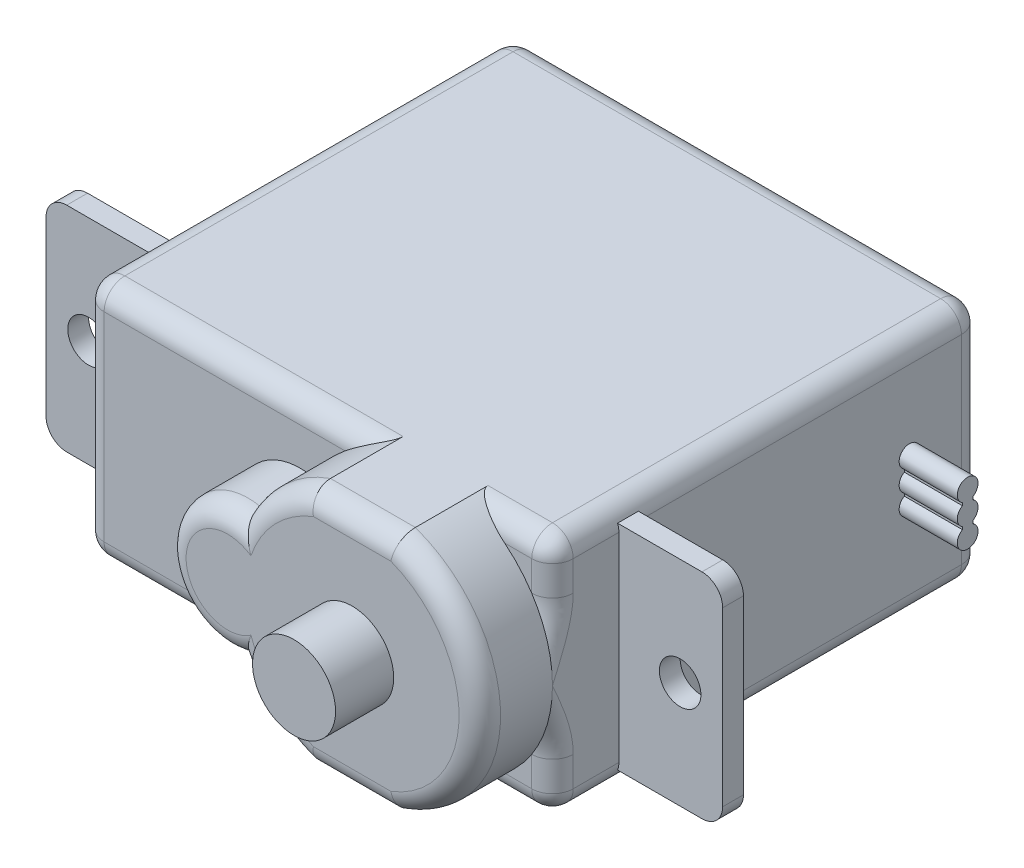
ISO-10303-21;
HEADER;
FILE_DESCRIPTION(('STEP AP214'),'2;1');
FILE_NAME('part.step','',(''),(''),'','','');
FILE_SCHEMA(('AUTOMOTIVE_DESIGN { 1 0 10303 214 1 1 1 1 }'));
ENDSEC;
DATA;
#1=APPLICATION_CONTEXT('core data for automotive mechanical design processes');
#2=APPLICATION_PROTOCOL_DEFINITION('international standard','automotive_design',2000,#1);
#3=PRODUCT_CONTEXT('',#1,'mechanical');
#4=PRODUCT('Part','Part','',(#3));
#5=PRODUCT_RELATED_PRODUCT_CATEGORY('part','',(#4));
#6=PRODUCT_DEFINITION_FORMATION('','',#4);
#7=PRODUCT_DEFINITION_CONTEXT('part definition',#1,'design');
#8=PRODUCT_DEFINITION('design','',#6,#7);
#9=PRODUCT_DEFINITION_SHAPE('','',#8);
#10=(LENGTH_UNIT() NAMED_UNIT(*) SI_UNIT(.MILLI.,.METRE.));
#11=(NAMED_UNIT(*) PLANE_ANGLE_UNIT() SI_UNIT($,.RADIAN.));
#12=(NAMED_UNIT(*) SI_UNIT($,.STERADIAN.) SOLID_ANGLE_UNIT());
#13=UNCERTAINTY_MEASURE_WITH_UNIT(LENGTH_MEASURE(1.E-05),#10,'distance_accuracy_value','');
#14=(GEOMETRIC_REPRESENTATION_CONTEXT(3) GLOBAL_UNCERTAINTY_ASSIGNED_CONTEXT((#13)) GLOBAL_UNIT_ASSIGNED_CONTEXT((#10,
#11,#12)) REPRESENTATION_CONTEXT('',''));
#15=CARTESIAN_POINT('',(0.,0.,0.));
#16=DIRECTION('',(0.,0.,1.));
#17=DIRECTION('',(1.,0.,0.));
#18=AXIS2_PLACEMENT_3D('',#15,#16,#17);
#19=CARTESIAN_POINT('',(-3.33066907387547E-13,11.6,-20.7000000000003));
#20=DIRECTION('',(1.00000000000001,0.,0.));
#21=DIRECTION('',(0.,0.,-1.00000000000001));
#22=AXIS2_PLACEMENT_3D('',#19,#20,#21);
#23=PLANE('',#22);
#24=DIRECTION('',(0.,1.,0.));
#25=VECTOR('',#24,1.);
#26=CARTESIAN_POINT('',(0.,0.649999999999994,-3.20000000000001));
#27=LINE('',#26,#25);
#28=CARTESIAN_POINT('',(0.,1.,-3.20000000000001));
#29=VERTEX_POINT('',#28);
#30=CARTESIAN_POINT('',(-3.33066907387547E-13,10.6,-3.19999999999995));
#31=VERTEX_POINT('',#30);
#32=EDGE_CURVE('E530',#29,#31,#27,.T.);
#33=ORIENTED_EDGE('',*,*,#32,.F.);
#34=DIRECTION('',(0.,0.,1.00000000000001));
#35=VECTOR('',#34,1.);
#36=CARTESIAN_POINT('',(0.,1.,-20.7000000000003));
#37=LINE('',#36,#35);
#38=CARTESIAN_POINT('',(-3.33066907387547E-13,1.,-0.999999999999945));
#39=VERTEX_POINT('',#38);
#40=EDGE_CURVE('E900',#29,#39,#37,.T.);
#41=ORIENTED_EDGE('',*,*,#40,.T.);
#42=DIRECTION('',(0.,-1.,0.));
#43=VECTOR('',#42,1.);
#44=CARTESIAN_POINT('',(-3.33066907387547E-13,11.6,-0.999999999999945));
#45=LINE('',#44,#43);
#46=CARTESIAN_POINT('',(-3.33066907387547E-13,10.6,-0.999999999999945));
#47=VERTEX_POINT('',#46);
#48=EDGE_CURVE('E898',#39,#47,#45,.F.);
#49=ORIENTED_EDGE('',*,*,#48,.T.);
#50=DIRECTION('',(0.,0.,1.00000000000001));
#51=VECTOR('',#50,1.);
#52=CARTESIAN_POINT('',(-3.33066907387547E-13,10.6,-20.7000000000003));
#53=LINE('',#52,#51);
#54=EDGE_CURVE('E891',#47,#31,#53,.F.);
#55=ORIENTED_EDGE('',*,*,#54,.T.);
#56=EDGE_LOOP('',(#33,#41,#49,#55));
#57=FACE_BOUND('',#56,.T.);
#58=ADVANCED_FACE('F83',(#57),#23,.F.);
#59=CARTESIAN_POINT('',(22.6000000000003,11.6,0.));
#60=DIRECTION('',(-1.00000000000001,0.,0.));
#61=DIRECTION('',(0.,0.,1.00000000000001));
#62=AXIS2_PLACEMENT_3D('',#59,#60,#61);
#63=PLANE('',#62);
#64=DIRECTION('',(0.,1.,0.));
#65=VECTOR('',#64,1.);
#66=CARTESIAN_POINT('',(22.6000000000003,4.8,-17.4500000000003));
#67=LINE('',#66,#65);
#68=CARTESIAN_POINT('',(22.6000000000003,5.23301270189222,-17.4500000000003));
#69=VERTEX_POINT('',#68);
#70=CARTESIAN_POINT('',(22.6000000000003,5.36698729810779,-17.4500000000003));
#71=VERTEX_POINT('',#70);
#72=EDGE_CURVE('E445',#69,#71,#67,.T.);
#73=ORIENTED_EDGE('',*,*,#72,.F.);
#74=CARTESIAN_POINT('',(22.6000000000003,4.8,-17.2000000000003));
#75=DIRECTION('',(1.00000000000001,0.,0.));
#76=DIRECTION('',(0.,0.,-1.00000000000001));
#77=AXIS2_PLACEMENT_3D('',#74,#75,#76);
#78=CIRCLE('',#77,0.499999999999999);
#79=CARTESIAN_POINT('',(22.6,5.23301270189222,-16.9500000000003));
#80=VERTEX_POINT('',#79);
#81=EDGE_CURVE('E456',#80,#69,#78,.T.);
#82=ORIENTED_EDGE('',*,*,#81,.F.);
#83=DIRECTION('',(0.,-1.,0.));
#84=VECTOR('',#83,1.);
#85=CARTESIAN_POINT('',(22.6,6.8,-16.9500000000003));
#86=LINE('',#85,#84);
#87=CARTESIAN_POINT('',(22.6,5.36698729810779,-16.9500000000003));
#88=VERTEX_POINT('',#87);
#89=EDGE_CURVE('E442',#88,#80,#86,.T.);
#90=ORIENTED_EDGE('',*,*,#89,.F.);
#91=CARTESIAN_POINT('',(22.6,5.8,-17.2000000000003));
#92=DIRECTION('',(1.00000000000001,0.,0.));
#93=DIRECTION('',(0.,0.,-1.00000000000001));
#94=AXIS2_PLACEMENT_3D('',#91,#92,#93);
#95=CIRCLE('',#94,0.499999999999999);
#96=CARTESIAN_POINT('',(22.6,6.23301270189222,-16.9500000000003));
#97=VERTEX_POINT('',#96);
#98=EDGE_CURVE('E450',#97,#88,#95,.T.);
#99=ORIENTED_EDGE('',*,*,#98,.F.);
#100=CARTESIAN_POINT('',(22.6,6.36698729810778,-16.9500000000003));
#101=VERTEX_POINT('',#100);
#102=EDGE_CURVE('E439',#101,#97,#86,.T.);
#103=ORIENTED_EDGE('',*,*,#102,.F.);
#104=CARTESIAN_POINT('',(22.6,6.8,-17.2000000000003));
#105=DIRECTION('',(1.00000000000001,0.,0.));
#106=DIRECTION('',(0.,0.,-1.00000000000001));
#107=AXIS2_PLACEMENT_3D('',#104,#105,#106);
#108=CIRCLE('',#107,0.499999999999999);
#109=CARTESIAN_POINT('',(22.6000000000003,6.36698729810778,-17.4500000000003));
#110=VERTEX_POINT('',#109);
#111=EDGE_CURVE('E411',#110,#101,#108,.T.);
#112=ORIENTED_EDGE('',*,*,#111,.F.);
#113=CARTESIAN_POINT('',(22.6000000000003,6.23301270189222,-17.4500000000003));
#114=VERTEX_POINT('',#113);
#115=EDGE_CURVE('E441',#114,#110,#67,.T.);
#116=ORIENTED_EDGE('',*,*,#115,.F.);
#117=EDGE_CURVE('E449',#71,#114,#95,.T.);
#118=ORIENTED_EDGE('',*,*,#117,.F.);
#119=EDGE_LOOP('',(#73,#82,#90,#99,#103,#112,#116,#118));
#120=FACE_BOUND('',#119,.T.);
#121=DIRECTION('',(0.,-1.,0.));
#122=VECTOR('',#121,1.);
#123=CARTESIAN_POINT('',(22.6000000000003,0.649999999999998,-4.19999999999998));
#124=LINE('',#123,#122);
#125=CARTESIAN_POINT('',(22.6000000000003,10.6,-4.19999999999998));
#126=VERTEX_POINT('',#125);
#127=CARTESIAN_POINT('',(22.6000000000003,1.,-4.19999999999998));
#128=VERTEX_POINT('',#127);
#129=EDGE_CURVE('E557',#126,#128,#124,.T.);
#130=ORIENTED_EDGE('',*,*,#129,.T.);
#131=DIRECTION('',(0.,0.,-1.00000000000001));
#132=VECTOR('',#131,1.);
#133=CARTESIAN_POINT('',(22.6000000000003,1.,0.));
#134=LINE('',#133,#132);
#135=CARTESIAN_POINT('',(22.6,1.,-19.7000000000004));
#136=VERTEX_POINT('',#135);
#137=EDGE_CURVE('E1195',#128,#136,#134,.T.);
#138=ORIENTED_EDGE('',*,*,#137,.T.);
#139=DIRECTION('',(0.,-1.,0.));
#140=VECTOR('',#139,1.);
#141=CARTESIAN_POINT('',(22.6,11.6,-19.7000000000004));
#142=LINE('',#141,#140);
#143=CARTESIAN_POINT('',(22.6,10.6,-19.7000000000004));
#144=VERTEX_POINT('',#143);
#145=EDGE_CURVE('E1196',#136,#144,#142,.F.);
#146=ORIENTED_EDGE('',*,*,#145,.T.);
#147=DIRECTION('',(0.,0.,-1.00000000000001));
#148=VECTOR('',#147,1.);
#149=CARTESIAN_POINT('',(22.6000000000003,10.6,0.));
#150=LINE('',#149,#148);
#151=EDGE_CURVE('E1200',#144,#126,#150,.F.);
#152=ORIENTED_EDGE('',*,*,#151,.T.);
#153=EDGE_LOOP('',(#130,#138,#146,#152));
#154=FACE_BOUND('',#153,.T.);
#155=ADVANCED_FACE('F859',(#120,#154),#63,.F.);
#156=DIRECTION('',(0.,-1.,0.));
#157=VECTOR('',#156,1.);
#158=CARTESIAN_POINT('',(22.6,11.6,-1.00000000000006));
#159=LINE('',#158,#157);
#160=CARTESIAN_POINT('',(22.6,2.43845273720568,-1.00000000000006));
#161=VERTEX_POINT('',#160);
#162=CARTESIAN_POINT('',(22.6,1.,-1.00000000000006));
#163=VERTEX_POINT('',#162);
#164=EDGE_CURVE('E1147',#161,#163,#159,.T.);
#165=ORIENTED_EDGE('',*,*,#164,.T.);
#166=DIRECTION('',(0.,0.,-1.00000000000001));
#167=VECTOR('',#166,1.);
#168=CARTESIAN_POINT('',(22.6000000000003,1.,0.));
#169=LINE('',#168,#167);
#170=CARTESIAN_POINT('',(22.6000000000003,1.,-3.19999999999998));
#171=VERTEX_POINT('',#170);
#172=EDGE_CURVE('E1204',#163,#171,#169,.T.);
#173=ORIENTED_EDGE('',*,*,#172,.T.);
#174=DIRECTION('',(0.,-1.,0.));
#175=VECTOR('',#174,1.);
#176=CARTESIAN_POINT('',(22.6000000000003,0.649999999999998,-3.19999999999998));
#177=LINE('',#176,#175);
#178=CARTESIAN_POINT('',(22.6,10.6,-3.19999999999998));
#179=VERTEX_POINT('',#178);
#180=EDGE_CURVE('E554',#179,#171,#177,.T.);
#181=ORIENTED_EDGE('',*,*,#180,.F.);
#182=DIRECTION('',(0.,0.,-1.00000000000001));
#183=VECTOR('',#182,1.);
#184=CARTESIAN_POINT('',(22.6000000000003,10.6,0.));
#185=LINE('',#184,#183);
#186=CARTESIAN_POINT('',(22.6,10.6,-1.00000000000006));
#187=VERTEX_POINT('',#186);
#188=EDGE_CURVE('E599',#179,#187,#185,.F.);
#189=ORIENTED_EDGE('',*,*,#188,.T.);
#190=DIRECTION('',(0.,-1.,0.));
#191=VECTOR('',#190,1.);
#192=CARTESIAN_POINT('',(22.6,11.6,-1.00000000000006));
#193=LINE('',#192,#191);
#194=CARTESIAN_POINT('',(22.6,9.16154726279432,-1.00000000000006));
#195=VERTEX_POINT('',#194);
#196=EDGE_CURVE('E1228',#187,#195,#193,.T.);
#197=ORIENTED_EDGE('',*,*,#196,.T.);
#198=CARTESIAN_POINT('',(21.2948460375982,9.58813501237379,0.));
#199=CARTESIAN_POINT('',(22.6,9.4833510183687,0.404881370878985));
#200=CARTESIAN_POINT('',(22.6000000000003,9.82673176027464,-0.921928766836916));
#201=CARTESIAN_POINT('',(21.3268384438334,9.54722333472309,0.));
#202=CARTESIAN_POINT('',(22.6000000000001,9.47132588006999,0.352776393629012));
#203=CARTESIAN_POINT('',(22.6000000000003,9.75663592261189,-0.94003363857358));
#204=CARTESIAN_POINT('',(21.3593269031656,9.5045984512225,0.));
#205=CARTESIAN_POINT('',(22.6000000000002,9.44962754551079,0.301965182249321));
#206=CARTESIAN_POINT('',(22.6000000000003,9.68573094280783,-0.954565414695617));
#207=CARTESIAN_POINT('',(21.4248074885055,9.41618616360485,0.));
#208=CARTESIAN_POINT('',(22.6000000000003,9.39149853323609,0.207151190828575));
#209=CARTESIAN_POINT('',(22.6000000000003,9.54306875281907,-0.977320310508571));
#210=CARTESIAN_POINT('',(21.457798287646,9.37040624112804,0.));
#211=CARTESIAN_POINT('',(22.6000000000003,9.35563840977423,0.162789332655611));
#212=CARTESIAN_POINT('',(22.6000000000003,9.47131387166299,-0.98555783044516));
#213=CARTESIAN_POINT('',(21.5562259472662,9.22957002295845,0.));
#214=CARTESIAN_POINT('',(22.6000000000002,9.2353592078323,0.0439874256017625));
#215=CARTESIAN_POINT('',(22.6000000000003,9.25715562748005,-1.00204352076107));
#216=CARTESIAN_POINT('',(21.6219036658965,9.13002916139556,0.));
#217=CARTESIAN_POINT('',(22.6,9.135086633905,-0.0236935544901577));
#218=CARTESIAN_POINT('',(22.6000000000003,9.11415187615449,-1.00245509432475));
#219=CARTESIAN_POINT('',(21.7482816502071,8.92483326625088,0.));
#220=CARTESIAN_POINT('',(22.6,8.91787378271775,-0.129288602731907));
#221=CARTESIAN_POINT('',(22.6000000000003,8.83578988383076,-0.987530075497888));
#222=CARTESIAN_POINT('',(21.8090719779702,8.81966905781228,0.));
#223=CARTESIAN_POINT('',(22.6000000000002,8.80260299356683,-0.16999300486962));
#224=CARTESIAN_POINT('',(22.6000000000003,8.7003821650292,-0.972915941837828));
#225=CARTESIAN_POINT('',(21.9270900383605,8.59991793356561,0.));
#226=CARTESIAN_POINT('',(22.6000000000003,8.56171475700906,-0.231342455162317));
#227=CARTESIAN_POINT('',(22.6000000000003,8.43125772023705,-0.932239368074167));
#228=CARTESIAN_POINT('',(21.984315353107,8.48532474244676,0.));
#229=CARTESIAN_POINT('',(22.6000000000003,8.43584361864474,-0.25304878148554));
#230=CARTESIAN_POINT('',(22.6000000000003,8.29754218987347,-0.906169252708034));
#231=CARTESIAN_POINT('',(22.0939352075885,8.24660622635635,0.));
#232=CARTESIAN_POINT('',(22.6000000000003,8.17796729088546,-0.280721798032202));
#233=CARTESIAN_POINT('',(22.6000000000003,8.03118420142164,-0.844859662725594));
#234=CARTESIAN_POINT('',(22.1462884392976,8.12241332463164,0.));
#235=CARTESIAN_POINT('',(22.6000000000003,8.04534288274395,-0.28723786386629));
#236=CARTESIAN_POINT('',(22.6000000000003,7.89855832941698,-0.80955002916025));
#237=CARTESIAN_POINT('',(22.2441528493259,7.866180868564,0.));
#238=CARTESIAN_POINT('',(22.6000000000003,7.77770607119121,-0.287915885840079));
#239=CARTESIAN_POINT('',(22.6000000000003,7.63536544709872,-0.731918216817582));
#240=CARTESIAN_POINT('',(22.2896620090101,7.73413901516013,0.));
#241=CARTESIAN_POINT('',(22.6000000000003,7.64202049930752,-0.282444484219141));
#242=CARTESIAN_POINT('',(22.6000000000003,7.50479905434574,-0.689593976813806));
#243=CARTESIAN_POINT('',(22.3735734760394,7.45978708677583,0.));
#244=CARTESIAN_POINT('',(22.6000000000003,7.36636476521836,-0.262014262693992));
#245=CARTESIAN_POINT('',(22.6000000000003,7.24207622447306,-0.598462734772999));
#246=CARTESIAN_POINT('',(22.411754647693,7.31729734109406,0.));
#247=CARTESIAN_POINT('',(22.6000000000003,7.22551177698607,-0.246971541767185));
#248=CARTESIAN_POINT('',(22.6000000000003,7.10996981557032,-0.549513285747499));
#249=CARTESIAN_POINT('',(22.4782472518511,7.02676068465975,0.));
#250=CARTESIAN_POINT('',(22.6000000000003,6.94394104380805,-0.210048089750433));
#251=CARTESIAN_POINT('',(22.6000000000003,6.84731068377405,-0.447630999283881));
#252=CARTESIAN_POINT('',(22.5065581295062,6.87871346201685,0.));
#253=CARTESIAN_POINT('',(22.6000000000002,6.80241372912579,-0.188182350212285));
#254=CARTESIAN_POINT('',(22.6000000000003,6.71675804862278,-0.394697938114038));
#255=CARTESIAN_POINT('',(22.5523194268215,6.5791607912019,0.));
#256=CARTESIAN_POINT('',(22.6000000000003,6.52030886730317,-0.140198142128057));
#257=CARTESIAN_POINT('',(22.6000000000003,6.45708005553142,-0.286402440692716));
#258=CARTESIAN_POINT('',(22.5697983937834,6.42766553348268,0.));
#259=CARTESIAN_POINT('',(22.6000000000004,6.37892248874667,-0.114005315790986));
#260=CARTESIAN_POINT('',(22.6000000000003,6.32795183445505,-0.23104680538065));
#261=CARTESIAN_POINT('',(22.5934324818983,6.12268623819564,0.));
#262=CARTESIAN_POINT('',(22.6000000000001,6.0969046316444,-0.0595879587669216));
#263=CARTESIAN_POINT('',(22.6000000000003,6.07025732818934,-0.119063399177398));
#264=CARTESIAN_POINT('',(22.5995879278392,5.96920225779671,0.));
#265=CARTESIAN_POINT('',(22.5999999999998,5.95546087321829,-0.0312196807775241));
#266=CARTESIAN_POINT('',(22.6000000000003,5.94169102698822,-0.0624356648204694));
#267=CARTESIAN_POINT('',(22.5999933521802,5.81045625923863,0.));
#268=CARTESIAN_POINT('',(22.6000000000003,5.80960617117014,-0.00192919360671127));
#269=CARTESIAN_POINT('',(22.6000000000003,5.80875605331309,-0.00385837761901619));
#270=CARTESIAN_POINT('',(22.6000000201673,5.80522813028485,0.));
#271=CARTESIAN_POINT('',(22.6000000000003,5.80480307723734,-0.000964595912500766));
#272=CARTESIAN_POINT('',(22.6000000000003,5.80437802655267,-0.00192918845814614));
#273=CARTESIAN_POINT('',(22.6000000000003,5.8000000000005,0.));
#274=CARTESIAN_POINT('',(22.6000000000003,5.8000000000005,0.));
#275=CARTESIAN_POINT('',(22.6000000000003,5.8,0.));
#276=(BOUNDED_SURFACE() B_SPLINE_SURFACE(3,2,((#198,#199,#200),(#201,#202,#203),(#204,#205,
#206),(#207,#208,#209),(#210,#211,#212),(#213,#214,#215),(#216,#217,#218),(#219,#220,#221),
(#222,#223,#224),(#225,#226,#227),(#228,#229,#230),(#231,#232,#233),(#234,#235,#236),(#237,#238,
#239),(#240,#241,#242),(#243,#244,#245),(#246,#247,#248),(#249,#250,#251),(#252,#253,#254),
(#255,#256,#257),(#258,#259,#260),(#261,#262,#263),(#264,#265,#266),(#267,#268,#269),(#270,#271,
#272),(#273,#274,#275)),.UNSPECIFIED.,.F.,.F.,.F.) B_SPLINE_SURFACE_WITH_KNOTS((4,2,2,2,2,2,2,2,
2,2,2,2,4),(3,3),(0.,0.216928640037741,0.43335948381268,0.861028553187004,1.26905440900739,
1.67735405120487,2.08884887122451,2.50046482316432,2.92302513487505,3.34560919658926,
3.76707475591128,4.18852822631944,4.20288092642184),(0.,1.),
.UNSPECIFIED.) GEOMETRIC_REPRESENTATION_ITEM() RATIONAL_B_SPLINE_SURFACE(((1.,0.589426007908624,
1.),(1.,0.602997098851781,1.),(1.,0.616306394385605,1.),(1.,0.64231761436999,1.),(1.,
0.655020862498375,1.),(1.,0.691890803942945,1.),(1.,0.715144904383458,1.),(1.,0.758010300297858,
1.),(1.,0.777739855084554,1.),(1.,0.81479335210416,1.),(1.,0.832115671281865,1.),(1.,
0.864425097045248,1.),(1.,0.879392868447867,1.),(1.,0.906787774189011,1.),(1.,0.919214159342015,
1.),(1.,0.941762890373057,1.),(1.,0.951815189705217,1.),(1.,0.969122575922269,1.),(1.,
0.976377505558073,1.),(1.,0.988025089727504,1.),(1.,0.992425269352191,1.),(1.,0.998361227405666,
1.),(1.,0.99989708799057,1.),(1.,0.999998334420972,1.),(1.,1.00000000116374,1.),(1.,1.,1.))) REPRESENTATION_ITEM('') SURFACE());
#277=CARTESIAN_POINT('',(22.6000000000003,9.82673176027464,-0.921928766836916));
#278=CARTESIAN_POINT('',(22.6000000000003,9.75663592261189,-0.94003363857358));
#279=CARTESIAN_POINT('',(22.6000000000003,9.68573094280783,-0.954565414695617));
#280=CARTESIAN_POINT('',(22.6000000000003,9.54306875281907,-0.977320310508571));
#281=CARTESIAN_POINT('',(22.6000000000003,9.47131387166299,-0.98555783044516));
#282=CARTESIAN_POINT('',(22.6000000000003,9.25715562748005,-1.00204352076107));
#283=CARTESIAN_POINT('',(22.6000000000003,9.11415187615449,-1.00245509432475));
#284=CARTESIAN_POINT('',(22.6000000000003,8.83578988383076,-0.987530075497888));
#285=CARTESIAN_POINT('',(22.6000000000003,8.7003821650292,-0.972915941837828));
#286=CARTESIAN_POINT('',(22.6000000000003,8.43125772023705,-0.932239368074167));
#287=CARTESIAN_POINT('',(22.6000000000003,8.29754218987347,-0.906169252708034));
#288=CARTESIAN_POINT('',(22.6000000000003,8.03118420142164,-0.844859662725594));
#289=CARTESIAN_POINT('',(22.6000000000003,7.89855832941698,-0.80955002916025));
#290=CARTESIAN_POINT('',(22.6000000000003,7.63536544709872,-0.731918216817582));
#291=CARTESIAN_POINT('',(22.6000000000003,7.50479905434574,-0.689593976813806));
#292=CARTESIAN_POINT('',(22.6000000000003,7.24207622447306,-0.598462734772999));
#293=CARTESIAN_POINT('',(22.6000000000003,7.10996981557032,-0.549513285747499));
#294=CARTESIAN_POINT('',(22.6000000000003,6.84731068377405,-0.447630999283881));
#295=CARTESIAN_POINT('',(22.6000000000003,6.71675804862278,-0.394697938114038));
#296=CARTESIAN_POINT('',(22.6000000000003,6.45708005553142,-0.286402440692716));
#297=CARTESIAN_POINT('',(22.6000000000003,6.32795183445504,-0.231046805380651));
#298=CARTESIAN_POINT('',(22.6000000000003,6.07025732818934,-0.119063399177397));
#299=CARTESIAN_POINT('',(22.6000000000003,5.94169102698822,-0.0624356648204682));
#300=CARTESIAN_POINT('',(22.6000000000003,5.80875605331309,-0.00385837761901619));
#301=CARTESIAN_POINT('',(22.6000000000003,5.80437802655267,-0.00192918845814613));
#302=CARTESIAN_POINT('',(22.6000000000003,5.8,0.));
#303=B_SPLINE_CURVE_WITH_KNOTS('',3,(#277,#278,#279,#280,#281,#282,#283,#284,#285,#286,#287,
#288,#289,#290,#291,#292,#293,#294,#295,#296,#297,#298,#299,#300,#301,#302),.UNSPECIFIED.,.F.,
.F.,(4,2,2,2,2,2,2,2,2,2,2,2,4),(0.,0.216928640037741,0.43335948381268,0.861028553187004,
1.26905440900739,1.67735405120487,2.08884887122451,2.50046482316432,2.92302513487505,
3.34560919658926,3.76707475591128,4.18852822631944,4.20288092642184),.UNSPECIFIED.);
#304=CARTESIAN_POINT('',(22.6000000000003,5.8,0.));
#305=VERTEX_POINT('',#304);
#306=EDGE_CURVE('E1212',#195,#305,#303,.T.);
#307=ORIENTED_EDGE('',*,*,#306,.T.);
#308=CARTESIAN_POINT('',(22.6000000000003,1.77326823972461,-0.921928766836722));
#309=CARTESIAN_POINT('',(22.6,2.11664898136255,0.404881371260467));
#310=CARTESIAN_POINT('',(21.2948460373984,2.01186498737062,0.));
#311=CARTESIAN_POINT('',(22.6000000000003,1.84336407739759,-0.940033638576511));
#312=CARTESIAN_POINT('',(22.6000000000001,2.12867411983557,0.352776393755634));
#313=CARTESIAN_POINT('',(21.3268384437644,2.05277666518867,0.));
#314=CARTESIAN_POINT('',(22.6000000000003,1.91426905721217,-0.954565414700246));
#315=CARTESIAN_POINT('',(22.6000000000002,2.15037245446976,0.301965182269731));
#316=CARTESIAN_POINT('',(21.3593269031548,2.09540154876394,0.));
#317=CARTESIAN_POINT('',(22.6000000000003,2.05693124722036,-0.977320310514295));
#318=CARTESIAN_POINT('',(22.6000000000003,2.20850146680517,0.207151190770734));
#319=CARTESIAN_POINT('',(21.4248074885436,2.18381383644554,0.));
#320=CARTESIAN_POINT('',(22.6000000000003,2.12868612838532,-0.985557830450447));
#321=CARTESIAN_POINT('',(22.6000000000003,2.24436159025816,0.162789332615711));
#322=CARTESIAN_POINT('',(21.4577982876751,2.22959375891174,0.));
#323=CARTESIAN_POINT('',(22.6000000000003,2.34284437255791,-1.00204352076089));
#324=CARTESIAN_POINT('',(22.6000000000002,2.3646407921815,0.0439874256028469));
#325=CARTESIAN_POINT('',(21.5562259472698,2.37042997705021,0.));
#326=CARTESIAN_POINT('',(22.6000000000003,2.48584812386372,-1.00245509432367));
#327=CARTESIAN_POINT('',(22.6,2.46491336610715,-0.0236935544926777));
#328=CARTESIAN_POINT('',(21.6219036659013,2.46997083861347,0.));
#329=CARTESIAN_POINT('',(22.6000000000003,2.76421011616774,-0.987530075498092));
#330=CARTESIAN_POINT('',(22.6,2.68212621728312,-0.129288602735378));
#331=CARTESIAN_POINT('',(21.7482816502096,2.67516673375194,0.));
#332=CARTESIAN_POINT('',(22.6000000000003,2.8996178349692,-0.972915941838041));
#333=CARTESIAN_POINT('',(22.6000000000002,2.79739700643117,-0.169993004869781));
#334=CARTESIAN_POINT('',(21.8090719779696,2.78033094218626,0.));
#335=CARTESIAN_POINT('',(22.6000000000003,3.16874227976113,-0.932239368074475));
#336=CARTESIAN_POINT('',(22.6000000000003,3.03828524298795,-0.231342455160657));
#337=CARTESIAN_POINT('',(21.9270900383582,3.00008206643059,0.));
#338=CARTESIAN_POINT('',(22.6000000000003,3.3024578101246,-0.906169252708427));
#339=CARTESIAN_POINT('',(22.6000000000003,3.16415638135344,-0.253048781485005));
#340=CARTESIAN_POINT('',(21.984315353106,3.11467525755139,0.));
#341=CARTESIAN_POINT('',(22.6000000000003,3.56881579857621,-0.844859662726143));
#342=CARTESIAN_POINT('',(22.6000000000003,3.42203270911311,-0.280721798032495));
#343=CARTESIAN_POINT('',(22.0939352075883,3.35339377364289,0.));
#344=CARTESIAN_POINT('',(22.6000000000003,3.70144167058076,-0.809550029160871));
#345=CARTESIAN_POINT('',(22.6000000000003,3.55465711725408,-0.287237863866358));
#346=CARTESIAN_POINT('',(22.1462884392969,3.47758667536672,0.));
#347=CARTESIAN_POINT('',(22.6000000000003,3.9646345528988,-0.731918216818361));
#348=CARTESIAN_POINT('',(22.6000000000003,3.82229392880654,-0.2879158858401));
#349=CARTESIAN_POINT('',(22.2441528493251,3.73381913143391,0.));
#350=CARTESIAN_POINT('',(22.6000000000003,4.09520094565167,-0.689593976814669));
#351=CARTESIAN_POINT('',(22.6000000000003,3.95797950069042,-0.282444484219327));
#352=CARTESIAN_POINT('',(22.2896620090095,3.86586098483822,0.));
#353=CARTESIAN_POINT('',(22.6000000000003,4.35792377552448,-0.598462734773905));
#354=CARTESIAN_POINT('',(22.6000000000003,4.23363523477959,-0.26201426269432));
#355=CARTESIAN_POINT('',(22.3735734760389,4.14021291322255,0.));
#356=CARTESIAN_POINT('',(22.6000000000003,4.49003018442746,-0.549513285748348));
#357=CARTESIAN_POINT('',(22.6000000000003,4.37448822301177,-0.246971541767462));
#358=CARTESIAN_POINT('',(22.4117546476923,4.28270265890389,0.));
#359=CARTESIAN_POINT('',(22.6000000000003,4.75268931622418,-0.447630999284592));
#360=CARTESIAN_POINT('',(22.6000000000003,4.65605895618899,-0.210048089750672));
#361=CARTESIAN_POINT('',(22.4782472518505,4.57323931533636,0.));
#362=CARTESIAN_POINT('',(22.6000000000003,4.88324195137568,-0.394697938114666));
#363=CARTESIAN_POINT('',(22.6000000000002,4.79758627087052,-0.188182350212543));
#364=CARTESIAN_POINT('',(22.5065581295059,4.72128653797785,0.));
#365=CARTESIAN_POINT('',(22.6000000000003,5.14291994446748,-0.286402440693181));
#366=CARTESIAN_POINT('',(22.6000000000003,5.07969113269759,-0.140198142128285));
#367=CARTESIAN_POINT('',(22.5523194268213,5.02083920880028,0.));
#368=CARTESIAN_POINT('',(22.6000000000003,5.27204816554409,-0.231046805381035));
#369=CARTESIAN_POINT('',(22.6000000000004,5.22107751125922,-0.11400531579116));
#370=CARTESIAN_POINT('',(22.569798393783,5.17233446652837,0.));
#371=CARTESIAN_POINT('',(22.6000000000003,5.52974267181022,-0.119063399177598));
#372=CARTESIAN_POINT('',(22.6000000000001,5.50309536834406,-0.0595879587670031));
#373=CARTESIAN_POINT('',(22.5934324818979,5.47731376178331,0.));
#374=CARTESIAN_POINT('',(22.6000000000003,5.65830897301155,-0.0624356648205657));
#375=CARTESIAN_POINT('',(22.5999999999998,5.64453912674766,-0.0312196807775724));
#376=CARTESIAN_POINT('',(22.599587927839,5.63079774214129,0.));
#377=CARTESIAN_POINT('',(22.6000000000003,5.79124394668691,-0.00385837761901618));
#378=CARTESIAN_POINT('',(22.6000000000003,5.79039382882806,-0.00192919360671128));
#379=CARTESIAN_POINT('',(22.5999933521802,5.78954374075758,0.));
#380=CARTESIAN_POINT('',(22.6000000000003,5.79562197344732,-0.00192918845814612));
#381=CARTESIAN_POINT('',(22.6000000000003,5.79519692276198,-0.000964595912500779));
#382=CARTESIAN_POINT('',(22.6000000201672,5.79477186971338,0.));
#383=CARTESIAN_POINT('',(22.6000000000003,5.8,0.));
#384=CARTESIAN_POINT('',(22.6000000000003,5.8,0.));
#385=CARTESIAN_POINT('',(22.6000000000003,5.79999999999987,0.));
#386=(BOUNDED_SURFACE() B_SPLINE_SURFACE(3,2,((#308,#309,#310),(#311,#312,#313),(#314,#315,
#316),(#317,#318,#319),(#320,#321,#322),(#323,#324,#325),(#326,#327,#328),(#329,#330,#331),
(#332,#333,#334),(#335,#336,#337),(#338,#339,#340),(#341,#342,#343),(#344,#345,#346),(#347,#348,
#349),(#350,#351,#352),(#353,#354,#355),(#356,#357,#358),(#359,#360,#361),(#362,#363,#364),
(#365,#366,#367),(#368,#369,#370),(#371,#372,#373),(#374,#375,#376),(#377,#378,#379),(#380,#381,
#382),(#383,#384,#385)),.UNSPECIFIED.,.F.,.F.,.F.) B_SPLINE_SURFACE_WITH_KNOTS((4,2,2,2,2,2,2,2,
2,2,2,2,4),(3,3),(0.,0.2169286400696,0.433359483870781,0.861028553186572,1.26905440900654,
1.67735405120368,2.08884887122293,2.50046482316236,2.9230251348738,3.34560919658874,
3.76707475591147,4.18852822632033,4.20288092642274),(0.,1.),
.UNSPECIFIED.) GEOMETRIC_REPRESENTATION_ITEM() RATIONAL_B_SPLINE_SURFACE(((1.,0.589426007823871,
1.),(1.,0.602997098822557,1.),(1.,0.616306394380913,1.),(1.,0.642317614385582,1.),(1.,
0.6550208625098,1.),(1.,0.691890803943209,1.),(1.,0.715144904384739,1.),(1.,0.758010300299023,
1.),(1.,0.777739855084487,1.),(1.,0.814793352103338,1.),(1.,0.832115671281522,1.),(1.,
0.864425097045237,1.),(1.,0.879392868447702,1.),(1.,0.906787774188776,1.),(1.,0.919214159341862,
1.),(1.,0.941762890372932,1.),(1.,0.951815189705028,1.),(1.,0.969122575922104,1.),(1.,
0.976377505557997,1.),(1.,0.988025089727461,1.),(1.,0.992425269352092,1.),(1.,0.998361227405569,
1.),(1.,0.999897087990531,1.),(1.,0.99999833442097,1.),(1.,1.00000000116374,1.),(1.,1.,1.))) REPRESENTATION_ITEM('') SURFACE());
#387=CARTESIAN_POINT('',(22.6000000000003,1.77326823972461,-0.921928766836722));
#388=CARTESIAN_POINT('',(22.6000000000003,1.84336407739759,-0.940033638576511));
#389=CARTESIAN_POINT('',(22.6000000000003,1.91426905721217,-0.954565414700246));
#390=CARTESIAN_POINT('',(22.6000000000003,2.05693124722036,-0.977320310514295));
#391=CARTESIAN_POINT('',(22.6000000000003,2.12868612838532,-0.985557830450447));
#392=CARTESIAN_POINT('',(22.6000000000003,2.34284437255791,-1.00204352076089));
#393=CARTESIAN_POINT('',(22.6000000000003,2.48584812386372,-1.00245509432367));
#394=CARTESIAN_POINT('',(22.6000000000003,2.76421011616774,-0.987530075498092));
#395=CARTESIAN_POINT('',(22.6000000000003,2.8996178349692,-0.972915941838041));
#396=CARTESIAN_POINT('',(22.6000000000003,3.16874227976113,-0.932239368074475));
#397=CARTESIAN_POINT('',(22.6000000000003,3.3024578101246,-0.906169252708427));
#398=CARTESIAN_POINT('',(22.6000000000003,3.56881579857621,-0.844859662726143));
#399=CARTESIAN_POINT('',(22.6000000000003,3.70144167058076,-0.809550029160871));
#400=CARTESIAN_POINT('',(22.6000000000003,3.9646345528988,-0.731918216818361));
#401=CARTESIAN_POINT('',(22.6000000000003,4.09520094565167,-0.689593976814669));
#402=CARTESIAN_POINT('',(22.6000000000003,4.35792377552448,-0.598462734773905));
#403=CARTESIAN_POINT('',(22.6000000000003,4.49003018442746,-0.549513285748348));
#404=CARTESIAN_POINT('',(22.6000000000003,4.75268931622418,-0.447630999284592));
#405=CARTESIAN_POINT('',(22.6000000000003,4.88324195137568,-0.394697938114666));
#406=CARTESIAN_POINT('',(22.6000000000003,5.14291994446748,-0.286402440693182));
#407=CARTESIAN_POINT('',(22.6000000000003,5.27204816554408,-0.231046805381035));
#408=CARTESIAN_POINT('',(22.6000000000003,5.52974267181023,-0.119063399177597));
#409=CARTESIAN_POINT('',(22.6000000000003,5.65830897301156,-0.0624356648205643));
#410=CARTESIAN_POINT('',(22.6000000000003,5.79124394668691,-0.00385837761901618));
#411=CARTESIAN_POINT('',(22.6000000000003,5.79562197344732,-0.00192918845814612));
#412=CARTESIAN_POINT('',(22.6000000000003,5.8,0.));
#413=B_SPLINE_CURVE_WITH_KNOTS('',3,(#387,#388,#389,#390,#391,#392,#393,#394,#395,#396,#397,
#398,#399,#400,#401,#402,#403,#404,#405,#406,#407,#408,#409,#410,#411,#412),.UNSPECIFIED.,.F.,
.F.,(4,2,2,2,2,2,2,2,2,2,2,2,4),(0.,0.2169286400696,0.433359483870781,0.861028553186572,
1.26905440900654,1.67735405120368,2.08884887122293,2.50046482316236,2.9230251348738,
3.34560919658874,3.76707475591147,4.18852822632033,4.20288092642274),.UNSPECIFIED.);
#414=EDGE_CURVE('E1207',#305,#161,#413,.F.);
#415=ORIENTED_EDGE('',*,*,#414,.T.);
#416=EDGE_LOOP('',(#165,#173,#181,#189,#197,#307,#415));
#417=FACE_BOUND('',#416,.T.);
#418=ADVANCED_FACE('F767',(#417),#63,.F.);
#419=CARTESIAN_POINT('',(16.4500000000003,5.8,3.50000000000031));
#420=DIRECTION('',(0.,0.,1.00000000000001));
#421=DIRECTION('',(1.00000000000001,0.,0.));
#422=AXIS2_PLACEMENT_3D('',#419,#420,#421);
#423=PLANE('',#422);
#424=DIRECTION('',(1.00000000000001,0.,0.));
#425=VECTOR('',#424,1.);
#426=CARTESIAN_POINT('',(18.495116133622,1.,3.5));
#427=LINE('',#426,#425);
#428=CARTESIAN_POINT('',(14.5838542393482,0.999999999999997,3.5));
#429=VERTEX_POINT('',#428);
#430=CARTESIAN_POINT('',(18.3161457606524,1.,3.5));
#431=VERTEX_POINT('',#430);
#432=EDGE_CURVE('E1089',#429,#431,#427,.T.);
#433=ORIENTED_EDGE('',*,*,#432,.T.);
#434=CARTESIAN_POINT('',(16.4500000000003,5.8,3.50000000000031));
#435=DIRECTION('',(0.,0.,1.00000000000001));
#436=DIRECTION('',(1.00000000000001,0.,0.));
#437=AXIS2_PLACEMENT_3D('',#434,#435,#436);
#438=CIRCLE('',#437,5.15);
#439=CARTESIAN_POINT('',(18.3161457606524,10.6,3.5));
#440=VERTEX_POINT('',#439);
#441=EDGE_CURVE('E1083',#431,#440,#438,.T.);
#442=ORIENTED_EDGE('',*,*,#441,.T.);
#443=DIRECTION('',(-1.00000000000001,0.,0.));
#444=VECTOR('',#443,1.);
#445=CARTESIAN_POINT('',(16.4500000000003,10.6,3.5));
#446=LINE('',#445,#444);
#447=CARTESIAN_POINT('',(14.5838542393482,10.6,3.5));
#448=VERTEX_POINT('',#447);
#449=EDGE_CURVE('E1072',#440,#448,#446,.T.);
#450=ORIENTED_EDGE('',*,*,#449,.T.);
#451=CARTESIAN_POINT('',(16.4500000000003,5.8,3.50000000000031));
#452=DIRECTION('',(0.,0.,1.00000000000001));
#453=DIRECTION('',(1.00000000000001,0.,0.));
#454=AXIS2_PLACEMENT_3D('',#451,#452,#453);
#455=CIRCLE('',#454,5.15);
#456=CARTESIAN_POINT('',(11.5731250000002,7.45486864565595,3.50000000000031));
#457=VERTEX_POINT('',#456);
#458=EDGE_CURVE('E1113',#448,#457,#455,.T.);
#459=ORIENTED_EDGE('',*,*,#458,.T.);
#460=CARTESIAN_POINT('',(10.4500000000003,5.8,3.5));
#461=DIRECTION('',(0.,0.,1.00000000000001));
#462=DIRECTION('',(1.00000000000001,0.,0.));
#463=AXIS2_PLACEMENT_3D('',#460,#461,#462);
#464=CIRCLE('',#463,2.);
#465=CARTESIAN_POINT('',(11.5731250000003,4.14513135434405,3.50000000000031));
#466=VERTEX_POINT('',#465);
#467=EDGE_CURVE('E1109',#457,#466,#464,.T.);
#468=ORIENTED_EDGE('',*,*,#467,.T.);
#469=CARTESIAN_POINT('',(16.4500000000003,5.8,3.50000000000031));
#470=DIRECTION('',(0.,0.,1.00000000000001));
#471=DIRECTION('',(1.00000000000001,0.,0.));
#472=AXIS2_PLACEMENT_3D('',#469,#470,#471);
#473=CIRCLE('',#472,5.15);
#474=EDGE_CURVE('E1116',#466,#429,#473,.T.);
#475=ORIENTED_EDGE('',*,*,#474,.T.);
#476=EDGE_LOOP('',(#433,#442,#450,#459,#468,#475));
#477=FACE_BOUND('',#476,.T.);
#478=CARTESIAN_POINT('',(16.4500000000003,5.8,3.50000000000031));
#479=DIRECTION('',(0.,0.,1.00000000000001));
#480=DIRECTION('',(1.00000000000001,0.,0.));
#481=AXIS2_PLACEMENT_3D('',#478,#479,#480);
#482=CIRCLE('',#481,2.);
#483=CARTESIAN_POINT('',(18.4500000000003,5.8,3.50000000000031));
#484=VERTEX_POINT('',#483);
#485=EDGE_CURVE('E414',#484,#484,#482,.T.);
#486=ORIENTED_EDGE('',*,*,#485,.F.);
#487=EDGE_LOOP('',(#486));
#488=FACE_BOUND('',#487,.T.);
#489=ADVANCED_FACE('F1124',(#477,#488),#423,.T.);
#490=CARTESIAN_POINT('',(0.,11.6,0.));
#491=DIRECTION('',(0.,0.,-1.00000000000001));
#492=DIRECTION('',(-1.00000000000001,0.,0.));
#493=AXIS2_PLACEMENT_3D('',#490,#491,#492);
#494=PLANE('',#493);
#495=CARTESIAN_POINT('',(16.4500000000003,5.8,0.));
#496=DIRECTION('',(0.,0.,1.00000000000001));
#497=DIRECTION('',(1.00000000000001,0.,0.));
#498=AXIS2_PLACEMENT_3D('',#495,#496,#497);
#499=CIRCLE('',#498,6.15);
#500=CARTESIAN_POINT('',(20.2948016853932,1.,0.));
#501=VERTEX_POINT('',#500);
#502=CARTESIAN_POINT('',(21.6000000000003,2.43845273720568,0.));
#503=VERTEX_POINT('',#502);
#504=EDGE_CURVE('E495',#501,#503,#499,.T.);
#505=ORIENTED_EDGE('',*,*,#504,.F.);
#506=DIRECTION('',(1.00000000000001,0.,0.));
#507=VECTOR('',#506,1.);
#508=CARTESIAN_POINT('',(0.,1.,0.));
#509=LINE('',#508,#507);
#510=CARTESIAN_POINT('',(21.6000000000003,1.,0.));
#511=VERTEX_POINT('',#510);
#512=EDGE_CURVE('E919',#501,#511,#509,.T.);
#513=ORIENTED_EDGE('',*,*,#512,.T.);
#514=DIRECTION('',(0.,-1.,0.));
#515=VECTOR('',#514,1.);
#516=CARTESIAN_POINT('',(21.6000000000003,11.6,0.));
#517=LINE('',#516,#515);
#518=EDGE_CURVE('E917',#511,#503,#517,.F.);
#519=ORIENTED_EDGE('',*,*,#518,.T.);
#520=EDGE_LOOP('',(#505,#513,#519));
#521=FACE_BOUND('',#520,.T.);
#522=ADVANCED_FACE('F631',(#521),#494,.F.);
#523=CARTESIAN_POINT('',(21.6000000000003,9.16154726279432,0.));
#524=VERTEX_POINT('',#523);
#525=CARTESIAN_POINT('',(20.2948016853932,10.6,0.));
#526=VERTEX_POINT('',#525);
#527=EDGE_CURVE('E491',#524,#526,#499,.T.);
#528=ORIENTED_EDGE('',*,*,#527,.F.);
#529=DIRECTION('',(0.,-1.,0.));
#530=VECTOR('',#529,1.);
#531=CARTESIAN_POINT('',(21.6000000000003,11.6,0.));
#532=LINE('',#531,#530);
#533=CARTESIAN_POINT('',(21.6000000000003,10.6,0.));
#534=VERTEX_POINT('',#533);
#535=EDGE_CURVE('E1114',#524,#534,#532,.F.);
#536=ORIENTED_EDGE('',*,*,#535,.T.);
#537=DIRECTION('',(1.00000000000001,0.,0.));
#538=VECTOR('',#537,1.);
#539=CARTESIAN_POINT('',(18.495116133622,10.6,0.));
#540=LINE('',#539,#538);
#541=EDGE_CURVE('E1118',#534,#526,#540,.F.);
#542=ORIENTED_EDGE('',*,*,#541,.T.);
#543=EDGE_LOOP('',(#528,#536,#542));
#544=FACE_BOUND('',#543,.T.);
#545=ADVANCED_FACE('F878',(#544),#494,.F.);
#546=DIRECTION('',(0.,-1.,0.));
#547=VECTOR('',#546,1.);
#548=CARTESIAN_POINT('',(1.,11.6,0.));
#549=LINE('',#548,#547);
#550=CARTESIAN_POINT('',(1.,10.6,0.));
#551=VERTEX_POINT('',#550);
#552=CARTESIAN_POINT('',(1.,1.,0.));
#553=VERTEX_POINT('',#552);
#554=EDGE_CURVE('E913',#551,#553,#549,.T.);
#555=ORIENTED_EDGE('',*,*,#554,.T.);
#556=DIRECTION('',(1.00000000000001,0.,0.));
#557=VECTOR('',#556,1.);
#558=CARTESIAN_POINT('',(0.,1.,0.));
#559=LINE('',#558,#557);
#560=CARTESIAN_POINT('',(12.6051983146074,1.,0.));
#561=VERTEX_POINT('',#560);
#562=EDGE_CURVE('E915',#553,#561,#559,.T.);
#563=ORIENTED_EDGE('',*,*,#562,.T.);
#564=CARTESIAN_POINT('',(16.4500000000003,5.8,0.));
#565=DIRECTION('',(0.,0.,1.00000000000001));
#566=DIRECTION('',(1.00000000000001,0.,0.));
#567=AXIS2_PLACEMENT_3D('',#564,#565,#566);
#568=CIRCLE('',#567,6.15);
#569=CARTESIAN_POINT('',(11.0481250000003,2.8602301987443,0.));
#570=VERTEX_POINT('',#569);
#571=EDGE_CURVE('E515',#570,#561,#568,.T.);
#572=ORIENTED_EDGE('',*,*,#571,.F.);
#573=CARTESIAN_POINT('',(10.4500000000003,5.8,0.));
#574=DIRECTION('',(0.,0.,1.00000000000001));
#575=DIRECTION('',(1.00000000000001,0.,0.));
#576=AXIS2_PLACEMENT_3D('',#573,#574,#575);
#577=CIRCLE('',#576,3.);
#578=CARTESIAN_POINT('',(11.0481250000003,8.73976980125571,0.));
#579=VERTEX_POINT('',#578);
#580=EDGE_CURVE('E480',#579,#570,#577,.T.);
#581=ORIENTED_EDGE('',*,*,#580,.F.);
#582=CARTESIAN_POINT('',(16.4500000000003,5.8,0.));
#583=DIRECTION('',(0.,0.,1.00000000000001));
#584=DIRECTION('',(1.00000000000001,0.,0.));
#585=AXIS2_PLACEMENT_3D('',#582,#583,#584);
#586=CIRCLE('',#585,6.15);
#587=CARTESIAN_POINT('',(12.6051983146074,10.6,0.));
#588=VERTEX_POINT('',#587);
#589=EDGE_CURVE('E498',#588,#579,#586,.T.);
#590=ORIENTED_EDGE('',*,*,#589,.F.);
#591=DIRECTION('',(1.00000000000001,0.,0.));
#592=VECTOR('',#591,1.);
#593=CARTESIAN_POINT('',(0.,10.6,0.));
#594=LINE('',#593,#592);
#595=EDGE_CURVE('E911',#588,#551,#594,.F.);
#596=ORIENTED_EDGE('',*,*,#595,.T.);
#597=EDGE_LOOP('',(#555,#563,#572,#581,#590,#596));
#598=FACE_BOUND('',#597,.T.);
#599=ADVANCED_FACE('F870',(#598),#494,.F.);
#600=DIRECTION('',(0.,-1.,0.));
#601=VECTOR('',#600,1.);
#602=CARTESIAN_POINT('',(-3.33066907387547E-13,11.6,-19.7000000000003));
#603=LINE('',#602,#601);
#604=CARTESIAN_POINT('',(-3.33066907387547E-13,10.6,-19.7000000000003));
#605=VERTEX_POINT('',#604);
#606=CARTESIAN_POINT('',(-3.33066907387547E-13,1.,-19.7000000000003));
#607=VERTEX_POINT('',#606);
#608=EDGE_CURVE('E882',#605,#607,#603,.T.);
#609=ORIENTED_EDGE('',*,*,#608,.T.);
#610=DIRECTION('',(0.,0.,1.00000000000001));
#611=VECTOR('',#610,1.);
#612=CARTESIAN_POINT('',(0.,1.,-20.7000000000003));
#613=LINE('',#612,#611);
#614=CARTESIAN_POINT('',(0.,1.,-4.19999999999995));
#615=VERTEX_POINT('',#614);
#616=EDGE_CURVE('E884',#607,#615,#613,.T.);
#617=ORIENTED_EDGE('',*,*,#616,.T.);
#618=DIRECTION('',(0.,1.,0.));
#619=VECTOR('',#618,1.);
#620=CARTESIAN_POINT('',(0.,0.649999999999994,-4.19999999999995));
#621=LINE('',#620,#619);
#622=CARTESIAN_POINT('',(0.,10.6,-4.19999999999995));
#623=VERTEX_POINT('',#622);
#624=EDGE_CURVE('E533',#615,#623,#621,.T.);
#625=ORIENTED_EDGE('',*,*,#624,.T.);
#626=DIRECTION('',(0.,0.,1.00000000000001));
#627=VECTOR('',#626,1.);
#628=CARTESIAN_POINT('',(-3.33066907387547E-13,10.6,-20.7000000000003));
#629=LINE('',#628,#627);
#630=EDGE_CURVE('E887',#623,#605,#629,.F.);
#631=ORIENTED_EDGE('',*,*,#630,.T.);
#632=EDGE_LOOP('',(#609,#617,#625,#631));
#633=FACE_BOUND('',#632,.T.);
#634=ADVANCED_FACE('F861',(#633),#23,.F.);
#635=CARTESIAN_POINT('',(22.6,11.6,-20.7000000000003));
#636=DIRECTION('',(0.,0.,1.00000000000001));
#637=DIRECTION('',(1.00000000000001,0.,0.));
#638=AXIS2_PLACEMENT_3D('',#635,#636,#637);
#639=PLANE('',#638);
#640=DIRECTION('',(0.,-1.,0.));
#641=VECTOR('',#640,1.);
#642=CARTESIAN_POINT('',(21.6,11.6,-20.7000000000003));
#643=LINE('',#642,#641);
#644=CARTESIAN_POINT('',(21.6,10.6,-20.7000000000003));
#645=VERTEX_POINT('',#644);
#646=CARTESIAN_POINT('',(21.6000000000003,0.999999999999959,-20.7000000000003));
#647=VERTEX_POINT('',#646);
#648=EDGE_CURVE('E904',#645,#647,#643,.T.);
#649=ORIENTED_EDGE('',*,*,#648,.T.);
#650=DIRECTION('',(-1.00000000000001,0.,0.));
#651=VECTOR('',#650,1.);
#652=CARTESIAN_POINT('',(22.6000000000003,1.,-20.7000000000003));
#653=LINE('',#652,#651);
#654=CARTESIAN_POINT('',(0.999999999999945,1.,-20.7000000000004));
#655=VERTEX_POINT('',#654);
#656=EDGE_CURVE('E909',#647,#655,#653,.T.);
#657=ORIENTED_EDGE('',*,*,#656,.T.);
#658=DIRECTION('',(0.,-1.,0.));
#659=VECTOR('',#658,1.);
#660=CARTESIAN_POINT('',(0.999999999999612,11.6,-20.7000000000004));
#661=LINE('',#660,#659);
#662=CARTESIAN_POINT('',(0.999999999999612,10.6,-20.7000000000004));
#663=VERTEX_POINT('',#662);
#664=EDGE_CURVE('E906',#655,#663,#661,.F.);
#665=ORIENTED_EDGE('',*,*,#664,.T.);
#666=DIRECTION('',(-1.00000000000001,0.,0.));
#667=VECTOR('',#666,1.);
#668=CARTESIAN_POINT('',(22.6,10.6,-20.7000000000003));
#669=LINE('',#668,#667);
#670=EDGE_CURVE('E902',#663,#645,#669,.F.);
#671=ORIENTED_EDGE('',*,*,#670,.T.);
#672=EDGE_LOOP('',(#649,#657,#665,#671));
#673=FACE_BOUND('',#672,.T.);
#674=ADVANCED_FACE('F869',(#673),#639,.F.);
#675=CARTESIAN_POINT('',(0.,11.6,0.));
#676=DIRECTION('',(0.,1.,0.));
#677=DIRECTION('',(0.,0.,1.00000000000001));
#678=AXIS2_PLACEMENT_3D('',#675,#676,#677);
#679=PLANE('',#678);
#680=DIRECTION('',(0.,0.,-1.00000000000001));
#681=VECTOR('',#680,1.);
#682=CARTESIAN_POINT('',(14.4048838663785,11.6,3.50000000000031));
#683=LINE('',#682,#681);
#684=CARTESIAN_POINT('',(14.4048838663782,11.6,2.50000000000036));
#685=VERTEX_POINT('',#684);
#686=CARTESIAN_POINT('',(14.4048838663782,11.6,-0.999999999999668));
#687=VERTEX_POINT('',#686);
#688=EDGE_CURVE('E506',#685,#687,#683,.T.);
#689=ORIENTED_EDGE('',*,*,#688,.F.);
#690=DIRECTION('',(-1.00000000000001,0.,0.));
#691=VECTOR('',#690,1.);
#692=CARTESIAN_POINT('',(-3.33066907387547E-13,11.6,2.50000000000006));
#693=LINE('',#692,#691);
#694=CARTESIAN_POINT('',(18.4951161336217,11.6,2.49999999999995));
#695=VERTEX_POINT('',#694);
#696=EDGE_CURVE('E1004',#685,#695,#693,.F.);
#697=ORIENTED_EDGE('',*,*,#696,.T.);
#698=DIRECTION('',(0.,0.,-1.00000000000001));
#699=VECTOR('',#698,1.);
#700=CARTESIAN_POINT('',(18.495116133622,11.6,3.5));
#701=LINE('',#700,#699);
#702=CARTESIAN_POINT('',(18.4951161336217,11.6,-1.00000000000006));
#703=VERTEX_POINT('',#702);
#704=EDGE_CURVE('E502',#695,#703,#701,.T.);
#705=ORIENTED_EDGE('',*,*,#704,.T.);
#706=DIRECTION('',(1.00000000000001,0.,0.));
#707=VECTOR('',#706,1.);
#708=CARTESIAN_POINT('',(22.6,11.6,-1.00000000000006));
#709=LINE('',#708,#707);
#710=CARTESIAN_POINT('',(21.6,11.6,-1.));
#711=VERTEX_POINT('',#710);
#712=EDGE_CURVE('E1056',#703,#711,#709,.T.);
#713=ORIENTED_EDGE('',*,*,#712,.T.);
#714=DIRECTION('',(0.,0.,-1.00000000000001));
#715=VECTOR('',#714,1.);
#716=CARTESIAN_POINT('',(21.6,11.6,-20.7000000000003));
#717=LINE('',#716,#715);
#718=CARTESIAN_POINT('',(21.6,11.6,-19.7000000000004));
#719=VERTEX_POINT('',#718);
#720=EDGE_CURVE('E1051',#711,#719,#717,.T.);
#721=ORIENTED_EDGE('',*,*,#720,.T.);
#722=DIRECTION('',(-1.00000000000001,0.,0.));
#723=VECTOR('',#722,1.);
#724=CARTESIAN_POINT('',(-3.33066907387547E-13,11.6,-19.7000000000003));
#725=LINE('',#724,#723);
#726=CARTESIAN_POINT('',(0.999999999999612,11.6,-19.7000000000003));
#727=VERTEX_POINT('',#726);
#728=EDGE_CURVE('E1049',#719,#727,#725,.T.);
#729=ORIENTED_EDGE('',*,*,#728,.T.);
#730=DIRECTION('',(0.,0.,1.00000000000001));
#731=VECTOR('',#730,1.);
#732=CARTESIAN_POINT('',(1.,11.6,0.));
#733=LINE('',#732,#731);
#734=CARTESIAN_POINT('',(0.999999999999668,11.6,-1.));
#735=VERTEX_POINT('',#734);
#736=EDGE_CURVE('E1047',#727,#735,#733,.T.);
#737=ORIENTED_EDGE('',*,*,#736,.T.);
#738=DIRECTION('',(1.00000000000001,0.,0.));
#739=VECTOR('',#738,1.);
#740=CARTESIAN_POINT('',(14.4048838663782,11.6,-0.999999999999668));
#741=LINE('',#740,#739);
#742=EDGE_CURVE('E1053',#735,#687,#741,.T.);
#743=ORIENTED_EDGE('',*,*,#742,.T.);
#744=EDGE_LOOP('',(#689,#697,#705,#713,#721,#729,#737,#743));
#745=FACE_BOUND('',#744,.T.);
#746=ADVANCED_FACE('F876',(#745),#679,.T.);
#747=CARTESIAN_POINT('',(0.,0.,0.));
#748=DIRECTION('',(0.,1.,0.));
#749=DIRECTION('',(0.,0.,1.00000000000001));
#750=AXIS2_PLACEMENT_3D('',#747,#748,#749);
#751=PLANE('',#750);
#752=DIRECTION('',(0.,0.,-1.00000000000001));
#753=VECTOR('',#752,1.);
#754=CARTESIAN_POINT('',(18.495116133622,0.,3.5));
#755=LINE('',#754,#753);
#756=CARTESIAN_POINT('',(18.4951161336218,0.,2.49999999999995));
#757=VERTEX_POINT('',#756);
#758=CARTESIAN_POINT('',(18.4951161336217,0.,-1.00000000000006));
#759=VERTEX_POINT('',#758);
#760=EDGE_CURVE('E507',#757,#759,#755,.T.);
#761=ORIENTED_EDGE('',*,*,#760,.F.);
#762=DIRECTION('',(1.00000000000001,0.,0.));
#763=VECTOR('',#762,1.);
#764=CARTESIAN_POINT('',(14.4048838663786,0.,2.50000000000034));
#765=LINE('',#764,#763);
#766=CARTESIAN_POINT('',(14.4048838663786,0.,2.50000000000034));
#767=VERTEX_POINT('',#766);
#768=EDGE_CURVE('E1045',#757,#767,#765,.F.);
#769=ORIENTED_EDGE('',*,*,#768,.T.);
#770=DIRECTION('',(0.,0.,-1.00000000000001));
#771=VECTOR('',#770,1.);
#772=CARTESIAN_POINT('',(14.4048838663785,0.,3.50000000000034));
#773=LINE('',#772,#771);
#774=CARTESIAN_POINT('',(14.4048838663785,0.,-0.999999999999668));
#775=VERTEX_POINT('',#774);
#776=EDGE_CURVE('E525',#767,#775,#773,.T.);
#777=ORIENTED_EDGE('',*,*,#776,.T.);
#778=DIRECTION('',(1.00000000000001,0.,0.));
#779=VECTOR('',#778,1.);
#780=CARTESIAN_POINT('',(-3.33066907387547E-13,0.,-0.999999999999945));
#781=LINE('',#780,#779);
#782=CARTESIAN_POINT('',(0.999999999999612,0.,-1.));
#783=VERTEX_POINT('',#782);
#784=EDGE_CURVE('E1037',#775,#783,#781,.F.);
#785=ORIENTED_EDGE('',*,*,#784,.T.);
#786=DIRECTION('',(0.,0.,1.00000000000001));
#787=VECTOR('',#786,1.);
#788=CARTESIAN_POINT('',(1.,0.,0.));
#789=LINE('',#788,#787);
#790=CARTESIAN_POINT('',(0.999999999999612,0.,-19.7000000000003));
#791=VERTEX_POINT('',#790);
#792=EDGE_CURVE('E959',#783,#791,#789,.F.);
#793=ORIENTED_EDGE('',*,*,#792,.T.);
#794=DIRECTION('',(-1.00000000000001,0.,0.));
#795=VECTOR('',#794,1.);
#796=CARTESIAN_POINT('',(-3.33066907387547E-13,0.,-19.7000000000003));
#797=LINE('',#796,#795);
#798=CARTESIAN_POINT('',(21.6,0.,-19.7000000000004));
#799=VERTEX_POINT('',#798);
#800=EDGE_CURVE('E1029',#791,#799,#797,.F.);
#801=ORIENTED_EDGE('',*,*,#800,.T.);
#802=DIRECTION('',(0.,0.,-1.00000000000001));
#803=VECTOR('',#802,1.);
#804=CARTESIAN_POINT('',(21.6000000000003,0.,0.));
#805=LINE('',#804,#803);
#806=CARTESIAN_POINT('',(21.6,0.,-1.));
#807=VERTEX_POINT('',#806);
#808=EDGE_CURVE('E1040',#799,#807,#805,.F.);
#809=ORIENTED_EDGE('',*,*,#808,.T.);
#810=DIRECTION('',(1.00000000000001,0.,0.));
#811=VECTOR('',#810,1.);
#812=CARTESIAN_POINT('',(-3.33066907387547E-13,0.,-0.999999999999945));
#813=LINE('',#812,#811);
#814=EDGE_CURVE('E1035',#807,#759,#813,.F.);
#815=ORIENTED_EDGE('',*,*,#814,.T.);
#816=EDGE_LOOP('',(#761,#769,#777,#785,#793,#801,#809,#815));
#817=FACE_BOUND('',#816,.T.);
#818=ADVANCED_FACE('F1128',(#817),#751,.F.);
#819=CARTESIAN_POINT('',(22.6000000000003,10.95,-4.19999999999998));
#820=DIRECTION('',(0.,1.,0.));
#821=DIRECTION('',(-1.00000000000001,0.,0.));
#822=AXIS2_PLACEMENT_3D('',#819,#820,#821);
#823=PLANE('',#822);
#824=DIRECTION('',(-1.00000000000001,0.,0.));
#825=VECTOR('',#824,1.);
#826=CARTESIAN_POINT('',(22.6,10.95,-3.19999999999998));
#827=LINE('',#826,#825);
#828=CARTESIAN_POINT('',(26.6,10.95,-3.20000000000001));
#829=VERTEX_POINT('',#828);
#830=CARTESIAN_POINT('',(22.5367496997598,10.95,-3.19999999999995));
#831=VERTEX_POINT('',#830);
#832=EDGE_CURVE('E561',#829,#831,#827,.T.);
#833=ORIENTED_EDGE('',*,*,#832,.F.);
#834=DIRECTION('',(0.,0.,1.00000000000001));
#835=VECTOR('',#834,1.);
#836=CARTESIAN_POINT('',(26.6000000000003,10.95,-4.19999999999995));
#837=LINE('',#836,#835);
#838=CARTESIAN_POINT('',(26.6000000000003,10.95,-4.19999999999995));
#839=VERTEX_POINT('',#838);
#840=EDGE_CURVE('E936',#829,#839,#837,.F.);
#841=ORIENTED_EDGE('',*,*,#840,.T.);
#842=DIRECTION('',(-1.00000000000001,0.,0.));
#843=VECTOR('',#842,1.);
#844=CARTESIAN_POINT('',(22.6000000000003,10.95,-4.19999999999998));
#845=LINE('',#844,#843);
#846=CARTESIAN_POINT('',(22.5367496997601,10.95,-4.20000000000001));
#847=VERTEX_POINT('',#846);
#848=EDGE_CURVE('E567',#839,#847,#845,.T.);
#849=ORIENTED_EDGE('',*,*,#848,.T.);
#850=DIRECTION('',(0.,0.,1.00000000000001));
#851=VECTOR('',#850,1.);
#852=CARTESIAN_POINT('',(22.5367496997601,10.95,-4.20000000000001));
#853=LINE('',#852,#851);
#854=EDGE_CURVE('E587',#847,#831,#853,.T.);
#855=ORIENTED_EDGE('',*,*,#854,.T.);
#856=EDGE_LOOP('',(#833,#841,#849,#855));
#857=FACE_BOUND('',#856,.T.);
#858=ADVANCED_FACE('F588',(#857),#823,.T.);
#859=CARTESIAN_POINT('',(27.6000000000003,10.95,-4.19999999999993));
#860=DIRECTION('',(1.00000000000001,0.,0.));
#861=DIRECTION('',(0.,0.,-1.00000000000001));
#862=AXIS2_PLACEMENT_3D('',#859,#860,#861);
#863=PLANE('',#862);
#864=DIRECTION('',(0.,1.,0.));
#865=VECTOR('',#864,1.);
#866=CARTESIAN_POINT('',(27.6,10.95,-3.19999999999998));
#867=LINE('',#866,#865);
#868=CARTESIAN_POINT('',(27.6000000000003,1.65,-3.19999999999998));
#869=VERTEX_POINT('',#868);
#870=CARTESIAN_POINT('',(27.6,9.95000000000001,-3.19999999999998));
#871=VERTEX_POINT('',#870);
#872=EDGE_CURVE('E574',#869,#871,#867,.T.);
#873=ORIENTED_EDGE('',*,*,#872,.F.);
#874=DIRECTION('',(0.,0.,1.00000000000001));
#875=VECTOR('',#874,1.);
#876=CARTESIAN_POINT('',(27.6000000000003,1.65,-4.19999999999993));
#877=LINE('',#876,#875);
#878=CARTESIAN_POINT('',(27.6000000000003,1.65,-4.19999999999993));
#879=VERTEX_POINT('',#878);
#880=EDGE_CURVE('E930',#869,#879,#877,.F.);
#881=ORIENTED_EDGE('',*,*,#880,.T.);
#882=DIRECTION('',(0.,1.,0.));
#883=VECTOR('',#882,1.);
#884=CARTESIAN_POINT('',(27.6000000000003,10.95,-4.19999999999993));
#885=LINE('',#884,#883);
#886=CARTESIAN_POINT('',(27.6000000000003,9.95000000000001,-4.19999999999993));
#887=VERTEX_POINT('',#886);
#888=EDGE_CURVE('E564',#879,#887,#885,.T.);
#889=ORIENTED_EDGE('',*,*,#888,.T.);
#890=DIRECTION('',(0.,0.,1.00000000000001));
#891=VECTOR('',#890,1.);
#892=CARTESIAN_POINT('',(27.6000000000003,9.95000000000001,-4.19999999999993));
#893=LINE('',#892,#891);
#894=EDGE_CURVE('E927',#887,#871,#893,.T.);
#895=ORIENTED_EDGE('',*,*,#894,.T.);
#896=EDGE_LOOP('',(#873,#881,#889,#895));
#897=FACE_BOUND('',#896,.T.);
#898=ADVANCED_FACE('F1331',(#897),#863,.T.);
#899=CARTESIAN_POINT('',(27.6000000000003,0.649999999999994,-4.19999999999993));
#900=DIRECTION('',(0.,-1.,0.));
#901=DIRECTION('',(1.00000000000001,0.,0.));
#902=AXIS2_PLACEMENT_3D('',#899,#900,#901);
#903=PLANE('',#902);
#904=DIRECTION('',(1.00000000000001,0.,0.));
#905=VECTOR('',#904,1.);
#906=CARTESIAN_POINT('',(27.6000000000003,0.649999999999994,-4.19999999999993));
#907=LINE('',#906,#905);
#908=CARTESIAN_POINT('',(22.5367496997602,0.649999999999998,-4.19999999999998));
#909=VERTEX_POINT('',#908);
#910=CARTESIAN_POINT('',(26.6000000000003,0.649999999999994,-4.19999999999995));
#911=VERTEX_POINT('',#910);
#912=EDGE_CURVE('E560',#909,#911,#907,.T.);
#913=ORIENTED_EDGE('',*,*,#912,.T.);
#914=DIRECTION('',(0.,0.,1.00000000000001));
#915=VECTOR('',#914,1.);
#916=CARTESIAN_POINT('',(26.6000000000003,0.649999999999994,-4.19999999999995));
#917=LINE('',#916,#915);
#918=CARTESIAN_POINT('',(26.6000000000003,0.649999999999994,-3.20000000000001));
#919=VERTEX_POINT('',#918);
#920=EDGE_CURVE('E921',#911,#919,#917,.T.);
#921=ORIENTED_EDGE('',*,*,#920,.T.);
#922=DIRECTION('',(1.00000000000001,0.,0.));
#923=VECTOR('',#922,1.);
#924=CARTESIAN_POINT('',(27.6000000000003,0.649999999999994,-3.19999999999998));
#925=LINE('',#924,#923);
#926=CARTESIAN_POINT('',(22.5367496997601,0.649999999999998,-3.19999999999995));
#927=VERTEX_POINT('',#926);
#928=EDGE_CURVE('E571',#927,#919,#925,.T.);
#929=ORIENTED_EDGE('',*,*,#928,.F.);
#930=DIRECTION('',(0.,0.,-1.00000000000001));
#931=VECTOR('',#930,1.);
#932=CARTESIAN_POINT('',(22.5367496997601,0.649999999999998,-3.19999999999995));
#933=LINE('',#932,#931);
#934=EDGE_CURVE('E745',#927,#909,#933,.T.);
#935=ORIENTED_EDGE('',*,*,#934,.T.);
#936=EDGE_LOOP('',(#913,#921,#929,#935));
#937=FACE_BOUND('',#936,.T.);
#938=ADVANCED_FACE('F1323',(#937),#903,.T.);
#939=CARTESIAN_POINT('',(0.,0.,-4.19999999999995));
#940=DIRECTION('',(0.,0.,-1.00000000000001));
#941=DIRECTION('',(-1.00000000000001,0.,0.));
#942=AXIS2_PLACEMENT_3D('',#939,#940,#941);
#943=PLANE('',#942);
#944=CARTESIAN_POINT('',(25.5500000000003,5.8,-4.19999999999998));
#945=DIRECTION('',(0.,0.,1.00000000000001));
#946=DIRECTION('',(1.00000000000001,0.,0.));
#947=AXIS2_PLACEMENT_3D('',#944,#945,#946);
#948=CIRCLE('',#947,1.);
#949=CARTESIAN_POINT('',(26.5500000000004,5.8,-4.19999999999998));
#950=VERTEX_POINT('',#949);
#951=EDGE_CURVE('E551',#950,#950,#948,.T.);
#952=ORIENTED_EDGE('',*,*,#951,.T.);
#953=EDGE_LOOP('',(#952));
#954=FACE_BOUND('',#953,.T.);
#955=ORIENTED_EDGE('',*,*,#888,.F.);
#956=CARTESIAN_POINT('',(26.6000000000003,1.65,-4.19999999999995));
#957=DIRECTION('',(0.,0.,-1.00000000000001));
#958=DIRECTION('',(-1.00000000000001,0.,0.));
#959=AXIS2_PLACEMENT_3D('',#956,#957,#958);
#960=CIRCLE('',#959,1.);
#961=EDGE_CURVE('E934',#879,#911,#960,.T.);
#962=ORIENTED_EDGE('',*,*,#961,.T.);
#963=ORIENTED_EDGE('',*,*,#912,.F.);
#964=CARTESIAN_POINT('',(21.6000000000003,0.999999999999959,-4.20000000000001));
#965=DIRECTION('',(0.,0.,-1.00000000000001));
#966=DIRECTION('',(-1.00000000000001,0.,0.));
#967=AXIS2_PLACEMENT_3D('',#964,#965,#966);
#968=CIRCLE('',#967,1.);
#969=EDGE_CURVE('E748',#909,#128,#968,.F.);
#970=ORIENTED_EDGE('',*,*,#969,.T.);
#971=ORIENTED_EDGE('',*,*,#129,.F.);
#972=CARTESIAN_POINT('',(21.6000000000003,10.6,-4.20000000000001));
#973=DIRECTION('',(0.,0.,-1.00000000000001));
#974=DIRECTION('',(-1.00000000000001,0.,0.));
#975=AXIS2_PLACEMENT_3D('',#972,#973,#974);
#976=CIRCLE('',#975,1.);
#977=EDGE_CURVE('E593',#126,#847,#976,.F.);
#978=ORIENTED_EDGE('',*,*,#977,.T.);
#979=ORIENTED_EDGE('',*,*,#848,.F.);
#980=CARTESIAN_POINT('',(26.6000000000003,9.95,-4.19999999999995));
#981=DIRECTION('',(0.,0.,-1.00000000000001));
#982=DIRECTION('',(-1.00000000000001,0.,0.));
#983=AXIS2_PLACEMENT_3D('',#980,#981,#982);
#984=CIRCLE('',#983,1.);
#985=EDGE_CURVE('E932',#839,#887,#984,.T.);
#986=ORIENTED_EDGE('',*,*,#985,.T.);
#987=EDGE_LOOP('',(#955,#962,#963,#970,#971,#978,#979,#986));
#988=FACE_BOUND('',#987,.T.);
#989=ADVANCED_FACE('F1315',(#954,#988),#943,.T.);
#990=CARTESIAN_POINT('',(0.,0.,-3.20000000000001));
#991=DIRECTION('',(0.,0.,-1.00000000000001));
#992=DIRECTION('',(-1.00000000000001,0.,0.));
#993=AXIS2_PLACEMENT_3D('',#990,#991,#992);
#994=PLANE('',#993);
#995=CARTESIAN_POINT('',(25.5500000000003,5.8,-3.19999999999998));
#996=DIRECTION('',(0.,0.,1.00000000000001));
#997=DIRECTION('',(1.00000000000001,0.,0.));
#998=AXIS2_PLACEMENT_3D('',#995,#996,#997);
#999=CIRCLE('',#998,1.);
#1000=CARTESIAN_POINT('',(26.5500000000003,5.8,-3.19999999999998));
#1001=VERTEX_POINT('',#1000);
#1002=EDGE_CURVE('E543',#1001,#1001,#999,.T.);
#1003=ORIENTED_EDGE('',*,*,#1002,.F.);
#1004=EDGE_LOOP('',(#1003));
#1005=FACE_BOUND('',#1004,.T.);
#1006=ORIENTED_EDGE('',*,*,#928,.T.);
#1007=CARTESIAN_POINT('',(26.6000000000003,1.65,-3.20000000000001));
#1008=DIRECTION('',(0.,0.,-1.00000000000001));
#1009=DIRECTION('',(-1.00000000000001,0.,0.));
#1010=AXIS2_PLACEMENT_3D('',#1007,#1008,#1009);
#1011=CIRCLE('',#1010,1.);
#1012=EDGE_CURVE('E925',#919,#869,#1011,.F.);
#1013=ORIENTED_EDGE('',*,*,#1012,.T.);
#1014=ORIENTED_EDGE('',*,*,#872,.T.);
#1015=CARTESIAN_POINT('',(26.6,9.95,-3.20000000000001));
#1016=DIRECTION('',(0.,0.,-1.00000000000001));
#1017=DIRECTION('',(-1.00000000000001,0.,0.));
#1018=AXIS2_PLACEMENT_3D('',#1015,#1016,#1017);
#1019=CIRCLE('',#1018,1.);
#1020=EDGE_CURVE('E583',#871,#829,#1019,.F.);
#1021=ORIENTED_EDGE('',*,*,#1020,.T.);
#1022=ORIENTED_EDGE('',*,*,#832,.T.);
#1023=CARTESIAN_POINT('',(21.6,10.6,-3.20000000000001));
#1024=DIRECTION('',(0.,0.,-1.00000000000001));
#1025=DIRECTION('',(-1.00000000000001,0.,0.));
#1026=AXIS2_PLACEMENT_3D('',#1023,#1024,#1025);
#1027=CIRCLE('',#1026,1.);
#1028=EDGE_CURVE('E581',#831,#179,#1027,.T.);
#1029=ORIENTED_EDGE('',*,*,#1028,.T.);
#1030=ORIENTED_EDGE('',*,*,#180,.T.);
#1031=CARTESIAN_POINT('',(21.6000000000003,0.999999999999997,-3.20000000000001));
#1032=DIRECTION('',(0.,0.,-1.00000000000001));
#1033=DIRECTION('',(-1.00000000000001,0.,0.));
#1034=AXIS2_PLACEMENT_3D('',#1031,#1032,#1033);
#1035=CIRCLE('',#1034,1.);
#1036=EDGE_CURVE('E742',#171,#927,#1035,.T.);
#1037=ORIENTED_EDGE('',*,*,#1036,.T.);
#1038=EDGE_LOOP('',(#1006,#1013,#1014,#1021,#1022,#1029,#1030,#1037));
#1039=FACE_BOUND('',#1038,.T.);
#1040=ADVANCED_FACE('F579',(#1005,#1039),#994,.F.);
#1041=CARTESIAN_POINT('',(25.5500000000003,5.8,-4.19999999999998));
#1042=DIRECTION('',(0.,0.,1.00000000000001));
#1043=DIRECTION('',(1.00000000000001,0.,0.));
#1044=AXIS2_PLACEMENT_3D('',#1041,#1042,#1043);
#1045=CYLINDRICAL_SURFACE('',#1044,1.);
#1046=ORIENTED_EDGE('',*,*,#951,.F.);
#1047=EDGE_LOOP('',(#1046));
#1048=FACE_BOUND('',#1047,.T.);
#1049=ORIENTED_EDGE('',*,*,#1002,.T.);
#1050=EDGE_LOOP('',(#1049));
#1051=FACE_BOUND('',#1050,.T.);
#1052=ADVANCED_FACE('F1301',(#1048,#1051),#1045,.F.);
#1053=CARTESIAN_POINT('',(-5.,0.650000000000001,-4.20000000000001));
#1054=DIRECTION('',(0.,-1.,0.));
#1055=DIRECTION('',(1.00000000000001,0.,0.));
#1056=AXIS2_PLACEMENT_3D('',#1053,#1054,#1055);
#1057=PLANE('',#1056);
#1058=DIRECTION('',(1.00000000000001,0.,0.));
#1059=VECTOR('',#1058,1.);
#1060=CARTESIAN_POINT('',(-5.00000000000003,0.650000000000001,-3.20000000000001));
#1061=LINE('',#1060,#1059);
#1062=CARTESIAN_POINT('',(-4.00000000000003,0.649999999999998,-3.19999999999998));
#1063=VERTEX_POINT('',#1062);
#1064=CARTESIAN_POINT('',(0.0632503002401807,0.649999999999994,-3.20000000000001));
#1065=VERTEX_POINT('',#1064);
#1066=EDGE_CURVE('E536',#1063,#1065,#1061,.T.);
#1067=ORIENTED_EDGE('',*,*,#1066,.F.);
#1068=DIRECTION('',(0.,0.,1.00000000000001));
#1069=VECTOR('',#1068,1.);
#1070=CARTESIAN_POINT('',(-4.,0.649999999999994,-4.20000000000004));
#1071=LINE('',#1070,#1069);
#1072=CARTESIAN_POINT('',(-4.,0.649999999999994,-4.20000000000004));
#1073=VERTEX_POINT('',#1072);
#1074=EDGE_CURVE('E1009',#1063,#1073,#1071,.F.);
#1075=ORIENTED_EDGE('',*,*,#1074,.T.);
#1076=DIRECTION('',(1.00000000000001,0.,0.));
#1077=VECTOR('',#1076,1.);
#1078=CARTESIAN_POINT('',(-5.,0.650000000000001,-4.20000000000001));
#1079=LINE('',#1078,#1077);
#1080=CARTESIAN_POINT('',(0.0632503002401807,0.649999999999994,-4.20000000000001));
#1081=VERTEX_POINT('',#1080);
#1082=EDGE_CURVE('E541',#1073,#1081,#1079,.T.);
#1083=ORIENTED_EDGE('',*,*,#1082,.T.);
#1084=DIRECTION('',(0.,0.,1.00000000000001));
#1085=VECTOR('',#1084,1.);
#1086=CARTESIAN_POINT('',(0.0632503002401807,0.649999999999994,-4.20000000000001));
#1087=LINE('',#1086,#1085);
#1088=EDGE_CURVE('E940',#1081,#1065,#1087,.T.);
#1089=ORIENTED_EDGE('',*,*,#1088,.T.);
#1090=EDGE_LOOP('',(#1067,#1075,#1083,#1089));
#1091=FACE_BOUND('',#1090,.T.);
#1092=ADVANCED_FACE('F1294',(#1091),#1057,.T.);
#1093=CARTESIAN_POINT('',(-5.,10.95,-4.20000000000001));
#1094=DIRECTION('',(-1.00000000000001,0.,0.));
#1095=DIRECTION('',(0.,-1.,0.));
#1096=AXIS2_PLACEMENT_3D('',#1093,#1094,#1095);
#1097=PLANE('',#1096);
#1098=DIRECTION('',(0.,-1.,0.));
#1099=VECTOR('',#1098,1.);
#1100=CARTESIAN_POINT('',(-5.,10.95,-4.20000000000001));
#1101=LINE('',#1100,#1099);
#1102=CARTESIAN_POINT('',(-5.,9.95,-4.20000000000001));
#1103=VERTEX_POINT('',#1102);
#1104=CARTESIAN_POINT('',(-5.,1.65,-4.20000000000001));
#1105=VERTEX_POINT('',#1104);
#1106=EDGE_CURVE('E538',#1103,#1105,#1101,.T.);
#1107=ORIENTED_EDGE('',*,*,#1106,.T.);
#1108=DIRECTION('',(0.,0.,1.00000000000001));
#1109=VECTOR('',#1108,1.);
#1110=CARTESIAN_POINT('',(-5.,1.65,-4.20000000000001));
#1111=LINE('',#1110,#1109);
#1112=CARTESIAN_POINT('',(-5.00000000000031,1.65,-3.20000000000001));
#1113=VERTEX_POINT('',#1112);
#1114=EDGE_CURVE('E991',#1105,#1113,#1111,.T.);
#1115=ORIENTED_EDGE('',*,*,#1114,.T.);
#1116=DIRECTION('',(0.,-1.,0.));
#1117=VECTOR('',#1116,1.);
#1118=CARTESIAN_POINT('',(-5.00000000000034,10.95,-3.20000000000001));
#1119=LINE('',#1118,#1117);
#1120=CARTESIAN_POINT('',(-5.00000000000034,9.95,-3.20000000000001));
#1121=VERTEX_POINT('',#1120);
#1122=EDGE_CURVE('E547',#1121,#1113,#1119,.T.);
#1123=ORIENTED_EDGE('',*,*,#1122,.F.);
#1124=DIRECTION('',(0.,0.,1.00000000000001));
#1125=VECTOR('',#1124,1.);
#1126=CARTESIAN_POINT('',(-5.,9.95,-4.20000000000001));
#1127=LINE('',#1126,#1125);
#1128=EDGE_CURVE('E996',#1121,#1103,#1127,.F.);
#1129=ORIENTED_EDGE('',*,*,#1128,.T.);
#1130=EDGE_LOOP('',(#1107,#1115,#1123,#1129));
#1131=FACE_BOUND('',#1130,.T.);
#1132=ADVANCED_FACE('F995',(#1131),#1097,.T.);
#1133=CARTESIAN_POINT('',(0.,10.95,-4.19999999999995));
#1134=DIRECTION('',(0.,1.,0.));
#1135=DIRECTION('',(-1.00000000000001,0.,0.));
#1136=AXIS2_PLACEMENT_3D('',#1133,#1134,#1135);
#1137=PLANE('',#1136);
#1138=DIRECTION('',(-1.00000000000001,0.,0.));
#1139=VECTOR('',#1138,1.);
#1140=CARTESIAN_POINT('',(0.,10.95,-4.19999999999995));
#1141=LINE('',#1140,#1139);
#1142=CARTESIAN_POINT('',(0.0632503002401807,10.95,-4.20000000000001));
#1143=VERTEX_POINT('',#1142);
#1144=CARTESIAN_POINT('',(-4.,10.95,-4.20000000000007));
#1145=VERTEX_POINT('',#1144);
#1146=EDGE_CURVE('E104',#1143,#1145,#1141,.T.);
#1147=ORIENTED_EDGE('',*,*,#1146,.T.);
#1148=DIRECTION('',(0.,0.,1.00000000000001));
#1149=VECTOR('',#1148,1.);
#1150=CARTESIAN_POINT('',(-4.,10.95,-4.20000000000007));
#1151=LINE('',#1150,#1149);
#1152=CARTESIAN_POINT('',(-4.00000000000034,10.95,-3.20000000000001));
#1153=VERTEX_POINT('',#1152);
#1154=EDGE_CURVE('E893',#1145,#1153,#1151,.T.);
#1155=ORIENTED_EDGE('',*,*,#1154,.T.);
#1156=DIRECTION('',(-1.00000000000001,0.,0.));
#1157=VECTOR('',#1156,1.);
#1158=CARTESIAN_POINT('',(-3.33066907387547E-13,10.95,-3.19999999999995));
#1159=LINE('',#1158,#1157);
#1160=CARTESIAN_POINT('',(0.0632503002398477,10.95,-3.20000000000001));
#1161=VERTEX_POINT('',#1160);
#1162=EDGE_CURVE('E111',#1161,#1153,#1159,.T.);
#1163=ORIENTED_EDGE('',*,*,#1162,.F.);
#1164=DIRECTION('',(0.,0.,-1.00000000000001));
#1165=VECTOR('',#1164,1.);
#1166=CARTESIAN_POINT('',(0.0632503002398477,10.95,-3.20000000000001));
#1167=LINE('',#1166,#1165);
#1168=EDGE_CURVE('E97',#1161,#1143,#1167,.T.);
#1169=ORIENTED_EDGE('',*,*,#1168,.T.);
#1170=EDGE_LOOP('',(#1147,#1155,#1163,#1169));
#1171=FACE_BOUND('',#1170,.T.);
#1172=ADVANCED_FACE('F1013',(#1171),#1137,.T.);
#1173=CARTESIAN_POINT('',(0.,0.,-4.19999999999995));
#1174=DIRECTION('',(0.,0.,1.00000000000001));
#1175=DIRECTION('',(1.00000000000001,0.,0.));
#1176=AXIS2_PLACEMENT_3D('',#1173,#1174,#1175);
#1177=PLANE('',#1176);
#1178=CARTESIAN_POINT('',(-2.95000000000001,5.8,-4.20000000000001));
#1179=DIRECTION('',(0.,0.,1.00000000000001));
#1180=DIRECTION('',(1.00000000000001,0.,0.));
#1181=AXIS2_PLACEMENT_3D('',#1178,#1179,#1180);
#1182=CIRCLE('',#1181,1.);
#1183=CARTESIAN_POINT('',(-1.95,5.8,-4.20000000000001));
#1184=VERTEX_POINT('',#1183);
#1185=EDGE_CURVE('E527',#1184,#1184,#1182,.T.);
#1186=ORIENTED_EDGE('',*,*,#1185,.T.);
#1187=EDGE_LOOP('',(#1186));
#1188=FACE_BOUND('',#1187,.T.);
#1189=ORIENTED_EDGE('',*,*,#1082,.F.);
#1190=CARTESIAN_POINT('',(-4.,1.65,-4.20000000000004));
#1191=DIRECTION('',(0.,0.,1.00000000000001));
#1192=DIRECTION('',(1.00000000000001,0.,0.));
#1193=AXIS2_PLACEMENT_3D('',#1190,#1191,#1192);
#1194=CIRCLE('',#1193,1.);
#1195=EDGE_CURVE('E1012',#1073,#1105,#1194,.F.);
#1196=ORIENTED_EDGE('',*,*,#1195,.T.);
#1197=ORIENTED_EDGE('',*,*,#1106,.F.);
#1198=CARTESIAN_POINT('',(-4.,9.95,-4.20000000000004));
#1199=DIRECTION('',(0.,0.,1.00000000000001));
#1200=DIRECTION('',(1.00000000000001,0.,0.));
#1201=AXIS2_PLACEMENT_3D('',#1198,#1199,#1200);
#1202=CIRCLE('',#1201,1.);
#1203=EDGE_CURVE('E1000',#1103,#1145,#1202,.F.);
#1204=ORIENTED_EDGE('',*,*,#1203,.T.);
#1205=ORIENTED_EDGE('',*,*,#1146,.F.);
#1206=CARTESIAN_POINT('',(1.,10.6,-4.19999999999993));
#1207=DIRECTION('',(0.,0.,1.00000000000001));
#1208=DIRECTION('',(1.00000000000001,0.,0.));
#1209=AXIS2_PLACEMENT_3D('',#1206,#1207,#1208);
#1210=CIRCLE('',#1209,1.);
#1211=EDGE_CURVE('E12',#1143,#623,#1210,.T.);
#1212=ORIENTED_EDGE('',*,*,#1211,.T.);
#1213=ORIENTED_EDGE('',*,*,#624,.F.);
#1214=CARTESIAN_POINT('',(1.,1.,-4.19999999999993));
#1215=DIRECTION('',(0.,0.,1.00000000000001));
#1216=DIRECTION('',(1.00000000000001,0.,0.));
#1217=AXIS2_PLACEMENT_3D('',#1214,#1215,#1216);
#1218=CIRCLE('',#1217,1.);
#1219=EDGE_CURVE('E938',#615,#1081,#1218,.T.);
#1220=ORIENTED_EDGE('',*,*,#1219,.T.);
#1221=EDGE_LOOP('',(#1189,#1196,#1197,#1204,#1205,#1212,#1213,#1220));
#1222=FACE_BOUND('',#1221,.T.);
#1223=ADVANCED_FACE('F1015',(#1188,#1222),#1177,.F.);
#1224=CARTESIAN_POINT('',(0.,0.,-3.20000000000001));
#1225=DIRECTION('',(0.,0.,1.00000000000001));
#1226=DIRECTION('',(1.00000000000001,0.,0.));
#1227=AXIS2_PLACEMENT_3D('',#1224,#1225,#1226);
#1228=PLANE('',#1227);
#1229=CARTESIAN_POINT('',(-2.95000000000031,5.8,-3.20000000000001));
#1230=DIRECTION('',(0.,0.,1.00000000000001));
#1231=DIRECTION('',(1.00000000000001,0.,0.));
#1232=AXIS2_PLACEMENT_3D('',#1229,#1230,#1231);
#1233=CIRCLE('',#1232,1.);
#1234=CARTESIAN_POINT('',(-1.95000000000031,5.8,-3.20000000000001));
#1235=VERTEX_POINT('',#1234);
#1236=EDGE_CURVE('E505',#1235,#1235,#1233,.T.);
#1237=ORIENTED_EDGE('',*,*,#1236,.F.);
#1238=EDGE_LOOP('',(#1237));
#1239=FACE_BOUND('',#1238,.T.);
#1240=ORIENTED_EDGE('',*,*,#1122,.T.);
#1241=CARTESIAN_POINT('',(-4.00000000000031,1.65,-3.19999999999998));
#1242=DIRECTION('',(0.,0.,1.00000000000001));
#1243=DIRECTION('',(1.00000000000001,0.,0.));
#1244=AXIS2_PLACEMENT_3D('',#1241,#1242,#1243);
#1245=CIRCLE('',#1244,1.);
#1246=EDGE_CURVE('E990',#1113,#1063,#1245,.T.);
#1247=ORIENTED_EDGE('',*,*,#1246,.T.);
#1248=ORIENTED_EDGE('',*,*,#1066,.T.);
#1249=CARTESIAN_POINT('',(1.,1.,-3.19999999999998));
#1250=DIRECTION('',(0.,0.,1.00000000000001));
#1251=DIRECTION('',(1.00000000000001,0.,0.));
#1252=AXIS2_PLACEMENT_3D('',#1249,#1250,#1251);
#1253=CIRCLE('',#1252,1.);
#1254=EDGE_CURVE('E664',#1065,#29,#1253,.F.);
#1255=ORIENTED_EDGE('',*,*,#1254,.T.);
#1256=ORIENTED_EDGE('',*,*,#32,.T.);
#1257=CARTESIAN_POINT('',(0.999999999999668,10.6,-3.19999999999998));
#1258=DIRECTION('',(0.,0.,1.00000000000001));
#1259=DIRECTION('',(1.00000000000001,0.,0.));
#1260=AXIS2_PLACEMENT_3D('',#1257,#1258,#1259);
#1261=CIRCLE('',#1260,1.);
#1262=EDGE_CURVE('E600',#31,#1161,#1261,.F.);
#1263=ORIENTED_EDGE('',*,*,#1262,.T.);
#1264=ORIENTED_EDGE('',*,*,#1162,.T.);
#1265=CARTESIAN_POINT('',(-4.00000000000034,9.95,-3.20000000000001));
#1266=DIRECTION('',(0.,0.,1.00000000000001));
#1267=DIRECTION('',(1.00000000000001,0.,0.));
#1268=AXIS2_PLACEMENT_3D('',#1265,#1266,#1267);
#1269=CIRCLE('',#1268,1.);
#1270=EDGE_CURVE('E986',#1153,#1121,#1269,.T.);
#1271=ORIENTED_EDGE('',*,*,#1270,.T.);
#1272=EDGE_LOOP('',(#1240,#1247,#1248,#1255,#1256,#1263,#1264,#1271));
#1273=FACE_BOUND('',#1272,.T.);
#1274=ADVANCED_FACE('F947',(#1239,#1273),#1228,.T.);
#1275=CARTESIAN_POINT('',(-2.95000000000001,5.8,-4.20000000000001));
#1276=DIRECTION('',(0.,0.,1.00000000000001));
#1277=DIRECTION('',(1.00000000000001,0.,0.));
#1278=AXIS2_PLACEMENT_3D('',#1275,#1276,#1277);
#1279=CYLINDRICAL_SURFACE('',#1278,1.);
#1280=ORIENTED_EDGE('',*,*,#1185,.F.);
#1281=EDGE_LOOP('',(#1280));
#1282=FACE_BOUND('',#1281,.T.);
#1283=ORIENTED_EDGE('',*,*,#1236,.T.);
#1284=EDGE_LOOP('',(#1283));
#1285=FACE_BOUND('',#1284,.T.);
#1286=ADVANCED_FACE('F640',(#1282,#1285),#1279,.F.);
#1287=CARTESIAN_POINT('',(16.4500000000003,5.8,3.50000000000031));
#1288=DIRECTION('',(0.,0.,-1.00000000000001));
#1289=DIRECTION('',(-1.00000000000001,0.,0.));
#1290=AXIS2_PLACEMENT_3D('',#1287,#1288,#1289);
#1291=CYLINDRICAL_SURFACE('',#1290,6.15);
#1292=ORIENTED_EDGE('',*,*,#704,.F.);
#1293=CARTESIAN_POINT('',(16.45,5.8,2.50000000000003));
#1294=DIRECTION('',(0.,0.,1.00000000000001));
#1295=DIRECTION('',(1.00000000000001,0.,0.));
#1296=AXIS2_PLACEMENT_3D('',#1293,#1294,#1295);
#1297=CIRCLE('',#1296,6.15);
#1298=EDGE_CURVE('E1065',#695,#757,#1297,.F.);
#1299=ORIENTED_EDGE('',*,*,#1298,.T.);
#1300=ORIENTED_EDGE('',*,*,#760,.T.);
#1301=CARTESIAN_POINT('',(18.4951161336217,0.,-1.00000000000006));
#1302=CARTESIAN_POINT('',(18.4950391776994,-2.34503416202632E-05,-0.977720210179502));
#1303=CARTESIAN_POINT('',(18.4972248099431,0.000743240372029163,-0.95556411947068));
#1304=CARTESIAN_POINT('',(18.505359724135,0.00361965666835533,-0.912401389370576));
#1305=CARTESIAN_POINT('',(18.5112470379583,0.00570727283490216,-0.891381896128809));
#1306=CARTESIAN_POINT('',(18.5282952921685,0.0117976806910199,-0.844505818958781));
#1307=CARTESIAN_POINT('',(18.5405096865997,0.0161876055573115,-0.819095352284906));
#1308=CARTESIAN_POINT('',(18.5684970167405,0.0263791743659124,-0.770471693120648));
#1309=CARTESIAN_POINT('',(18.5842956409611,0.0321910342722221,-0.747276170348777));
#1310=CARTESIAN_POINT('',(18.6331914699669,0.0504506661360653,-0.683368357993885));
#1311=CARTESIAN_POINT('',(18.6692232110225,0.0642189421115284,-0.645322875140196));
#1312=CARTESIAN_POINT('',(18.7451758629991,0.0941814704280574,-0.574606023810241));
#1313=CARTESIAN_POINT('',(18.7851046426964,0.11038066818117,-0.541945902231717));
#1314=CARTESIAN_POINT('',(18.8742633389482,0.147729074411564,-0.475274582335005));
#1315=CARTESIAN_POINT('',(18.9239008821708,0.169248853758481,-0.442021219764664));
#1316=CARTESIAN_POINT('',(19.0247658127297,0.214648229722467,-0.379754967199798));
#1317=CARTESIAN_POINT('',(19.0759949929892,0.238530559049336,-0.350747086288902));
#1318=CARTESIAN_POINT('',(19.1793922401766,0.288537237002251,-0.296304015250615));
#1319=CARTESIAN_POINT('',(19.231561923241,0.31466580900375,-0.27087580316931));
#1320=CARTESIAN_POINT('',(19.3363053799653,0.369049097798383,-0.223337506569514));
#1321=CARTESIAN_POINT('',(19.3888792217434,0.397304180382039,-0.201227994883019));
#1322=CARTESIAN_POINT('',(19.5015911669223,0.46005480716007,-0.157310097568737));
#1323=CARTESIAN_POINT('',(19.5617448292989,0.494867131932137,-0.13598891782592));
#1324=CARTESIAN_POINT('',(19.6818134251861,0.567141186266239,-0.0976103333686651));
#1325=CARTESIAN_POINT('',(19.7417282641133,0.604603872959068,-0.0805544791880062));
#1326=CARTESIAN_POINT('',(19.9202174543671,0.720622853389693,-0.0362605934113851));
#1327=CARTESIAN_POINT('',(20.0381110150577,0.803127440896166,-0.0156709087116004));
#1328=CARTESIAN_POINT('',(20.1771619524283,0.907999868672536,-0.00407878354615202));
#1329=CARTESIAN_POINT('',(20.2008570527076,0.926144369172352,-0.00256271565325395));
#1330=CARTESIAN_POINT('',(20.2480111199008,0.962800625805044,-0.00052296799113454));
#1331=CARTESIAN_POINT('',(20.2714700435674,0.981312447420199,5.3319779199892E-07));
#1332=CARTESIAN_POINT('',(20.2948016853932,1.,0.));
#1333=B_SPLINE_CURVE_WITH_KNOTS('',3,(#1301,#1302,#1303,#1304,#1305,#1306,#1307,#1308,#1309,
#1310,#1311,#1312,#1313,#1314,#1315,#1316,#1317,#1318,#1319,#1320,#1321,#1322,#1323,#1324,#1325,
#1326,#1327,#1328,#1329,#1330,#1331,#1332),.UNSPECIFIED.,.F.,.F.,(4,2,2,2,2,2,2,2,2,2,2,2,2,2,2,
4),(0.,0.0665214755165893,0.131957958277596,0.21707150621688,0.302815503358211,
0.464449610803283,0.626417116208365,0.81663327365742,1.00707208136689,1.19787712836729,
1.38871507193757,1.60661223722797,1.82458849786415,2.25847450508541,2.34811196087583,
2.4377655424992),.UNSPECIFIED.);
#1334=EDGE_CURVE('E737',#759,#501,#1333,.T.);
#1335=ORIENTED_EDGE('',*,*,#1334,.T.);
#1336=ORIENTED_EDGE('',*,*,#504,.T.);
#1337=EDGE_CURVE('E475',#503,#305,#499,.T.);
#1338=ORIENTED_EDGE('',*,*,#1337,.T.);
#1339=EDGE_CURVE('E485',#305,#524,#499,.T.);
#1340=ORIENTED_EDGE('',*,*,#1339,.T.);
#1341=ORIENTED_EDGE('',*,*,#527,.T.);
#1342=CARTESIAN_POINT('',(20.2948016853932,10.6,0.));
#1343=CARTESIAN_POINT('',(20.2372677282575,10.6460967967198,-3.19037783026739E-05));
#1344=CARTESIAN_POINT('',(20.1789371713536,10.6911095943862,-0.00318509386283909));
#1345=CARTESIAN_POINT('',(20.0611184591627,10.7787223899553,-0.0151008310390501));
#1346=CARTESIAN_POINT('',(20.0016313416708,10.8213244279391,-0.0238585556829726));
#1347=CARTESIAN_POINT('',(19.8808445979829,10.904633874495,-0.0465383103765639));
#1348=CARTESIAN_POINT('',(19.8195312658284,10.9452983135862,-0.0605433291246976));
#1349=CARTESIAN_POINT('',(19.696392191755,11.023865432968,-0.093274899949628));
#1350=CARTESIAN_POINT('',(19.6345663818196,11.0617677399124,-0.112002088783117));
#1351=CARTESIAN_POINT('',(19.5072029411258,11.1368327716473,-0.155138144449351));
#1352=CARTESIAN_POINT('',(19.4416561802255,11.1738278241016,-0.179811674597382));
#1353=CARTESIAN_POINT('',(19.3108225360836,11.2446051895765,-0.234180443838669));
#1354=CARTESIAN_POINT('',(19.2455359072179,11.2783848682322,-0.263879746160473));
#1355=CARTESIAN_POINT('',(19.116522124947,11.3423193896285,-0.328427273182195));
#1356=CARTESIAN_POINT('',(19.0527866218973,11.3725013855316,-0.363231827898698));
#1357=CARTESIAN_POINT('',(18.9275751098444,11.4292808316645,-0.439148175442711));
#1358=CARTESIAN_POINT('',(18.8660946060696,11.4558857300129,-0.480246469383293));
#1359=CARTESIAN_POINT('',(18.7791395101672,11.4919712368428,-0.547255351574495));
#1360=CARTESIAN_POINT('',(18.751743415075,11.5030954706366,-0.569776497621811));
#1361=CARTESIAN_POINT('',(18.6985996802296,11.5242567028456,-0.617337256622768));
#1362=CARTESIAN_POINT('',(18.672856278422,11.5342909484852,-0.642382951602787));
#1363=CARTESIAN_POINT('',(18.6237882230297,11.5530724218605,-0.695907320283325));
#1364=CARTESIAN_POINT('',(18.6005009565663,11.5618004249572,-0.724427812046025));
#1365=CARTESIAN_POINT('',(18.5588040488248,11.5771909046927,-0.785355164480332));
#1366=CARTESIAN_POINT('',(18.5403697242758,11.5838638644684,-0.817741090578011));
#1367=CARTESIAN_POINT('',(18.5181887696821,11.5918190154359,-0.870934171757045));
#1368=CARTESIAN_POINT('',(18.5115686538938,11.5941747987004,-0.890366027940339));
#1369=CARTESIAN_POINT('',(18.5014892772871,11.5977514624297,-0.930107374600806));
#1370=CARTESIAN_POINT('',(18.4980197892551,11.5989760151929,-0.950413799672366));
#1371=CARTESIAN_POINT('',(18.4955140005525,11.5998595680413,-0.980556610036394));
#1372=CARTESIAN_POINT('',(18.4951055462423,11.6000033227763,-0.990278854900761));
#1373=CARTESIAN_POINT('',(18.4951161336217,11.6,-1.00000000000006));
#1374=B_SPLINE_CURVE_WITH_KNOTS('',3,(#1342,#1343,#1344,#1345,#1346,#1347,#1348,#1349,#1350,
#1351,#1352,#1353,#1354,#1355,#1356,#1357,#1358,#1359,#1360,#1361,#1362,#1363,#1364,#1365,#1366,
#1367,#1368,#1369,#1370,#1371,#1372,#1373),.UNSPECIFIED.,.F.,.F.,(4,2,2,2,2,2,2,2,2,2,2,2,2,2,2,
4),(0.,0.221010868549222,0.44183182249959,0.666303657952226,0.890805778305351,1.12820936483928,
1.36580581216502,1.60147708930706,1.83664979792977,1.94806077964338,2.05974689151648,
2.17294228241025,2.28555029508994,2.34730833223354,2.40886517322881,2.43802571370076),.UNSPECIFIED.);
#1375=EDGE_CURVE('E655',#526,#703,#1374,.T.);
#1376=ORIENTED_EDGE('',*,*,#1375,.T.);
#1377=EDGE_LOOP('',(#1292,#1299,#1300,#1335,#1336,#1338,#1340,#1341,#1376));
#1378=FACE_BOUND('',#1377,.T.);
#1379=ADVANCED_FACE('F634',(#1378),#1291,.T.);
#1380=CARTESIAN_POINT('',(16.4500000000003,5.8,3.50000000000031));
#1381=DIRECTION('',(0.,0.,-1.00000000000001));
#1382=DIRECTION('',(-1.00000000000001,0.,0.));
#1383=AXIS2_PLACEMENT_3D('',#1380,#1381,#1382);
#1384=CYLINDRICAL_SURFACE('',#1383,6.15);
#1385=DIRECTION('',(0.,0.,-1.00000000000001));
#1386=VECTOR('',#1385,1.);
#1387=CARTESIAN_POINT('',(11.0481250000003,8.7397698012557,3.5));
#1388=LINE('',#1387,#1386);
#1389=CARTESIAN_POINT('',(11.048125,8.7397698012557,2.5));
#1390=VERTEX_POINT('',#1389);
#1391=EDGE_CURVE('E524',#1390,#579,#1388,.T.);
#1392=ORIENTED_EDGE('',*,*,#1391,.F.);
#1393=CARTESIAN_POINT('',(16.45,5.8,2.50000000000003));
#1394=DIRECTION('',(0.,0.,1.00000000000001));
#1395=DIRECTION('',(1.00000000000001,0.,0.));
#1396=AXIS2_PLACEMENT_3D('',#1393,#1394,#1395);
#1397=CIRCLE('',#1396,6.15);
#1398=EDGE_CURVE('E499',#1390,#685,#1397,.F.);
#1399=ORIENTED_EDGE('',*,*,#1398,.T.);
#1400=ORIENTED_EDGE('',*,*,#688,.T.);
#1401=CARTESIAN_POINT('',(14.4048838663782,11.6,-0.999999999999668));
#1402=CARTESIAN_POINT('',(14.4049608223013,11.6000234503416,-0.977720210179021));
#1403=CARTESIAN_POINT('',(14.4027751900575,11.599256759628,-0.955564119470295));
#1404=CARTESIAN_POINT('',(14.3946402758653,11.5963803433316,-0.91240138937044));
#1405=CARTESIAN_POINT('',(14.3887529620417,11.5942927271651,-0.891381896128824));
#1406=CARTESIAN_POINT('',(14.3717047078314,11.588202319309,-0.844505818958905));
#1407=CARTESIAN_POINT('',(14.3594903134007,11.5838123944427,-0.819095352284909));
#1408=CARTESIAN_POINT('',(14.3315029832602,11.5736208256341,-0.770471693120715));
#1409=CARTESIAN_POINT('',(14.3157043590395,11.5678089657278,-0.747276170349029));
#1410=CARTESIAN_POINT('',(14.2668085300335,11.5495493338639,-0.683368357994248));
#1411=CARTESIAN_POINT('',(14.230776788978,11.5357810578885,-0.645322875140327));
#1412=CARTESIAN_POINT('',(14.1548241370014,11.505818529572,-0.57460602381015));
#1413=CARTESIAN_POINT('',(14.114895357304,11.4896193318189,-0.541945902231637));
#1414=CARTESIAN_POINT('',(14.025736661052,11.4522709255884,-0.475274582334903));
#1415=CARTESIAN_POINT('',(13.9760991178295,11.4307511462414,-0.442021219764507));
#1416=CARTESIAN_POINT('',(13.8752341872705,11.3853517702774,-0.3797549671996));
#1417=CARTESIAN_POINT('',(13.824005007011,11.3614694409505,-0.350747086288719));
#1418=CARTESIAN_POINT('',(13.7206077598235,11.3114627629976,-0.296304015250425));
#1419=CARTESIAN_POINT('',(13.6684380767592,11.285334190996,-0.270875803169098));
#1420=CARTESIAN_POINT('',(13.5636946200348,11.2309509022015,-0.223337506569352));
#1421=CARTESIAN_POINT('',(13.5111207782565,11.202695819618,-0.201227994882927));
#1422=CARTESIAN_POINT('',(13.3984088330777,11.13994519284,-0.157310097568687));
#1423=CARTESIAN_POINT('',(13.3382551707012,11.1051328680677,-0.13598891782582));
#1424=CARTESIAN_POINT('',(13.2181865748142,11.0328588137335,-0.0976103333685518));
#1425=CARTESIAN_POINT('',(13.158271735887,10.9953961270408,-0.080554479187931));
#1426=CARTESIAN_POINT('',(12.9797825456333,10.8793771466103,-0.036260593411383));
#1427=CARTESIAN_POINT('',(12.8618889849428,10.7968725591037,-0.0156709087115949));
#1428=CARTESIAN_POINT('',(12.7228380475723,10.6920001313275,-0.00407878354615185));
#1429=CARTESIAN_POINT('',(12.699142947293,10.6738556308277,-0.00256271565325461));
#1430=CARTESIAN_POINT('',(12.6519888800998,10.637199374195,-0.000522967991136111));
#1431=CARTESIAN_POINT('',(12.6285299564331,10.6186875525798,5.33197790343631E-07));
#1432=CARTESIAN_POINT('',(12.6051983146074,10.6,0.));
#1433=B_SPLINE_CURVE_WITH_KNOTS('',3,(#1401,#1402,#1403,#1404,#1405,#1406,#1407,#1408,#1409,
#1410,#1411,#1412,#1413,#1414,#1415,#1416,#1417,#1418,#1419,#1420,#1421,#1422,#1423,#1424,#1425,
#1426,#1427,#1428,#1429,#1430,#1431,#1432),.UNSPECIFIED.,.F.,.F.,(4,2,2,2,2,2,2,2,2,2,2,2,2,2,2,
4),(0.,0.0665214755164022,0.131957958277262,0.217071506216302,0.302815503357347,
0.464449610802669,0.626417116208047,0.816633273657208,1.00707208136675,1.19787712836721,
1.38871507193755,1.6066122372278,1.82458849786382,2.25847450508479,2.34811196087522,
2.43776554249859),.UNSPECIFIED.);
#1434=EDGE_CURVE('E750',#687,#588,#1433,.T.);
#1435=ORIENTED_EDGE('',*,*,#1434,.T.);
#1436=ORIENTED_EDGE('',*,*,#589,.T.);
#1437=EDGE_LOOP('',(#1392,#1399,#1400,#1435,#1436));
#1438=FACE_BOUND('',#1437,.T.);
#1439=ADVANCED_FACE('F639',(#1438),#1384,.T.);
#1440=CARTESIAN_POINT('',(10.4500000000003,5.8,3.5));
#1441=DIRECTION('',(0.,0.,-1.00000000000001));
#1442=DIRECTION('',(-1.00000000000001,0.,0.));
#1443=AXIS2_PLACEMENT_3D('',#1440,#1441,#1442);
#1444=CYLINDRICAL_SURFACE('',#1443,3.);
#1445=DIRECTION('',(0.,0.,-1.00000000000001));
#1446=VECTOR('',#1445,1.);
#1447=CARTESIAN_POINT('',(11.0481250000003,2.8602301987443,3.5));
#1448=LINE('',#1447,#1446);
#1449=CARTESIAN_POINT('',(11.048125,2.86023019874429,2.5));
#1450=VERTEX_POINT('',#1449);
#1451=EDGE_CURVE('E522',#1450,#570,#1448,.T.);
#1452=ORIENTED_EDGE('',*,*,#1451,.F.);
#1453=CARTESIAN_POINT('',(10.4500000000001,5.8,2.50000000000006));
#1454=DIRECTION('',(0.,0.,1.00000000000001));
#1455=DIRECTION('',(1.00000000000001,0.,0.));
#1456=AXIS2_PLACEMENT_3D('',#1453,#1454,#1455);
#1457=CIRCLE('',#1456,3.);
#1458=EDGE_CURVE('E1001',#1450,#1390,#1457,.F.);
#1459=ORIENTED_EDGE('',*,*,#1458,.T.);
#1460=ORIENTED_EDGE('',*,*,#1391,.T.);
#1461=ORIENTED_EDGE('',*,*,#580,.T.);
#1462=EDGE_LOOP('',(#1452,#1459,#1460,#1461));
#1463=FACE_BOUND('',#1462,.T.);
#1464=ADVANCED_FACE('F1250',(#1463),#1444,.T.);
#1465=CARTESIAN_POINT('',(16.4500000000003,5.8,3.50000000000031));
#1466=DIRECTION('',(0.,0.,-1.00000000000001));
#1467=DIRECTION('',(-1.00000000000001,0.,0.));
#1468=AXIS2_PLACEMENT_3D('',#1465,#1466,#1467);
#1469=CYLINDRICAL_SURFACE('',#1468,6.15);
#1470=ORIENTED_EDGE('',*,*,#776,.F.);
#1471=CARTESIAN_POINT('',(16.45,5.8,2.50000000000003));
#1472=DIRECTION('',(0.,0.,1.00000000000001));
#1473=DIRECTION('',(1.00000000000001,0.,0.));
#1474=AXIS2_PLACEMENT_3D('',#1471,#1472,#1473);
#1475=CIRCLE('',#1474,6.15);
#1476=EDGE_CURVE('E1078',#767,#1450,#1475,.F.);
#1477=ORIENTED_EDGE('',*,*,#1476,.T.);
#1478=ORIENTED_EDGE('',*,*,#1451,.T.);
#1479=ORIENTED_EDGE('',*,*,#571,.T.);
#1480=CARTESIAN_POINT('',(12.6051983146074,1.,0.));
#1481=CARTESIAN_POINT('',(12.662732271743,0.953903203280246,-3.19037782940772E-05));
#1482=CARTESIAN_POINT('',(12.7210628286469,0.908890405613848,-0.00318509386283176));
#1483=CARTESIAN_POINT('',(12.8388815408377,0.821277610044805,-0.0151008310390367));
#1484=CARTESIAN_POINT('',(12.8983686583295,0.778675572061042,-0.0238585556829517));
#1485=CARTESIAN_POINT('',(13.0191554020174,0.695366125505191,-0.0465383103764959));
#1486=CARTESIAN_POINT('',(13.0804687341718,0.654701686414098,-0.0605433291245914));
#1487=CARTESIAN_POINT('',(13.2036078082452,0.576134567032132,-0.0932748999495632));
#1488=CARTESIAN_POINT('',(13.2654336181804,0.538232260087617,-0.112002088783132));
#1489=CARTESIAN_POINT('',(13.3927970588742,0.463167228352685,-0.155138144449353));
#1490=CARTESIAN_POINT('',(13.4583438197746,0.426172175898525,-0.179811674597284));
#1491=CARTESIAN_POINT('',(13.5891774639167,0.35539481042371,-0.234180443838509));
#1492=CARTESIAN_POINT('',(13.6544640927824,0.321615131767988,-0.263879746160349));
#1493=CARTESIAN_POINT('',(13.7834778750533,0.257680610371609,-0.328427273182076));
#1494=CARTESIAN_POINT('',(13.8472133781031,0.227498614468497,-0.363231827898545));
#1495=CARTESIAN_POINT('',(13.9724248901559,0.170719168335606,-0.439148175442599));
#1496=CARTESIAN_POINT('',(14.0339053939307,0.144114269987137,-0.480246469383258));
#1497=CARTESIAN_POINT('',(14.1208604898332,0.108028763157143,-0.547255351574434));
#1498=CARTESIAN_POINT('',(14.1482565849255,0.0969045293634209,-0.56977649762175));
#1499=CARTESIAN_POINT('',(14.201400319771,0.0757432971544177,-0.61733725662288));
#1500=CARTESIAN_POINT('',(14.2271437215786,0.065709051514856,-0.642382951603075));
#1501=CARTESIAN_POINT('',(14.2762117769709,0.0469275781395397,-0.69590732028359));
#1502=CARTESIAN_POINT('',(14.2994990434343,0.0381995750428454,-0.724427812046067));
#1503=CARTESIAN_POINT('',(14.3411959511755,0.022809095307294,-0.785355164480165));
#1504=CARTESIAN_POINT('',(14.359630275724,0.0161361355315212,-0.817741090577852));
#1505=CARTESIAN_POINT('',(14.381811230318,0.00818098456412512,-0.870934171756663));
#1506=CARTESIAN_POINT('',(14.3884313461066,0.00582520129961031,-0.890366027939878));
#1507=CARTESIAN_POINT('',(14.3985107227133,0.0022485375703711,-0.930107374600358));
#1508=CARTESIAN_POINT('',(14.4019802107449,0.00102398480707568,-0.950413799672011));
#1509=CARTESIAN_POINT('',(14.4044859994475,0.000140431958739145,-0.980556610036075));
#1510=CARTESIAN_POINT('',(14.4048944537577,-3.3227763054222E-06,-0.990278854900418));
#1511=CARTESIAN_POINT('',(14.4048838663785,0.,-0.999999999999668));
#1512=B_SPLINE_CURVE_WITH_KNOTS('',3,(#1480,#1481,#1482,#1483,#1484,#1485,#1486,#1487,#1488,
#1489,#1490,#1491,#1492,#1493,#1494,#1495,#1496,#1497,#1498,#1499,#1500,#1501,#1502,#1503,#1504,
#1505,#1506,#1507,#1508,#1509,#1510,#1511),.UNSPECIFIED.,.F.,.F.,(4,2,2,2,2,2,2,2,2,2,2,2,2,2,2,
4),(0.,0.221010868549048,0.441831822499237,0.666303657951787,0.890805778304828,1.12820936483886,
1.36580581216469,1.60147708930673,1.83664979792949,1.94806077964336,2.05974689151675,
2.17294228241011,2.28555029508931,2.34730833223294,2.40886517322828,2.43802571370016),.UNSPECIFIED.);
#1513=EDGE_CURVE('E663',#561,#775,#1512,.T.);
#1514=ORIENTED_EDGE('',*,*,#1513,.T.);
#1515=EDGE_LOOP('',(#1470,#1477,#1478,#1479,#1514));
#1516=FACE_BOUND('',#1515,.T.);
#1517=ADVANCED_FACE('F1130',(#1516),#1469,.T.);
#1518=CARTESIAN_POINT('',(16.4500000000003,5.79999999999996,6.30000000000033));
#1519=DIRECTION('',(0.,0.,-1.00000000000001));
#1520=DIRECTION('',(-1.00000000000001,0.,0.));
#1521=AXIS2_PLACEMENT_3D('',#1518,#1519,#1520);
#1522=CYLINDRICAL_SURFACE('',#1521,2.);
#1523=CARTESIAN_POINT('',(16.4500000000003,5.79999999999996,6.30000000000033));
#1524=DIRECTION('',(0.,0.,1.00000000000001));
#1525=DIRECTION('',(1.00000000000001,0.,0.));
#1526=AXIS2_PLACEMENT_3D('',#1523,#1524,#1525);
#1527=CIRCLE('',#1526,2.);
#1528=CARTESIAN_POINT('',(18.4500000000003,5.79999999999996,6.30000000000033));
#1529=VERTEX_POINT('',#1528);
#1530=EDGE_CURVE('E472',#1529,#1529,#1527,.T.);
#1531=ORIENTED_EDGE('',*,*,#1530,.F.);
#1532=EDGE_LOOP('',(#1531));
#1533=FACE_BOUND('',#1532,.T.);
#1534=ORIENTED_EDGE('',*,*,#485,.T.);
#1535=EDGE_LOOP('',(#1534));
#1536=FACE_BOUND('',#1535,.T.);
#1537=ADVANCED_FACE('F1246',(#1533,#1536),#1522,.T.);
#1538=CARTESIAN_POINT('',(16.4500000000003,5.79999999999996,6.30000000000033));
#1539=DIRECTION('',(0.,0.,1.00000000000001));
#1540=DIRECTION('',(1.00000000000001,0.,0.));
#1541=AXIS2_PLACEMENT_3D('',#1538,#1539,#1540);
#1542=PLANE('',#1541);
#1543=ORIENTED_EDGE('',*,*,#1530,.T.);
#1544=EDGE_LOOP('',(#1543));
#1545=FACE_BOUND('',#1544,.T.);
#1546=ADVANCED_FACE('F1417',(#1545),#1542,.T.);
#1547=CARTESIAN_POINT('',(25.4000000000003,6.8,-17.2000000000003));
#1548=DIRECTION('',(-1.00000000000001,0.,0.));
#1549=DIRECTION('',(0.,0.,1.00000000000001));
#1550=AXIS2_PLACEMENT_3D('',#1547,#1548,#1549);
#1551=CYLINDRICAL_SURFACE('',#1550,0.499999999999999);
#1552=DIRECTION('',(-1.00000000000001,0.,0.));
#1553=VECTOR('',#1552,1.);
#1554=CARTESIAN_POINT('',(25.4,6.36698729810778,-16.9500000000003));
#1555=LINE('',#1554,#1553);
#1556=CARTESIAN_POINT('',(25.4,6.36698729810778,-16.9500000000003));
#1557=VERTEX_POINT('',#1556);
#1558=EDGE_CURVE('E405',#1557,#101,#1555,.T.);
#1559=ORIENTED_EDGE('',*,*,#1558,.F.);
#1560=CARTESIAN_POINT('',(25.4000000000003,6.8,-17.2000000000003));
#1561=DIRECTION('',(1.00000000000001,0.,0.));
#1562=DIRECTION('',(0.,0.,-1.00000000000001));
#1563=AXIS2_PLACEMENT_3D('',#1560,#1561,#1562);
#1564=CIRCLE('',#1563,0.499999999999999);
#1565=CARTESIAN_POINT('',(25.4000000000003,6.36698729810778,-17.4500000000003));
#1566=VERTEX_POINT('',#1565);
#1567=EDGE_CURVE('E410',#1566,#1557,#1564,.T.);
#1568=ORIENTED_EDGE('',*,*,#1567,.F.);
#1569=DIRECTION('',(-1.00000000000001,0.,0.));
#1570=VECTOR('',#1569,1.);
#1571=CARTESIAN_POINT('',(25.4000000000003,6.36698729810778,-17.4500000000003));
#1572=LINE('',#1571,#1570);
#1573=EDGE_CURVE('E415',#110,#1566,#1572,.F.);
#1574=ORIENTED_EDGE('',*,*,#1573,.F.);
#1575=ORIENTED_EDGE('',*,*,#111,.T.);
#1576=EDGE_LOOP('',(#1559,#1568,#1574,#1575));
#1577=FACE_BOUND('',#1576,.T.);
#1578=ADVANCED_FACE('F407',(#1577),#1551,.T.);
#1579=CARTESIAN_POINT('',(25.4000000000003,6.8,-17.2000000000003));
#1580=DIRECTION('',(1.00000000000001,0.,0.));
#1581=DIRECTION('',(0.,0.,-1.00000000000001));
#1582=AXIS2_PLACEMENT_3D('',#1579,#1580,#1581);
#1583=PLANE('',#1582);
#1584=DIRECTION('',(0.,-1.,0.));
#1585=VECTOR('',#1584,1.);
#1586=CARTESIAN_POINT('',(25.4,6.8,-16.9500000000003));
#1587=LINE('',#1586,#1585);
#1588=CARTESIAN_POINT('',(25.4,6.23301270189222,-16.9500000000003));
#1589=VERTEX_POINT('',#1588);
#1590=EDGE_CURVE('E418',#1557,#1589,#1587,.T.);
#1591=ORIENTED_EDGE('',*,*,#1590,.T.);
#1592=CARTESIAN_POINT('',(25.4000000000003,5.8,-17.2000000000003));
#1593=DIRECTION('',(1.00000000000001,0.,0.));
#1594=DIRECTION('',(0.,0.,-1.00000000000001));
#1595=AXIS2_PLACEMENT_3D('',#1592,#1593,#1594);
#1596=CIRCLE('',#1595,0.499999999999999);
#1597=CARTESIAN_POINT('',(25.4,5.36698729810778,-16.9500000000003));
#1598=VERTEX_POINT('',#1597);
#1599=EDGE_CURVE('E446',#1589,#1598,#1596,.T.);
#1600=ORIENTED_EDGE('',*,*,#1599,.T.);
#1601=CARTESIAN_POINT('',(25.4,5.23301270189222,-16.9500000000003));
#1602=VERTEX_POINT('',#1601);
#1603=EDGE_CURVE('E426',#1598,#1602,#1587,.T.);
#1604=ORIENTED_EDGE('',*,*,#1603,.T.);
#1605=CARTESIAN_POINT('',(25.4000000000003,4.8,-17.2000000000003));
#1606=DIRECTION('',(1.00000000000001,0.,0.));
#1607=DIRECTION('',(0.,0.,-1.00000000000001));
#1608=AXIS2_PLACEMENT_3D('',#1605,#1606,#1607);
#1609=CIRCLE('',#1608,0.499999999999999);
#1610=CARTESIAN_POINT('',(25.4000000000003,5.23301270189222,-17.4500000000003));
#1611=VERTEX_POINT('',#1610);
#1612=EDGE_CURVE('E453',#1602,#1611,#1609,.T.);
#1613=ORIENTED_EDGE('',*,*,#1612,.T.);
#1614=DIRECTION('',(0.,1.,0.));
#1615=VECTOR('',#1614,1.);
#1616=CARTESIAN_POINT('',(25.4000000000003,4.8,-17.4500000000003));
#1617=LINE('',#1616,#1615);
#1618=CARTESIAN_POINT('',(25.4000000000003,5.36698729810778,-17.4500000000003));
#1619=VERTEX_POINT('',#1618);
#1620=EDGE_CURVE('E438',#1611,#1619,#1617,.T.);
#1621=ORIENTED_EDGE('',*,*,#1620,.T.);
#1622=CARTESIAN_POINT('',(25.4000000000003,6.23301270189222,-17.4500000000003));
#1623=VERTEX_POINT('',#1622);
#1624=EDGE_CURVE('E448',#1619,#1623,#1596,.T.);
#1625=ORIENTED_EDGE('',*,*,#1624,.T.);
#1626=EDGE_CURVE('E425',#1623,#1566,#1617,.T.);
#1627=ORIENTED_EDGE('',*,*,#1626,.T.);
#1628=ORIENTED_EDGE('',*,*,#1567,.T.);
#1629=EDGE_LOOP('',(#1591,#1600,#1604,#1613,#1621,#1625,#1627,#1628));
#1630=FACE_BOUND('',#1629,.T.);
#1631=ADVANCED_FACE('F429',(#1630),#1583,.T.);
#1632=CARTESIAN_POINT('',(25.4000000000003,4.8,-17.2000000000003));
#1633=DIRECTION('',(-1.00000000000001,0.,0.));
#1634=DIRECTION('',(0.,0.,1.00000000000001));
#1635=AXIS2_PLACEMENT_3D('',#1632,#1633,#1634);
#1636=CYLINDRICAL_SURFACE('',#1635,0.499999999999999);
#1637=ORIENTED_EDGE('',*,*,#1612,.F.);
#1638=DIRECTION('',(-1.00000000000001,0.,0.));
#1639=VECTOR('',#1638,1.);
#1640=CARTESIAN_POINT('',(25.4,5.23301270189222,-16.9500000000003));
#1641=LINE('',#1640,#1639);
#1642=EDGE_CURVE('E463',#1602,#80,#1641,.T.);
#1643=ORIENTED_EDGE('',*,*,#1642,.T.);
#1644=ORIENTED_EDGE('',*,*,#81,.T.);
#1645=DIRECTION('',(-1.00000000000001,0.,0.));
#1646=VECTOR('',#1645,1.);
#1647=CARTESIAN_POINT('',(25.4000000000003,5.23301270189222,-17.4500000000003));
#1648=LINE('',#1647,#1646);
#1649=EDGE_CURVE('E460',#69,#1611,#1648,.F.);
#1650=ORIENTED_EDGE('',*,*,#1649,.T.);
#1651=EDGE_LOOP('',(#1637,#1643,#1644,#1650));
#1652=FACE_BOUND('',#1651,.T.);
#1653=ADVANCED_FACE('F1442',(#1652),#1636,.T.);
#1654=CARTESIAN_POINT('',(25.4,6.8,-16.9500000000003));
#1655=DIRECTION('',(0.,0.,-1.00000000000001));
#1656=DIRECTION('',(-1.00000000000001,0.,0.));
#1657=AXIS2_PLACEMENT_3D('',#1654,#1655,#1656);
#1658=PLANE('',#1657);
#1659=DIRECTION('',(-1.00000000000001,0.,0.));
#1660=VECTOR('',#1659,1.);
#1661=CARTESIAN_POINT('',(25.4,5.36698729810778,-16.9500000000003));
#1662=LINE('',#1661,#1660);
#1663=EDGE_CURVE('E434',#88,#1598,#1662,.F.);
#1664=ORIENTED_EDGE('',*,*,#1663,.F.);
#1665=ORIENTED_EDGE('',*,*,#89,.T.);
#1666=ORIENTED_EDGE('',*,*,#1642,.F.);
#1667=ORIENTED_EDGE('',*,*,#1603,.F.);
#1668=EDGE_LOOP('',(#1664,#1665,#1666,#1667));
#1669=FACE_BOUND('',#1668,.T.);
#1670=ADVANCED_FACE('F1461',(#1669),#1658,.F.);
#1671=CARTESIAN_POINT('',(25.4000000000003,4.8,-17.4500000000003));
#1672=DIRECTION('',(0.,0.,1.00000000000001));
#1673=DIRECTION('',(1.00000000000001,0.,0.));
#1674=AXIS2_PLACEMENT_3D('',#1671,#1672,#1673);
#1675=PLANE('',#1674);
#1676=DIRECTION('',(-1.00000000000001,0.,0.));
#1677=VECTOR('',#1676,1.);
#1678=CARTESIAN_POINT('',(25.4000000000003,5.36698729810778,-17.4500000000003));
#1679=LINE('',#1678,#1677);
#1680=EDGE_CURVE('E462',#1619,#71,#1679,.T.);
#1681=ORIENTED_EDGE('',*,*,#1680,.F.);
#1682=ORIENTED_EDGE('',*,*,#1620,.F.);
#1683=ORIENTED_EDGE('',*,*,#1649,.F.);
#1684=ORIENTED_EDGE('',*,*,#72,.T.);
#1685=EDGE_LOOP('',(#1681,#1682,#1683,#1684));
#1686=FACE_BOUND('',#1685,.T.);
#1687=ADVANCED_FACE('F1472',(#1686),#1675,.F.);
#1688=CARTESIAN_POINT('',(25.4000000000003,5.8,-17.2000000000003));
#1689=DIRECTION('',(-1.00000000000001,0.,0.));
#1690=DIRECTION('',(0.,0.,1.00000000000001));
#1691=AXIS2_PLACEMENT_3D('',#1688,#1689,#1690);
#1692=CYLINDRICAL_SURFACE('',#1691,0.499999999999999);
#1693=ORIENTED_EDGE('',*,*,#98,.T.);
#1694=ORIENTED_EDGE('',*,*,#1663,.T.);
#1695=ORIENTED_EDGE('',*,*,#1599,.F.);
#1696=DIRECTION('',(-1.00000000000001,0.,0.));
#1697=VECTOR('',#1696,1.);
#1698=CARTESIAN_POINT('',(25.4,6.23301270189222,-16.9500000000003));
#1699=LINE('',#1698,#1697);
#1700=EDGE_CURVE('E421',#1589,#97,#1699,.T.);
#1701=ORIENTED_EDGE('',*,*,#1700,.T.);
#1702=EDGE_LOOP('',(#1693,#1694,#1695,#1701));
#1703=FACE_BOUND('',#1702,.T.);
#1704=ADVANCED_FACE('F1464',(#1703),#1692,.T.);
#1705=ORIENTED_EDGE('',*,*,#117,.T.);
#1706=DIRECTION('',(-1.00000000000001,0.,0.));
#1707=VECTOR('',#1706,1.);
#1708=CARTESIAN_POINT('',(25.4000000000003,6.23301270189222,-17.4500000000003));
#1709=LINE('',#1708,#1707);
#1710=EDGE_CURVE('E466',#114,#1623,#1709,.F.);
#1711=ORIENTED_EDGE('',*,*,#1710,.T.);
#1712=ORIENTED_EDGE('',*,*,#1624,.F.);
#1713=ORIENTED_EDGE('',*,*,#1680,.T.);
#1714=EDGE_LOOP('',(#1705,#1711,#1712,#1713));
#1715=FACE_BOUND('',#1714,.T.);
#1716=ADVANCED_FACE('F789',(#1715),#1692,.T.);
#1717=ORIENTED_EDGE('',*,*,#115,.T.);
#1718=ORIENTED_EDGE('',*,*,#1573,.T.);
#1719=ORIENTED_EDGE('',*,*,#1626,.F.);
#1720=ORIENTED_EDGE('',*,*,#1710,.F.);
#1721=EDGE_LOOP('',(#1717,#1718,#1719,#1720));
#1722=FACE_BOUND('',#1721,.T.);
#1723=ADVANCED_FACE('F1484',(#1722),#1675,.F.);
#1724=ORIENTED_EDGE('',*,*,#1590,.F.);
#1725=ORIENTED_EDGE('',*,*,#1558,.T.);
#1726=ORIENTED_EDGE('',*,*,#102,.T.);
#1727=ORIENTED_EDGE('',*,*,#1700,.F.);
#1728=EDGE_LOOP('',(#1724,#1725,#1726,#1727));
#1729=FACE_BOUND('',#1728,.T.);
#1730=ADVANCED_FACE('F419',(#1729),#1658,.F.);
#1731=CARTESIAN_POINT('',(-3.33066907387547E-13,1.,-0.999999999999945));
#1732=DIRECTION('',(1.00000000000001,0.,0.));
#1733=DIRECTION('',(0.,0.,-1.00000000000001));
#1734=AXIS2_PLACEMENT_3D('',#1731,#1732,#1733);
#1735=CYLINDRICAL_SURFACE('',#1734,1.);
#1736=CARTESIAN_POINT('',(0.999999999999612,1.,-1.));
#1737=DIRECTION('',(-1.00000000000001,0.,0.));
#1738=DIRECTION('',(0.,0.,1.00000000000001));
#1739=AXIS2_PLACEMENT_3D('',#1736,#1737,#1738);
#1740=CIRCLE('',#1739,1.);
#1741=EDGE_CURVE('E459',#783,#553,#1740,.T.);
#1742=ORIENTED_EDGE('',*,*,#1741,.F.);
#1743=ORIENTED_EDGE('',*,*,#784,.F.);
#1744=ORIENTED_EDGE('',*,*,#1513,.F.);
#1745=ORIENTED_EDGE('',*,*,#562,.F.);
#1746=EDGE_LOOP('',(#1742,#1743,#1744,#1745));
#1747=FACE_BOUND('',#1746,.T.);
#1748=ADVANCED_FACE('F783',(#1747),#1735,.T.);
#1749=CARTESIAN_POINT('',(0.999999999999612,1.,-1.));
#1750=DIRECTION('',(0.,0.,1.00000000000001));
#1751=DIRECTION('',(1.00000000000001,0.,0.));
#1752=AXIS2_PLACEMENT_3D('',#1749,#1750,#1751);
#1753=SPHERICAL_SURFACE('',#1752,1.);
#1754=CARTESIAN_POINT('',(0.999999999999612,1.,-1.));
#1755=DIRECTION('',(0.,0.,1.00000000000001));
#1756=DIRECTION('',(1.00000000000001,0.,0.));
#1757=AXIS2_PLACEMENT_3D('',#1754,#1755,#1756);
#1758=CIRCLE('',#1757,1.);
#1759=EDGE_CURVE('E956',#783,#39,#1758,.F.);
#1760=ORIENTED_EDGE('',*,*,#1759,.F.);
#1761=ORIENTED_EDGE('',*,*,#1741,.T.);
#1762=CARTESIAN_POINT('',(0.999999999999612,1.,-1.));
#1763=DIRECTION('',(0.,-1.,0.));
#1764=DIRECTION('',(0.,0.,-1.00000000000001));
#1765=AXIS2_PLACEMENT_3D('',#1762,#1763,#1764);
#1766=CIRCLE('',#1765,1.);
#1767=EDGE_CURVE('E961',#39,#553,#1766,.F.);
#1768=ORIENTED_EDGE('',*,*,#1767,.F.);
#1769=EDGE_LOOP('',(#1760,#1761,#1768));
#1770=FACE_BOUND('',#1769,.T.);
#1771=ADVANCED_FACE('F764',(#1770),#1753,.T.);
#1772=ORIENTED_EDGE('',*,*,#414,.F.);
#1773=ORIENTED_EDGE('',*,*,#1337,.F.);
#1774=CARTESIAN_POINT('',(21.6,2.43845273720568,-1.00000000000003));
#1775=DIRECTION('',(0.,-1.,0.));
#1776=DIRECTION('',(0.,0.,-1.00000000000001));
#1777=AXIS2_PLACEMENT_3D('',#1774,#1775,#1776);
#1778=CIRCLE('',#1777,1.);
#1779=EDGE_CURVE('E962',#161,#503,#1778,.T.);
#1780=ORIENTED_EDGE('',*,*,#1779,.F.);
#1781=EDGE_LOOP('',(#1772,#1773,#1780));
#1782=FACE_BOUND('',#1781,.T.);
#1783=ADVANCED_FACE('F759',(#1782),#386,.T.);
#1784=CARTESIAN_POINT('',(-3.33066907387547E-13,10.6,-0.999999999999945));
#1785=DIRECTION('',(-1.00000000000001,0.,0.));
#1786=DIRECTION('',(0.,0.,1.00000000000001));
#1787=AXIS2_PLACEMENT_3D('',#1784,#1785,#1786);
#1788=CYLINDRICAL_SURFACE('',#1787,1.);
#1789=ORIENTED_EDGE('',*,*,#1434,.F.);
#1790=ORIENTED_EDGE('',*,*,#742,.F.);
#1791=CARTESIAN_POINT('',(0.999999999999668,10.6,-1.));
#1792=DIRECTION('',(-1.00000000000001,0.,0.));
#1793=DIRECTION('',(0.,0.,1.00000000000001));
#1794=AXIS2_PLACEMENT_3D('',#1791,#1792,#1793);
#1795=CIRCLE('',#1794,1.);
#1796=EDGE_CURVE('E975',#551,#735,#1795,.T.);
#1797=ORIENTED_EDGE('',*,*,#1796,.F.);
#1798=ORIENTED_EDGE('',*,*,#595,.F.);
#1799=EDGE_LOOP('',(#1789,#1790,#1797,#1798));
#1800=FACE_BOUND('',#1799,.T.);
#1801=ADVANCED_FACE('F755',(#1800),#1788,.T.);
#1802=CARTESIAN_POINT('',(0.999999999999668,11.6,-1.));
#1803=DIRECTION('',(0.,-1.,0.));
#1804=DIRECTION('',(0.,0.,-1.00000000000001));
#1805=AXIS2_PLACEMENT_3D('',#1802,#1803,#1804);
#1806=CYLINDRICAL_SURFACE('',#1805,1.);
#1807=ORIENTED_EDGE('',*,*,#1767,.T.);
#1808=ORIENTED_EDGE('',*,*,#554,.F.);
#1809=CARTESIAN_POINT('',(0.999999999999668,10.6,-1.));
#1810=DIRECTION('',(0.,1.,0.));
#1811=DIRECTION('',(0.,0.,1.00000000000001));
#1812=AXIS2_PLACEMENT_3D('',#1809,#1810,#1811);
#1813=CIRCLE('',#1812,1.);
#1814=EDGE_CURVE('E971',#47,#551,#1813,.T.);
#1815=ORIENTED_EDGE('',*,*,#1814,.F.);
#1816=ORIENTED_EDGE('',*,*,#48,.F.);
#1817=EDGE_LOOP('',(#1807,#1808,#1815,#1816));
#1818=FACE_BOUND('',#1817,.T.);
#1819=ADVANCED_FACE('F758',(#1818),#1806,.T.);
#1820=CARTESIAN_POINT('',(0.999999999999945,1.,-20.7000000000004));
#1821=DIRECTION('',(0.,0.,1.00000000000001));
#1822=DIRECTION('',(1.00000000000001,0.,0.));
#1823=AXIS2_PLACEMENT_3D('',#1820,#1821,#1822);
#1824=CYLINDRICAL_SURFACE('',#1823,1.);
#1825=ORIENTED_EDGE('',*,*,#1219,.F.);
#1826=ORIENTED_EDGE('',*,*,#616,.F.);
#1827=CARTESIAN_POINT('',(0.999999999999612,1.,-19.7000000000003));
#1828=DIRECTION('',(0.,0.,-1.00000000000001));
#1829=DIRECTION('',(-1.00000000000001,0.,0.));
#1830=AXIS2_PLACEMENT_3D('',#1827,#1828,#1829);
#1831=CIRCLE('',#1830,1.);
#1832=EDGE_CURVE('E976',#791,#607,#1831,.T.);
#1833=ORIENTED_EDGE('',*,*,#1832,.F.);
#1834=ORIENTED_EDGE('',*,*,#792,.F.);
#1835=ORIENTED_EDGE('',*,*,#1759,.T.);
#1836=ORIENTED_EDGE('',*,*,#40,.F.);
#1837=ORIENTED_EDGE('',*,*,#1254,.F.);
#1838=ORIENTED_EDGE('',*,*,#1088,.F.);
#1839=EDGE_LOOP('',(#1825,#1826,#1833,#1834,#1835,#1836,#1837,#1838));
#1840=FACE_BOUND('',#1839,.T.);
#1841=ADVANCED_FACE('F734',(#1840),#1824,.T.);
#1842=CARTESIAN_POINT('',(-3.33066907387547E-13,1.,-0.999999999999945));
#1843=DIRECTION('',(1.00000000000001,0.,0.));
#1844=DIRECTION('',(0.,0.,-1.00000000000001));
#1845=AXIS2_PLACEMENT_3D('',#1842,#1843,#1844);
#1846=CYLINDRICAL_SURFACE('',#1845,1.);
#1847=ORIENTED_EDGE('',*,*,#1334,.F.);
#1848=ORIENTED_EDGE('',*,*,#814,.F.);
#1849=CARTESIAN_POINT('',(21.6,1.,-1.));
#1850=DIRECTION('',(1.00000000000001,0.,0.));
#1851=DIRECTION('',(0.,0.,-1.00000000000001));
#1852=AXIS2_PLACEMENT_3D('',#1849,#1850,#1851);
#1853=CIRCLE('',#1852,1.);
#1854=EDGE_CURVE('E1019',#511,#807,#1853,.T.);
#1855=ORIENTED_EDGE('',*,*,#1854,.F.);
#1856=ORIENTED_EDGE('',*,*,#512,.F.);
#1857=EDGE_LOOP('',(#1847,#1848,#1855,#1856));
#1858=FACE_BOUND('',#1857,.T.);
#1859=ADVANCED_FACE('F729',(#1858),#1846,.T.);
#1860=CARTESIAN_POINT('',(21.6,11.6,-1.));
#1861=DIRECTION('',(0.,-1.,0.));
#1862=DIRECTION('',(0.,0.,-1.00000000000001));
#1863=AXIS2_PLACEMENT_3D('',#1860,#1861,#1862);
#1864=CYLINDRICAL_SURFACE('',#1863,1.);
#1865=ORIENTED_EDGE('',*,*,#1779,.T.);
#1866=ORIENTED_EDGE('',*,*,#518,.F.);
#1867=CARTESIAN_POINT('',(21.6,1.,-1.));
#1868=DIRECTION('',(0.,-1.,0.));
#1869=DIRECTION('',(0.,0.,-1.00000000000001));
#1870=AXIS2_PLACEMENT_3D('',#1867,#1868,#1869);
#1871=CIRCLE('',#1870,1.);
#1872=EDGE_CURVE('E981',#163,#511,#1871,.T.);
#1873=ORIENTED_EDGE('',*,*,#1872,.F.);
#1874=ORIENTED_EDGE('',*,*,#164,.F.);
#1875=EDGE_LOOP('',(#1865,#1866,#1873,#1874));
#1876=FACE_BOUND('',#1875,.T.);
#1877=ADVANCED_FACE('F725',(#1876),#1864,.T.);
#1878=CARTESIAN_POINT('',(0.999999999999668,10.6,-1.));
#1879=DIRECTION('',(0.,0.,1.00000000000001));
#1880=DIRECTION('',(1.00000000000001,0.,0.));
#1881=AXIS2_PLACEMENT_3D('',#1878,#1879,#1880);
#1882=SPHERICAL_SURFACE('',#1881,1.);
#1883=ORIENTED_EDGE('',*,*,#1814,.T.);
#1884=ORIENTED_EDGE('',*,*,#1796,.T.);
#1885=CARTESIAN_POINT('',(0.999999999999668,10.6,-1.));
#1886=DIRECTION('',(0.,0.,1.00000000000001));
#1887=DIRECTION('',(1.00000000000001,0.,0.));
#1888=AXIS2_PLACEMENT_3D('',#1885,#1886,#1887);
#1889=CIRCLE('',#1888,1.);
#1890=EDGE_CURVE('E979',#47,#735,#1889,.F.);
#1891=ORIENTED_EDGE('',*,*,#1890,.F.);
#1892=EDGE_LOOP('',(#1883,#1884,#1891));
#1893=FACE_BOUND('',#1892,.T.);
#1894=ADVANCED_FACE('F721',(#1893),#1882,.T.);
#1895=CARTESIAN_POINT('',(0.999999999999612,1.,-19.7000000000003));
#1896=DIRECTION('',(0.,0.,1.00000000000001));
#1897=DIRECTION('',(1.00000000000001,0.,0.));
#1898=AXIS2_PLACEMENT_3D('',#1895,#1896,#1897);
#1899=SPHERICAL_SURFACE('',#1898,1.);
#1900=CARTESIAN_POINT('',(0.999999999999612,1.,-19.7000000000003));
#1901=DIRECTION('',(-1.00000000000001,0.,0.));
#1902=DIRECTION('',(0.,0.,1.00000000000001));
#1903=AXIS2_PLACEMENT_3D('',#1900,#1901,#1902);
#1904=CIRCLE('',#1903,1.);
#1905=EDGE_CURVE('E1022',#791,#655,#1904,.F.);
#1906=ORIENTED_EDGE('',*,*,#1905,.F.);
#1907=ORIENTED_EDGE('',*,*,#1832,.T.);
#1908=CARTESIAN_POINT('',(0.999999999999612,1.,-19.7000000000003));
#1909=DIRECTION('',(0.,-1.,0.));
#1910=DIRECTION('',(0.,0.,-1.00000000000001));
#1911=AXIS2_PLACEMENT_3D('',#1908,#1909,#1910);
#1912=CIRCLE('',#1911,1.);
#1913=EDGE_CURVE('E982',#655,#607,#1912,.F.);
#1914=ORIENTED_EDGE('',*,*,#1913,.F.);
#1915=EDGE_LOOP('',(#1906,#1907,#1914));
#1916=FACE_BOUND('',#1915,.T.);
#1917=ADVANCED_FACE('F717',(#1916),#1899,.T.);
#1918=CARTESIAN_POINT('',(21.6,0.999999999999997,-1.));
#1919=DIRECTION('',(0.,0.,1.00000000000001));
#1920=DIRECTION('',(1.00000000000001,0.,0.));
#1921=AXIS2_PLACEMENT_3D('',#1918,#1919,#1920);
#1922=SPHERICAL_SURFACE('',#1921,1.);
#1923=ORIENTED_EDGE('',*,*,#1872,.T.);
#1924=ORIENTED_EDGE('',*,*,#1854,.T.);
#1925=CARTESIAN_POINT('',(21.6,0.999999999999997,-1.));
#1926=DIRECTION('',(0.,0.,1.00000000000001));
#1927=DIRECTION('',(1.00000000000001,0.,0.));
#1928=AXIS2_PLACEMENT_3D('',#1925,#1926,#1927);
#1929=CIRCLE('',#1928,1.);
#1930=EDGE_CURVE('E1026',#163,#807,#1929,.F.);
#1931=ORIENTED_EDGE('',*,*,#1930,.F.);
#1932=EDGE_LOOP('',(#1923,#1924,#1931));
#1933=FACE_BOUND('',#1932,.T.);
#1934=ADVANCED_FACE('F713',(#1933),#1922,.T.);
#1935=CARTESIAN_POINT('',(1.,10.6,0.));
#1936=DIRECTION('',(0.,0.,-1.00000000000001));
#1937=DIRECTION('',(-1.00000000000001,0.,0.));
#1938=AXIS2_PLACEMENT_3D('',#1935,#1936,#1937);
#1939=CYLINDRICAL_SURFACE('',#1938,1.);
#1940=ORIENTED_EDGE('',*,*,#1890,.T.);
#1941=ORIENTED_EDGE('',*,*,#736,.F.);
#1942=CARTESIAN_POINT('',(0.999999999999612,10.6,-19.7000000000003));
#1943=DIRECTION('',(0.,0.,-1.00000000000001));
#1944=DIRECTION('',(-1.00000000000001,0.,0.));
#1945=AXIS2_PLACEMENT_3D('',#1942,#1943,#1944);
#1946=CIRCLE('',#1945,1.);
#1947=EDGE_CURVE('E1158',#605,#727,#1946,.T.);
#1948=ORIENTED_EDGE('',*,*,#1947,.F.);
#1949=ORIENTED_EDGE('',*,*,#630,.F.);
#1950=ORIENTED_EDGE('',*,*,#1211,.F.);
#1951=ORIENTED_EDGE('',*,*,#1168,.F.);
#1952=ORIENTED_EDGE('',*,*,#1262,.F.);
#1953=ORIENTED_EDGE('',*,*,#54,.F.);
#1954=EDGE_LOOP('',(#1940,#1941,#1948,#1949,#1950,#1951,#1952,#1953));
#1955=FACE_BOUND('',#1954,.T.);
#1956=ADVANCED_FACE('F709',(#1955),#1939,.T.);
#1957=CARTESIAN_POINT('',(0.999999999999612,11.6,-19.7000000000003));
#1958=DIRECTION('',(0.,-1.,0.));
#1959=DIRECTION('',(0.,0.,-1.00000000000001));
#1960=AXIS2_PLACEMENT_3D('',#1957,#1958,#1959);
#1961=CYLINDRICAL_SURFACE('',#1960,1.);
#1962=ORIENTED_EDGE('',*,*,#1913,.T.);
#1963=ORIENTED_EDGE('',*,*,#608,.F.);
#1964=CARTESIAN_POINT('',(0.999999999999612,10.6,-19.7000000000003));
#1965=DIRECTION('',(0.,1.,0.));
#1966=DIRECTION('',(0.,0.,1.00000000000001));
#1967=AXIS2_PLACEMENT_3D('',#1964,#1965,#1966);
#1968=CIRCLE('',#1967,1.);
#1969=EDGE_CURVE('E1161',#663,#605,#1968,.T.);
#1970=ORIENTED_EDGE('',*,*,#1969,.F.);
#1971=ORIENTED_EDGE('',*,*,#664,.F.);
#1972=EDGE_LOOP('',(#1962,#1963,#1970,#1971));
#1973=FACE_BOUND('',#1972,.T.);
#1974=ADVANCED_FACE('F705',(#1973),#1961,.T.);
#1975=CARTESIAN_POINT('',(22.6,1.,-19.7000000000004));
#1976=DIRECTION('',(-1.00000000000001,0.,0.));
#1977=DIRECTION('',(0.,0.,1.00000000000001));
#1978=AXIS2_PLACEMENT_3D('',#1975,#1976,#1977);
#1979=CYLINDRICAL_SURFACE('',#1978,1.);
#1980=ORIENTED_EDGE('',*,*,#1905,.T.);
#1981=ORIENTED_EDGE('',*,*,#656,.F.);
#1982=CARTESIAN_POINT('',(21.6,0.999999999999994,-19.7000000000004));
#1983=DIRECTION('',(1.00000000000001,0.,0.));
#1984=DIRECTION('',(0.,0.,-1.00000000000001));
#1985=AXIS2_PLACEMENT_3D('',#1982,#1983,#1984);
#1986=CIRCLE('',#1985,1.);
#1987=EDGE_CURVE('E1031',#799,#647,#1986,.T.);
#1988=ORIENTED_EDGE('',*,*,#1987,.F.);
#1989=ORIENTED_EDGE('',*,*,#800,.F.);
#1990=EDGE_LOOP('',(#1980,#1981,#1988,#1989));
#1991=FACE_BOUND('',#1990,.T.);
#1992=ADVANCED_FACE('F701',(#1991),#1979,.T.);
#1993=CARTESIAN_POINT('',(21.6000000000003,1.,0.));
#1994=DIRECTION('',(0.,0.,-1.00000000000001));
#1995=DIRECTION('',(-1.00000000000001,0.,0.));
#1996=AXIS2_PLACEMENT_3D('',#1993,#1994,#1995);
#1997=CYLINDRICAL_SURFACE('',#1996,1.);
#1998=ORIENTED_EDGE('',*,*,#1930,.T.);
#1999=ORIENTED_EDGE('',*,*,#808,.F.);
#2000=CARTESIAN_POINT('',(21.6,1.,-19.7000000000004));
#2001=DIRECTION('',(0.,0.,-1.00000000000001));
#2002=DIRECTION('',(-1.00000000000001,0.,0.));
#2003=AXIS2_PLACEMENT_3D('',#2000,#2001,#2002);
#2004=CIRCLE('',#2003,1.);
#2005=EDGE_CURVE('E1165',#136,#799,#2004,.T.);
#2006=ORIENTED_EDGE('',*,*,#2005,.F.);
#2007=ORIENTED_EDGE('',*,*,#137,.F.);
#2008=ORIENTED_EDGE('',*,*,#969,.F.);
#2009=ORIENTED_EDGE('',*,*,#934,.F.);
#2010=ORIENTED_EDGE('',*,*,#1036,.F.);
#2011=ORIENTED_EDGE('',*,*,#172,.F.);
#2012=EDGE_LOOP('',(#1998,#1999,#2006,#2007,#2008,#2009,#2010,#2011));
#2013=FACE_BOUND('',#2012,.T.);
#2014=ADVANCED_FACE('F697',(#2013),#1997,.T.);
#2015=CARTESIAN_POINT('',(0.999999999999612,10.6,-19.7000000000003));
#2016=DIRECTION('',(0.,0.,1.00000000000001));
#2017=DIRECTION('',(1.00000000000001,0.,0.));
#2018=AXIS2_PLACEMENT_3D('',#2015,#2016,#2017);
#2019=SPHERICAL_SURFACE('',#2018,1.);
#2020=ORIENTED_EDGE('',*,*,#1969,.T.);
#2021=ORIENTED_EDGE('',*,*,#1947,.T.);
#2022=CARTESIAN_POINT('',(0.999999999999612,10.6,-19.7000000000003));
#2023=DIRECTION('',(-1.00000000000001,0.,0.));
#2024=DIRECTION('',(0.,0.,1.00000000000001));
#2025=AXIS2_PLACEMENT_3D('',#2022,#2023,#2024);
#2026=CIRCLE('',#2025,1.);
#2027=EDGE_CURVE('E1167',#663,#727,#2026,.F.);
#2028=ORIENTED_EDGE('',*,*,#2027,.F.);
#2029=EDGE_LOOP('',(#2020,#2021,#2028));
#2030=FACE_BOUND('',#2029,.T.);
#2031=ADVANCED_FACE('F693',(#2030),#2019,.T.);
#2032=CARTESIAN_POINT('',(21.6,0.999999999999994,-19.7000000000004));
#2033=DIRECTION('',(0.,0.,1.00000000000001));
#2034=DIRECTION('',(1.00000000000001,0.,0.));
#2035=AXIS2_PLACEMENT_3D('',#2032,#2033,#2034);
#2036=SPHERICAL_SURFACE('',#2035,1.);
#2037=ORIENTED_EDGE('',*,*,#2005,.T.);
#2038=ORIENTED_EDGE('',*,*,#1987,.T.);
#2039=CARTESIAN_POINT('',(21.6,1.,-19.7000000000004));
#2040=DIRECTION('',(0.,-1.,0.));
#2041=DIRECTION('',(0.,0.,-1.00000000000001));
#2042=AXIS2_PLACEMENT_3D('',#2039,#2040,#2041);
#2043=CIRCLE('',#2042,1.);
#2044=EDGE_CURVE('E1170',#136,#647,#2043,.F.);
#2045=ORIENTED_EDGE('',*,*,#2044,.F.);
#2046=EDGE_LOOP('',(#2037,#2038,#2045));
#2047=FACE_BOUND('',#2046,.T.);
#2048=ADVANCED_FACE('F689',(#2047),#2036,.T.);
#2049=CARTESIAN_POINT('',(-3.33066907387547E-13,10.6,-19.7000000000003));
#2050=DIRECTION('',(1.00000000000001,0.,0.));
#2051=DIRECTION('',(0.,0.,-1.00000000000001));
#2052=AXIS2_PLACEMENT_3D('',#2049,#2050,#2051);
#2053=CYLINDRICAL_SURFACE('',#2052,1.);
#2054=ORIENTED_EDGE('',*,*,#2027,.T.);
#2055=ORIENTED_EDGE('',*,*,#728,.F.);
#2056=CARTESIAN_POINT('',(21.6,10.6,-19.7000000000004));
#2057=DIRECTION('',(1.00000000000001,0.,0.));
#2058=DIRECTION('',(0.,0.,-1.00000000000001));
#2059=AXIS2_PLACEMENT_3D('',#2056,#2057,#2058);
#2060=CIRCLE('',#2059,1.);
#2061=EDGE_CURVE('E1173',#645,#719,#2060,.T.);
#2062=ORIENTED_EDGE('',*,*,#2061,.F.);
#2063=ORIENTED_EDGE('',*,*,#670,.F.);
#2064=EDGE_LOOP('',(#2054,#2055,#2062,#2063));
#2065=FACE_BOUND('',#2064,.T.);
#2066=ADVANCED_FACE('F685',(#2065),#2053,.T.);
#2067=CARTESIAN_POINT('',(21.6,11.6,-19.7000000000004));
#2068=DIRECTION('',(0.,-1.,0.));
#2069=DIRECTION('',(0.,0.,-1.00000000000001));
#2070=AXIS2_PLACEMENT_3D('',#2067,#2068,#2069);
#2071=CYLINDRICAL_SURFACE('',#2070,1.);
#2072=ORIENTED_EDGE('',*,*,#2044,.T.);
#2073=ORIENTED_EDGE('',*,*,#648,.F.);
#2074=CARTESIAN_POINT('',(21.6,10.6,-19.7000000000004));
#2075=DIRECTION('',(0.,1.,0.));
#2076=DIRECTION('',(0.,0.,1.00000000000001));
#2077=AXIS2_PLACEMENT_3D('',#2074,#2075,#2076);
#2078=CIRCLE('',#2077,1.);
#2079=EDGE_CURVE('E1176',#144,#645,#2078,.T.);
#2080=ORIENTED_EDGE('',*,*,#2079,.F.);
#2081=ORIENTED_EDGE('',*,*,#145,.F.);
#2082=EDGE_LOOP('',(#2072,#2073,#2080,#2081));
#2083=FACE_BOUND('',#2082,.T.);
#2084=ADVANCED_FACE('F681',(#2083),#2071,.T.);
#2085=CARTESIAN_POINT('',(21.6,10.6,-19.7000000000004));
#2086=DIRECTION('',(0.,0.,1.00000000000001));
#2087=DIRECTION('',(1.00000000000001,0.,0.));
#2088=AXIS2_PLACEMENT_3D('',#2085,#2086,#2087);
#2089=SPHERICAL_SURFACE('',#2088,1.);
#2090=ORIENTED_EDGE('',*,*,#2079,.T.);
#2091=ORIENTED_EDGE('',*,*,#2061,.T.);
#2092=CARTESIAN_POINT('',(21.6,10.6,-19.7000000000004));
#2093=DIRECTION('',(0.,0.,-1.00000000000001));
#2094=DIRECTION('',(-1.00000000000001,0.,0.));
#2095=AXIS2_PLACEMENT_3D('',#2092,#2093,#2094);
#2096=CIRCLE('',#2095,1.);
#2097=EDGE_CURVE('E1179',#144,#719,#2096,.F.);
#2098=ORIENTED_EDGE('',*,*,#2097,.F.);
#2099=EDGE_LOOP('',(#2090,#2091,#2098));
#2100=FACE_BOUND('',#2099,.T.);
#2101=ADVANCED_FACE('F676',(#2100),#2089,.T.);
#2102=CARTESIAN_POINT('',(-3.33066907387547E-13,10.6,-0.999999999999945));
#2103=DIRECTION('',(-1.00000000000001,0.,0.));
#2104=DIRECTION('',(0.,0.,1.00000000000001));
#2105=AXIS2_PLACEMENT_3D('',#2102,#2103,#2104);
#2106=CYLINDRICAL_SURFACE('',#2105,1.);
#2107=ORIENTED_EDGE('',*,*,#1375,.F.);
#2108=ORIENTED_EDGE('',*,*,#541,.F.);
#2109=CARTESIAN_POINT('',(21.6,10.6,-1.));
#2110=DIRECTION('',(1.00000000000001,0.,0.));
#2111=DIRECTION('',(0.,0.,-1.00000000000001));
#2112=AXIS2_PLACEMENT_3D('',#2109,#2110,#2111);
#2113=CIRCLE('',#2112,1.);
#2114=EDGE_CURVE('E1181',#711,#534,#2113,.T.);
#2115=ORIENTED_EDGE('',*,*,#2114,.F.);
#2116=ORIENTED_EDGE('',*,*,#712,.F.);
#2117=EDGE_LOOP('',(#2107,#2108,#2115,#2116));
#2118=FACE_BOUND('',#2117,.T.);
#2119=ADVANCED_FACE('F671',(#2118),#2106,.T.);
#2120=CARTESIAN_POINT('',(21.6000000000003,10.6,0.));
#2121=DIRECTION('',(0.,0.,1.00000000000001));
#2122=DIRECTION('',(1.00000000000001,0.,0.));
#2123=AXIS2_PLACEMENT_3D('',#2120,#2121,#2122);
#2124=CYLINDRICAL_SURFACE('',#2123,1.);
#2125=ORIENTED_EDGE('',*,*,#2097,.T.);
#2126=ORIENTED_EDGE('',*,*,#720,.F.);
#2127=CARTESIAN_POINT('',(21.6,10.6,-1.));
#2128=DIRECTION('',(0.,0.,1.00000000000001));
#2129=DIRECTION('',(1.00000000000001,0.,0.));
#2130=AXIS2_PLACEMENT_3D('',#2127,#2128,#2129);
#2131=CIRCLE('',#2130,1.);
#2132=EDGE_CURVE('E611',#187,#711,#2131,.T.);
#2133=ORIENTED_EDGE('',*,*,#2132,.F.);
#2134=ORIENTED_EDGE('',*,*,#188,.F.);
#2135=ORIENTED_EDGE('',*,*,#1028,.F.);
#2136=ORIENTED_EDGE('',*,*,#854,.F.);
#2137=ORIENTED_EDGE('',*,*,#977,.F.);
#2138=ORIENTED_EDGE('',*,*,#151,.F.);
#2139=EDGE_LOOP('',(#2125,#2126,#2133,#2134,#2135,#2136,#2137,#2138));
#2140=FACE_BOUND('',#2139,.T.);
#2141=ADVANCED_FACE('F597',(#2140),#2124,.T.);
#2142=CARTESIAN_POINT('',(21.6,10.6,-1.));
#2143=DIRECTION('',(0.,0.,1.00000000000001));
#2144=DIRECTION('',(1.00000000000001,0.,0.));
#2145=AXIS2_PLACEMENT_3D('',#2142,#2143,#2144);
#2146=SPHERICAL_SURFACE('',#2145,1.);
#2147=ORIENTED_EDGE('',*,*,#2132,.T.);
#2148=ORIENTED_EDGE('',*,*,#2114,.T.);
#2149=CARTESIAN_POINT('',(21.6,10.6,-1.));
#2150=DIRECTION('',(0.,1.,0.));
#2151=DIRECTION('',(0.,0.,1.00000000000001));
#2152=AXIS2_PLACEMENT_3D('',#2149,#2150,#2151);
#2153=CIRCLE('',#2152,1.);
#2154=EDGE_CURVE('E608',#187,#534,#2153,.F.);
#2155=ORIENTED_EDGE('',*,*,#2154,.F.);
#2156=EDGE_LOOP('',(#2147,#2148,#2155));
#2157=FACE_BOUND('',#2156,.T.);
#2158=ADVANCED_FACE('F1186',(#2157),#2146,.T.);
#2159=ORIENTED_EDGE('',*,*,#1339,.F.);
#2160=ORIENTED_EDGE('',*,*,#306,.F.);
#2161=CARTESIAN_POINT('',(21.6,9.16154726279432,-1.));
#2162=DIRECTION('',(0.,1.,0.));
#2163=DIRECTION('',(0.,0.,1.00000000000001));
#2164=AXIS2_PLACEMENT_3D('',#2161,#2162,#2163);
#2165=CIRCLE('',#2164,1.);
#2166=EDGE_CURVE('E606',#524,#195,#2165,.T.);
#2167=ORIENTED_EDGE('',*,*,#2166,.F.);
#2168=EDGE_LOOP('',(#2159,#2160,#2167));
#2169=FACE_BOUND('',#2168,.T.);
#2170=ADVANCED_FACE('F626',(#2169),#276,.T.);
#2171=CARTESIAN_POINT('',(21.6,11.6,-1.));
#2172=DIRECTION('',(0.,-1.,0.));
#2173=DIRECTION('',(0.,0.,-1.00000000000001));
#2174=AXIS2_PLACEMENT_3D('',#2171,#2172,#2173);
#2175=CYLINDRICAL_SURFACE('',#2174,1.);
#2176=ORIENTED_EDGE('',*,*,#2154,.T.);
#2177=ORIENTED_EDGE('',*,*,#535,.F.);
#2178=ORIENTED_EDGE('',*,*,#2166,.T.);
#2179=ORIENTED_EDGE('',*,*,#196,.F.);
#2180=EDGE_LOOP('',(#2176,#2177,#2178,#2179));
#2181=FACE_BOUND('',#2180,.T.);
#2182=ADVANCED_FACE('F841',(#2181),#2175,.T.);
#2183=CARTESIAN_POINT('',(16.45,10.6,2.5));
#2184=DIRECTION('',(-1.00000000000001,0.,0.));
#2185=DIRECTION('',(0.,0.,1.00000000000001));
#2186=AXIS2_PLACEMENT_3D('',#2183,#2184,#2185);
#2187=CYLINDRICAL_SURFACE('',#2186,1.);
#2188=CARTESIAN_POINT('',(18.4951161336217,11.6,2.49999999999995));
#2189=CARTESIAN_POINT('',(18.4951160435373,11.600000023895,2.52783394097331));
#2190=CARTESIAN_POINT('',(18.4949171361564,11.5988371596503,2.55565445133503));
#2191=CARTESIAN_POINT('',(18.4941232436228,11.5941994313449,2.61109430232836));
#2192=CARTESIAN_POINT('',(18.4935282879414,11.5907247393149,2.63871365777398));
#2193=CARTESIAN_POINT('',(18.4911547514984,11.5768714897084,2.72090700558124));
#2194=CARTESIAN_POINT('',(18.4887874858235,11.5630636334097,2.77492698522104));
#2195=CARTESIAN_POINT('',(18.4825385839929,11.5267192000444,2.87984079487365));
#2196=CARTESIAN_POINT('',(18.4786564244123,11.5041796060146,2.93073353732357));
#2197=CARTESIAN_POINT('',(18.4694703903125,11.4510566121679,3.02798739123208));
#2198=CARTESIAN_POINT('',(18.464166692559,11.4204742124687,3.07434906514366));
#2199=CARTESIAN_POINT('',(18.4522275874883,11.3519707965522,3.16153798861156));
#2200=CARTESIAN_POINT('',(18.4455845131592,11.3140075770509,3.20233099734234));
#2201=CARTESIAN_POINT('',(18.4311416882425,11.2319576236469,3.276985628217));
#2202=CARTESIAN_POINT('',(18.4233415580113,11.1878688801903,3.31084496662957));
#2203=CARTESIAN_POINT('',(18.4066566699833,11.0941925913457,3.37116085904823));
#2204=CARTESIAN_POINT('',(18.3977583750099,11.0445372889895,3.39750828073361));
#2205=CARTESIAN_POINT('',(18.3791829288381,10.9416583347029,3.44148504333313));
#2206=CARTESIAN_POINT('',(18.3695062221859,10.8884367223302,3.45911931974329));
#2207=CARTESIAN_POINT('',(18.3528391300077,10.797501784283,3.48103140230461));
#2208=CARTESIAN_POINT('',(18.3459913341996,10.7603356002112,3.48778397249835));
#2209=CARTESIAN_POINT('',(18.3321350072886,10.6855491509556,3.49704365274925));
#2210=CARTESIAN_POINT('',(18.3251267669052,10.6479297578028,3.49955790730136));
#2211=CARTESIAN_POINT('',(18.3174365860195,10.6068842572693,3.49998226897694));
#2212=CARTESIAN_POINT('',(18.316791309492,10.6034419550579,3.50000004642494));
#2213=CARTESIAN_POINT('',(18.3161457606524,10.6,3.5));
#2214=B_SPLINE_CURVE_WITH_KNOTS('',3,(#2188,#2189,#2190,#2191,#2192,#2193,#2194,#2195,#2196,
#2197,#2198,#2199,#2200,#2201,#2202,#2203,#2204,#2205,#2206,#2207,#2208,#2209,#2210,#2211,#2212,
#2213),.UNSPECIFIED.,.F.,.F.,(4,2,2,2,2,2,2,2,2,2,2,2,4),(0.,0.0834502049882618,
0.166894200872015,0.333454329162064,0.500072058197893,0.66666907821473,0.834248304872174,
1.00188263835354,1.17184089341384,1.34170276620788,1.45666542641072,1.57143410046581,
1.58194080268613),.UNSPECIFIED.);
#2215=EDGE_CURVE('E828',#695,#440,#2214,.T.);
#2216=ORIENTED_EDGE('',*,*,#2215,.F.);
#2217=ORIENTED_EDGE('',*,*,#696,.F.);
#2218=CARTESIAN_POINT('',(14.4048838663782,11.6,2.50000000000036));
#2219=CARTESIAN_POINT('',(14.4048839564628,11.600000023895,2.52783394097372));
#2220=CARTESIAN_POINT('',(14.4050828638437,11.5988371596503,2.55565445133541));
#2221=CARTESIAN_POINT('',(14.4058767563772,11.5941994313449,2.61109430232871));
#2222=CARTESIAN_POINT('',(14.4064717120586,11.5907247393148,2.63871365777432));
#2223=CARTESIAN_POINT('',(14.4088452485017,11.5768714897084,2.72090700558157));
#2224=CARTESIAN_POINT('',(14.4112125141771,11.5630636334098,2.77492698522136));
#2225=CARTESIAN_POINT('',(14.4174614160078,11.5267192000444,2.87984079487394));
#2226=CARTESIAN_POINT('',(14.421343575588,11.5041796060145,2.93073353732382));
#2227=CARTESIAN_POINT('',(14.4305296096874,11.4510566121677,3.02798739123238));
#2228=CARTESIAN_POINT('',(14.4358333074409,11.4204742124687,3.07434906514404));
#2229=CARTESIAN_POINT('',(14.4477724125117,11.3519707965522,3.16153798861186));
#2230=CARTESIAN_POINT('',(14.4544154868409,11.3140075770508,3.2023309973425));
#2231=CARTESIAN_POINT('',(14.4688583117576,11.2319576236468,3.27698562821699));
#2232=CARTESIAN_POINT('',(14.4766584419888,11.1878688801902,3.31084496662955));
#2233=CARTESIAN_POINT('',(14.4933433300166,11.0941925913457,3.37116085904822));
#2234=CARTESIAN_POINT('',(14.50224162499,11.0445372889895,3.39750828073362));
#2235=CARTESIAN_POINT('',(14.5208170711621,10.9416583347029,3.44148504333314));
#2236=CARTESIAN_POINT('',(14.5304937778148,10.8884367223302,3.45911931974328));
#2237=CARTESIAN_POINT('',(14.5471608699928,10.797501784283,3.48103140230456));
#2238=CARTESIAN_POINT('',(14.5540086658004,10.7603356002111,3.4877839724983));
#2239=CARTESIAN_POINT('',(14.5678649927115,10.6855491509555,3.49704365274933));
#2240=CARTESIAN_POINT('',(14.5748732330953,10.6479297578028,3.49955790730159));
#2241=CARTESIAN_POINT('',(14.5825634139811,10.6068842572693,3.49998226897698));
#2242=CARTESIAN_POINT('',(14.5832086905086,10.6034419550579,3.50000004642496));
#2243=CARTESIAN_POINT('',(14.5838542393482,10.6,3.5));
#2244=B_SPLINE_CURVE_WITH_KNOTS('',3,(#2218,#2219,#2220,#2221,#2222,#2223,#2224,#2225,#2226,
#2227,#2228,#2229,#2230,#2231,#2232,#2233,#2234,#2235,#2236,#2237,#2238,#2239,#2240,#2241,#2242,
#2243),.UNSPECIFIED.,.F.,.F.,(4,2,2,2,2,2,2,2,2,2,2,2,4),(0.,0.0834502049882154,
0.166894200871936,0.333454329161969,0.500072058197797,0.66666907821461,0.834248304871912,
1.00188263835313,1.17184089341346,1.34170276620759,1.45666542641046,1.57143410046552,
1.58194080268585),.UNSPECIFIED.);
#2245=EDGE_CURVE('E87',#448,#685,#2244,.F.);
#2246=ORIENTED_EDGE('',*,*,#2245,.F.);
#2247=ORIENTED_EDGE('',*,*,#449,.F.);
#2248=EDGE_LOOP('',(#2216,#2217,#2246,#2247));
#2249=FACE_BOUND('',#2248,.T.);
#2250=ADVANCED_FACE('F835',(#2249),#2187,.T.);
#2251=CARTESIAN_POINT('',(16.45,5.8,2.50000000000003));
#2252=DIRECTION('',(0.,0.,1.00000000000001));
#2253=DIRECTION('',(1.00000000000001,0.,0.));
#2254=AXIS2_PLACEMENT_3D('',#2251,#2252,#2253);
#2255=TOROIDAL_SURFACE('',#2254,5.15,1.);
#2256=ORIENTED_EDGE('',*,*,#2245,.T.);
#2257=ORIENTED_EDGE('',*,*,#1398,.F.);
#2258=CARTESIAN_POINT('',(11.048125,8.7397698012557,2.5));
#2259=CARTESIAN_POINT('',(11.0481239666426,8.73977135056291,2.52390944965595));
#2260=CARTESIAN_POINT('',(11.0485755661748,8.73880239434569,2.54780609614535));
#2261=CARTESIAN_POINT('',(11.0503696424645,8.73494870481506,2.59540203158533));
#2262=CARTESIAN_POINT('',(11.0517117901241,8.73206467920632,2.61910139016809));
#2263=CARTESIAN_POINT('',(11.0570326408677,8.72062051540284,2.68940370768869));
#2264=CARTESIAN_POINT('',(11.0623061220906,8.70926761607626,2.73548786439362));
#2265=CARTESIAN_POINT('',(11.075987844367,8.67969053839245,2.82479917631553));
#2266=CARTESIAN_POINT('',(11.0843929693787,8.66147319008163,2.86802912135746));
#2267=CARTESIAN_POINT('',(11.1038843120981,8.61898344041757,2.95077099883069));
#2268=CARTESIAN_POINT('',(11.1149729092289,8.59470566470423,2.99027958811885));
#2269=CARTESIAN_POINT('',(11.1399507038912,8.53961485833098,3.06688695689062));
#2270=CARTESIAN_POINT('',(11.1539577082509,8.50852238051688,3.10374490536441));
#2271=CARTESIAN_POINT('',(11.1837383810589,8.44178300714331,3.17221893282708));
#2272=CARTESIAN_POINT('',(11.1995128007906,8.40613417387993,3.20383276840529));
#2273=CARTESIAN_POINT('',(11.2399039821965,8.31380633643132,3.27526673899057));
#2274=CARTESIAN_POINT('',(11.2652154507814,8.25506928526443,3.31204473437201));
#2275=CARTESIAN_POINT('',(11.3169259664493,8.13250575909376,3.3748061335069));
#2276=CARTESIAN_POINT('',(11.3433273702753,8.0686679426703,3.40076463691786));
#2277=CARTESIAN_POINT('',(11.4046564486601,7.91647841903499,3.44986736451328));
#2278=CARTESIAN_POINT('',(11.4395488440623,7.82693736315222,3.46931493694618));
#2279=CARTESIAN_POINT('',(11.5072113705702,7.64540071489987,3.49425700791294));
#2280=CARTESIAN_POINT('',(11.5399829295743,7.55340683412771,3.4997609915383));
#2281=CARTESIAN_POINT('',(11.571758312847,7.45893967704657,3.49999746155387));
#2282=CARTESIAN_POINT('',(11.5724420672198,7.45690426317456,3.49999999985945));
#2283=CARTESIAN_POINT('',(11.5731250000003,7.4548686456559,3.50000000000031));
#2284=B_SPLINE_CURVE_WITH_KNOTS('',3,(#2258,#2259,#2260,#2261,#2262,#2263,#2264,#2265,#2266,
#2267,#2268,#2269,#2270,#2271,#2272,#2273,#2274,#2275,#2276,#2277,#2278,#2279,#2280,#2281,#2282,
#2283),.UNSPECIFIED.,.F.,.F.,(4,2,2,2,2,2,2,2,2,2,2,2,4),(0.,0.0716796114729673,
0.143332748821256,0.28581980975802,0.428165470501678,0.570637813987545,0.720707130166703,
0.870840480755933,1.09094403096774,1.31155137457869,1.60430473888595,1.89685890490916,
1.90330047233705),.UNSPECIFIED.);
#2285=EDGE_CURVE('E823',#457,#1390,#2284,.F.);
#2286=ORIENTED_EDGE('',*,*,#2285,.F.);
#2287=ORIENTED_EDGE('',*,*,#458,.F.);
#2288=EDGE_LOOP('',(#2256,#2257,#2286,#2287));
#2289=FACE_BOUND('',#2288,.T.);
#2290=ADVANCED_FACE('F832',(#2289),#2255,.T.);
#2291=CARTESIAN_POINT('',(16.45,5.8,2.50000000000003));
#2292=DIRECTION('',(0.,0.,1.00000000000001));
#2293=DIRECTION('',(1.00000000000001,0.,0.));
#2294=AXIS2_PLACEMENT_3D('',#2291,#2292,#2293);
#2295=TOROIDAL_SURFACE('',#2294,5.15,1.);
#2296=ORIENTED_EDGE('',*,*,#2215,.T.);
#2297=ORIENTED_EDGE('',*,*,#441,.F.);
#2298=CARTESIAN_POINT('',(18.4951161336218,0.,2.49999999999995));
#2299=CARTESIAN_POINT('',(18.4951160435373,-2.38950349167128E-08,2.52783394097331));
#2300=CARTESIAN_POINT('',(18.4949171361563,0.00116284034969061,2.55565445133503));
#2301=CARTESIAN_POINT('',(18.4941232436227,0.00580056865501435,2.61109430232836));
#2302=CARTESIAN_POINT('',(18.4935282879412,0.0092752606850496,2.63871365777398));
#2303=CARTESIAN_POINT('',(18.4911547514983,0.0231285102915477,2.72090700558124));
#2304=CARTESIAN_POINT('',(18.4887874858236,0.0369363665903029,2.77492698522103));
#2305=CARTESIAN_POINT('',(18.4825385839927,0.073280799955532,2.87984079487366));
#2306=CARTESIAN_POINT('',(18.4786564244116,0.0958203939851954,2.93073353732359));
#2307=CARTESIAN_POINT('',(18.4694703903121,0.148943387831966,3.0279873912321));
#2308=CARTESIAN_POINT('',(18.4641666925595,0.179525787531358,3.07434906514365));
#2309=CARTESIAN_POINT('',(18.4522275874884,0.248029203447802,3.16153798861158));
#2310=CARTESIAN_POINT('',(18.4455845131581,0.285992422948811,3.20233099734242));
#2311=CARTESIAN_POINT('',(18.4311416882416,0.368042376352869,3.27698562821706));
#2312=CARTESIAN_POINT('',(18.4233415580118,0.412131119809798,3.31084496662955));
#2313=CARTESIAN_POINT('',(18.4066566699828,0.505807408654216,3.37116085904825));
#2314=CARTESIAN_POINT('',(18.397758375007,0.555462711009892,3.39750828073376));
#2315=CARTESIAN_POINT('',(18.379182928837,0.658341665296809,3.44148504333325));
#2316=CARTESIAN_POINT('',(18.3695062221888,0.71156327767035,3.45911931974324));
#2317=CARTESIAN_POINT('',(18.3528391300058,0.802498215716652,3.48103140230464));
#2318=CARTESIAN_POINT('',(18.3459913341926,0.839664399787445,3.4877839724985));
#2319=CARTESIAN_POINT('',(18.3321350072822,0.914450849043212,3.4970436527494));
#2320=CARTESIAN_POINT('',(18.3251267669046,0.952070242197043,3.49955790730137));
#2321=CARTESIAN_POINT('',(18.3174365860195,0.993115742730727,3.49998226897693));
#2322=CARTESIAN_POINT('',(18.3167913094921,0.996558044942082,3.50000004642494));
#2323=CARTESIAN_POINT('',(18.3161457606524,1.,3.5));
#2324=B_SPLINE_CURVE_WITH_KNOTS('',3,(#2298,#2299,#2300,#2301,#2302,#2303,#2304,#2305,#2306,
#2307,#2308,#2309,#2310,#2311,#2312,#2313,#2314,#2315,#2316,#2317,#2318,#2319,#2320,#2321,#2322,
#2323),.UNSPECIFIED.,.F.,.F.,(4,2,2,2,2,2,2,2,2,2,2,2,4),(0.,0.0834502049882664,
0.16689420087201,0.33345432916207,0.500072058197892,0.666669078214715,0.834248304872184,
1.00188263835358,1.17184089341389,1.34170276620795,1.45666542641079,1.57143410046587,
1.5819408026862),.UNSPECIFIED.);
#2325=EDGE_CURVE('E810',#757,#431,#2324,.T.);
#2326=ORIENTED_EDGE('',*,*,#2325,.F.);
#2327=ORIENTED_EDGE('',*,*,#1298,.F.);
#2328=EDGE_LOOP('',(#2296,#2297,#2326,#2327));
#2329=FACE_BOUND('',#2328,.T.);
#2330=ADVANCED_FACE('F819',(#2329),#2295,.T.);
#2331=CARTESIAN_POINT('',(10.4500000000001,5.8,2.50000000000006));
#2332=DIRECTION('',(0.,0.,1.00000000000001));
#2333=DIRECTION('',(1.00000000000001,0.,0.));
#2334=AXIS2_PLACEMENT_3D('',#2331,#2332,#2333);
#2335=TOROIDAL_SURFACE('',#2334,2.,1.);
#2336=ORIENTED_EDGE('',*,*,#2285,.T.);
#2337=ORIENTED_EDGE('',*,*,#1458,.F.);
#2338=CARTESIAN_POINT('',(11.048125,2.8602301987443,2.5));
#2339=CARTESIAN_POINT('',(11.0481239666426,2.8602286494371,2.52390944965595));
#2340=CARTESIAN_POINT('',(11.0485755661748,2.86119760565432,2.54780609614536));
#2341=CARTESIAN_POINT('',(11.0503696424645,2.86505129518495,2.59540203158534));
#2342=CARTESIAN_POINT('',(11.0517117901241,2.86793532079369,2.61910139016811));
#2343=CARTESIAN_POINT('',(11.0570326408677,2.87937948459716,2.6894037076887));
#2344=CARTESIAN_POINT('',(11.0623061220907,2.89073238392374,2.73548786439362));
#2345=CARTESIAN_POINT('',(11.075987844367,2.92030946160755,2.82479917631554));
#2346=CARTESIAN_POINT('',(11.0843929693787,2.93852680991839,2.86802912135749));
#2347=CARTESIAN_POINT('',(11.1038843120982,2.98101655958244,2.95077099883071));
#2348=CARTESIAN_POINT('',(11.1149729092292,3.00529433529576,2.99027958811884));
#2349=CARTESIAN_POINT('',(11.1399507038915,3.06038514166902,3.06688695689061));
#2350=CARTESIAN_POINT('',(11.153957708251,3.09147761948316,3.10374490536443));
#2351=CARTESIAN_POINT('',(11.1837383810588,3.15821699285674,3.17221893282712));
#2352=CARTESIAN_POINT('',(11.1995128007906,3.19386582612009,3.20383276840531));
#2353=CARTESIAN_POINT('',(11.2399039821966,3.28619366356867,3.27526673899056));
#2354=CARTESIAN_POINT('',(11.2652154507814,3.34493071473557,3.31204473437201));
#2355=CARTESIAN_POINT('',(11.3169259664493,3.46749424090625,3.3748061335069));
#2356=CARTESIAN_POINT('',(11.3433273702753,3.5313320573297,3.40076463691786));
#2357=CARTESIAN_POINT('',(11.4046564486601,3.68352158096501,3.44986736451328));
#2358=CARTESIAN_POINT('',(11.4395488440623,3.77306263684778,3.46931493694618));
#2359=CARTESIAN_POINT('',(11.5072113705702,3.95459928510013,3.49425700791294));
#2360=CARTESIAN_POINT('',(11.5399829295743,4.04659316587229,3.4997609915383));
#2361=CARTESIAN_POINT('',(11.571758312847,4.14106032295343,3.49999746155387));
#2362=CARTESIAN_POINT('',(11.5724420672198,4.14309573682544,3.49999999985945));
#2363=CARTESIAN_POINT('',(11.5731250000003,4.1451313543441,3.50000000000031));
#2364=B_SPLINE_CURVE_WITH_KNOTS('',3,(#2338,#2339,#2340,#2341,#2342,#2343,#2344,#2345,#2346,
#2347,#2348,#2349,#2350,#2351,#2352,#2353,#2354,#2355,#2356,#2357,#2358,#2359,#2360,#2361,#2362,
#2363),.UNSPECIFIED.,.F.,.F.,(4,2,2,2,2,2,2,2,2,2,2,2,4),(0.,0.0716796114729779,
0.143332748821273,0.285819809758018,0.428165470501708,0.570637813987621,0.720707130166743,
0.870840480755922,1.09094403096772,1.31155137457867,1.60430473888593,1.89685890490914,
1.90330047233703),.UNSPECIFIED.);
#2365=EDGE_CURVE('E805',#466,#1450,#2364,.F.);
#2366=ORIENTED_EDGE('',*,*,#2365,.F.);
#2367=ORIENTED_EDGE('',*,*,#467,.F.);
#2368=EDGE_LOOP('',(#2336,#2337,#2366,#2367));
#2369=FACE_BOUND('',#2368,.T.);
#2370=ADVANCED_FACE('F816',(#2369),#2335,.T.);
#2371=CARTESIAN_POINT('',(16.45,1.,2.50000000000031));
#2372=DIRECTION('',(-1.00000000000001,0.,0.));
#2373=DIRECTION('',(0.,0.,1.00000000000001));
#2374=AXIS2_PLACEMENT_3D('',#2371,#2372,#2373);
#2375=CYLINDRICAL_SURFACE('',#2374,1.);
#2376=ORIENTED_EDGE('',*,*,#2325,.T.);
#2377=ORIENTED_EDGE('',*,*,#432,.F.);
#2378=CARTESIAN_POINT('',(14.4048838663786,0.,2.50000000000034));
#2379=CARTESIAN_POINT('',(14.4048839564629,-2.38950372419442E-08,2.52783394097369));
#2380=CARTESIAN_POINT('',(14.4050828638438,0.00116284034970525,2.5556544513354));
#2381=CARTESIAN_POINT('',(14.4058767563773,0.00580056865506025,2.61109430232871));
#2382=CARTESIAN_POINT('',(14.4064717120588,0.00927526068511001,2.63871365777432));
#2383=CARTESIAN_POINT('',(14.4088452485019,0.0231285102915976,2.72090700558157));
#2384=CARTESIAN_POINT('',(14.411212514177,0.0369363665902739,2.77492698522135));
#2385=CARTESIAN_POINT('',(14.4174614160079,0.0732807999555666,2.87984079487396));
#2386=CARTESIAN_POINT('',(14.4213435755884,0.0958203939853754,2.93073353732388));
#2387=CARTESIAN_POINT('',(14.430529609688,0.148943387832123,3.02798739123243));
#2388=CARTESIAN_POINT('',(14.4358333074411,0.179525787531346,3.07434906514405));
#2389=CARTESIAN_POINT('',(14.4477724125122,0.248029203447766,3.1615379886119));
#2390=CARTESIAN_POINT('',(14.4544154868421,0.285992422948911,3.20233099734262));
#2391=CARTESIAN_POINT('',(14.4688583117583,0.368042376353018,3.27698562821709));
#2392=CARTESIAN_POINT('',(14.4766584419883,0.412131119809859,3.31084496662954));
#2393=CARTESIAN_POINT('',(14.4933433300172,0.505807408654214,3.37116085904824));
#2394=CARTESIAN_POINT('',(14.5022416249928,0.555462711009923,3.39750828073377));
#2395=CARTESIAN_POINT('',(14.5208170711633,0.658341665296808,3.44148504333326));
#2396=CARTESIAN_POINT('',(14.530493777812,0.711563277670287,3.45911931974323));
#2397=CARTESIAN_POINT('',(14.5471608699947,0.802498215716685,3.48103140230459));
#2398=CARTESIAN_POINT('',(14.5540086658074,0.839664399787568,3.48778397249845));
#2399=CARTESIAN_POINT('',(14.5678649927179,0.914450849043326,3.49704365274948));
#2400=CARTESIAN_POINT('',(14.574873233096,0.952070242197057,3.4995579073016));
#2401=CARTESIAN_POINT('',(14.5825634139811,0.993115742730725,3.49998226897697));
#2402=CARTESIAN_POINT('',(14.5832086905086,0.996558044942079,3.50000004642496));
#2403=CARTESIAN_POINT('',(14.5838542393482,0.999999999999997,3.5));
#2404=B_SPLINE_CURVE_WITH_KNOTS('',3,(#2378,#2379,#2380,#2381,#2382,#2383,#2384,#2385,#2386,
#2387,#2388,#2389,#2390,#2391,#2392,#2393,#2394,#2395,#2396,#2397,#2398,#2399,#2400,#2401,#2402,
#2403),.UNSPECIFIED.,.F.,.F.,(4,2,2,2,2,2,2,2,2,2,2,2,4),(0.,0.0834502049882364,
0.166894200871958,0.333454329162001,0.500072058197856,0.666669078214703,0.834248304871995,
1.0018826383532,1.17184089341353,1.34170276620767,1.45666542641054,1.57143410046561,
1.58194080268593),.UNSPECIFIED.);
#2405=EDGE_CURVE('E800',#767,#429,#2404,.T.);
#2406=ORIENTED_EDGE('',*,*,#2405,.F.);
#2407=ORIENTED_EDGE('',*,*,#768,.F.);
#2408=EDGE_LOOP('',(#2376,#2377,#2406,#2407));
#2409=FACE_BOUND('',#2408,.T.);
#2410=ADVANCED_FACE('F795',(#2409),#2375,.T.);
#2411=CARTESIAN_POINT('',(16.45,5.8,2.50000000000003));
#2412=DIRECTION('',(0.,0.,1.00000000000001));
#2413=DIRECTION('',(1.00000000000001,0.,0.));
#2414=AXIS2_PLACEMENT_3D('',#2411,#2412,#2413);
#2415=TOROIDAL_SURFACE('',#2414,5.15,1.);
#2416=ORIENTED_EDGE('',*,*,#2365,.T.);
#2417=ORIENTED_EDGE('',*,*,#1476,.F.);
#2418=ORIENTED_EDGE('',*,*,#2405,.T.);
#2419=ORIENTED_EDGE('',*,*,#474,.F.);
#2420=EDGE_LOOP('',(#2416,#2417,#2418,#2419));
#2421=FACE_BOUND('',#2420,.T.);
#2422=ADVANCED_FACE('F790',(#2421),#2415,.T.);
#2423=CARTESIAN_POINT('',(-4.,1.65,-4.20000000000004));
#2424=DIRECTION('',(0.,0.,1.00000000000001));
#2425=DIRECTION('',(1.00000000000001,0.,0.));
#2426=AXIS2_PLACEMENT_3D('',#2423,#2424,#2425);
#2427=CYLINDRICAL_SURFACE('',#2426,1.);
#2428=ORIENTED_EDGE('',*,*,#1195,.F.);
#2429=ORIENTED_EDGE('',*,*,#1074,.F.);
#2430=ORIENTED_EDGE('',*,*,#1246,.F.);
#2431=ORIENTED_EDGE('',*,*,#1114,.F.);
#2432=EDGE_LOOP('',(#2428,#2429,#2430,#2431));
#2433=FACE_BOUND('',#2432,.T.);
#2434=ADVANCED_FACE('F794',(#2433),#2427,.T.);
#2435=CARTESIAN_POINT('',(-4.,9.95,-4.20000000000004));
#2436=DIRECTION('',(0.,0.,1.00000000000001));
#2437=DIRECTION('',(1.00000000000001,0.,0.));
#2438=AXIS2_PLACEMENT_3D('',#2435,#2436,#2437);
#2439=CYLINDRICAL_SURFACE('',#2438,1.);
#2440=ORIENTED_EDGE('',*,*,#1203,.F.);
#2441=ORIENTED_EDGE('',*,*,#1128,.F.);
#2442=ORIENTED_EDGE('',*,*,#1270,.F.);
#2443=ORIENTED_EDGE('',*,*,#1154,.F.);
#2444=EDGE_LOOP('',(#2440,#2441,#2442,#2443));
#2445=FACE_BOUND('',#2444,.T.);
#2446=ADVANCED_FACE('F846',(#2445),#2439,.T.);
#2447=CARTESIAN_POINT('',(26.6000000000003,1.65,-4.19999999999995));
#2448=DIRECTION('',(0.,0.,1.00000000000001));
#2449=DIRECTION('',(1.00000000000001,0.,0.));
#2450=AXIS2_PLACEMENT_3D('',#2447,#2448,#2449);
#2451=CYLINDRICAL_SURFACE('',#2450,1.);
#2452=ORIENTED_EDGE('',*,*,#961,.F.);
#2453=ORIENTED_EDGE('',*,*,#880,.F.);
#2454=ORIENTED_EDGE('',*,*,#1012,.F.);
#2455=ORIENTED_EDGE('',*,*,#920,.F.);
#2456=EDGE_LOOP('',(#2452,#2453,#2454,#2455));
#2457=FACE_BOUND('',#2456,.T.);
#2458=ADVANCED_FACE('F849',(#2457),#2451,.T.);
#2459=CARTESIAN_POINT('',(26.6000000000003,9.95,-4.19999999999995));
#2460=DIRECTION('',(0.,0.,1.00000000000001));
#2461=DIRECTION('',(1.00000000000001,0.,0.));
#2462=AXIS2_PLACEMENT_3D('',#2459,#2460,#2461);
#2463=CYLINDRICAL_SURFACE('',#2462,1.);
#2464=ORIENTED_EDGE('',*,*,#985,.F.);
#2465=ORIENTED_EDGE('',*,*,#840,.F.);
#2466=ORIENTED_EDGE('',*,*,#1020,.F.);
#2467=ORIENTED_EDGE('',*,*,#894,.F.);
#2468=EDGE_LOOP('',(#2464,#2465,#2466,#2467));
#2469=FACE_BOUND('',#2468,.T.);
#2470=ADVANCED_FACE('F85',(#2469),#2463,.T.);
#2471=CLOSED_SHELL('',(#58,#155,#418,#489,#522,#545,#599,#634,#674,#746,#818,#858,#898,#938,
#989,#1040,#1052,#1092,#1132,#1172,#1223,#1274,#1286,#1379,#1439,#1464,#1517,#1537,#1546,#1578,
#1631,#1653,#1670,#1687,#1704,#1716,#1723,#1730,#1748,#1771,#1783,#1801,#1819,#1841,#1859,#1877,
#1894,#1917,#1934,#1956,#1974,#1992,#2014,#2031,#2048,#2066,#2084,#2101,#2119,#2141,#2158,#2170,
#2182,#2250,#2290,#2330,#2370,#2410,#2422,#2434,#2446,#2458,#2470));
#2472=MANIFOLD_SOLID_BREP('B2',#2471);
#2473=ADVANCED_BREP_SHAPE_REPRESENTATION('',(#18,#2472),#14);
#2474=SHAPE_DEFINITION_REPRESENTATION(#9,#2473);
ENDSEC;
END-ISO-10303-21;
